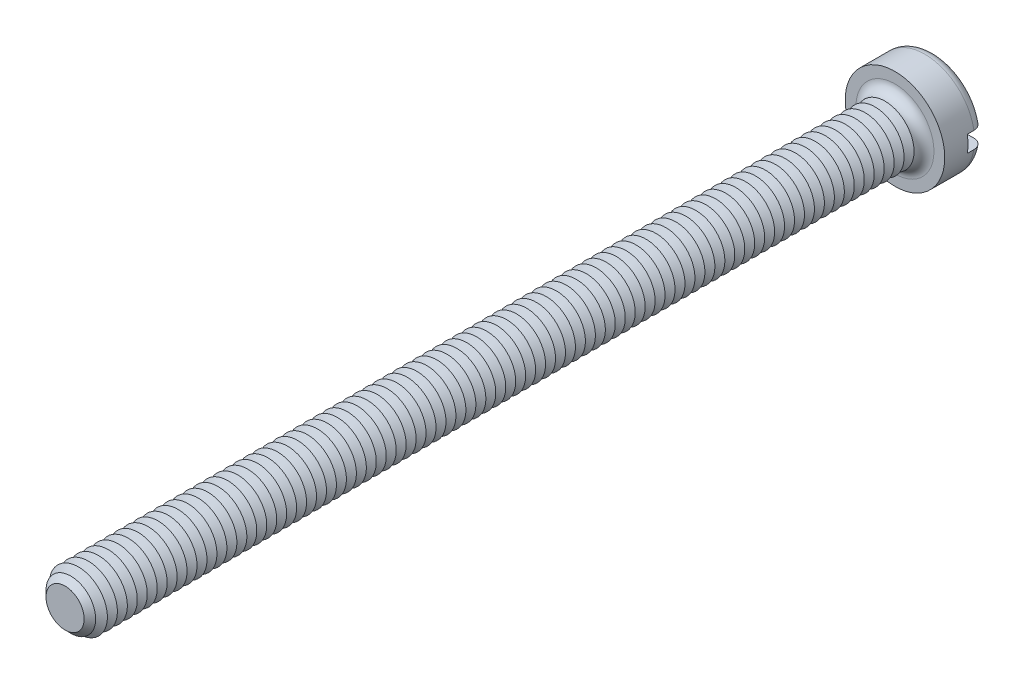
ISO-10303-21;
HEADER;
FILE_DESCRIPTION(('STEP AP214'),'2;1');
FILE_NAME('part.step','',(''),(''),'','','');
FILE_SCHEMA(('AUTOMOTIVE_DESIGN { 1 0 10303 214 1 1 1 1 }'));
ENDSEC;
DATA;
#1=APPLICATION_CONTEXT('core data for automotive mechanical design processes');
#2=APPLICATION_PROTOCOL_DEFINITION('international standard','automotive_design',2000,#1);
#3=PRODUCT_CONTEXT('',#1,'mechanical');
#4=PRODUCT('Part','Part','',(#3));
#5=PRODUCT_RELATED_PRODUCT_CATEGORY('part','',(#4));
#6=PRODUCT_DEFINITION_FORMATION('','',#4);
#7=PRODUCT_DEFINITION_CONTEXT('part definition',#1,'design');
#8=PRODUCT_DEFINITION('design','',#6,#7);
#9=PRODUCT_DEFINITION_SHAPE('','',#8);
#10=(LENGTH_UNIT() NAMED_UNIT(*) SI_UNIT(.MILLI.,.METRE.));
#11=(NAMED_UNIT(*) PLANE_ANGLE_UNIT() SI_UNIT($,.RADIAN.));
#12=(NAMED_UNIT(*) SI_UNIT($,.STERADIAN.) SOLID_ANGLE_UNIT());
#13=UNCERTAINTY_MEASURE_WITH_UNIT(LENGTH_MEASURE(1.E-05),#10,'distance_accuracy_value','');
#14=(GEOMETRIC_REPRESENTATION_CONTEXT(3) GLOBAL_UNCERTAINTY_ASSIGNED_CONTEXT((#13)) GLOBAL_UNIT_ASSIGNED_CONTEXT((#10,
#11,#12)) REPRESENTATION_CONTEXT('',''));
#15=CARTESIAN_POINT('',(0.,0.,0.));
#16=DIRECTION('',(0.,0.,1.));
#17=DIRECTION('',(1.,0.,0.));
#18=AXIS2_PLACEMENT_3D('',#15,#16,#17);
#19=CARTESIAN_POINT('',(0.,0.,-2.4));
#20=DIRECTION('',(0.,0.,1.));
#21=DIRECTION('',(1.,0.,0.));
#22=AXIS2_PLACEMENT_3D('',#19,#20,#21);
#23=PLANE('',#22);
#24=CARTESIAN_POINT('',(0.,0.,-2.4));
#25=DIRECTION('',(0.,0.,1.));
#26=DIRECTION('',(1.,0.,0.));
#27=AXIS2_PLACEMENT_3D('',#24,#25,#26);
#28=CIRCLE('',#27,2.4);
#29=CARTESIAN_POINT('',(-2.3473389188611,0.5,-2.4));
#30=VERTEX_POINT('',#29);
#31=CARTESIAN_POINT('',(2.3473389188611,0.5,-2.4));
#32=VERTEX_POINT('',#31);
#33=EDGE_CURVE('E116',#30,#32,#28,.F.);
#34=ORIENTED_EDGE('',*,*,#33,.T.);
#35=DIRECTION('',(1.,0.,0.));
#36=VECTOR('',#35,1.);
#37=CARTESIAN_POINT('',(-3.,0.5,-2.4));
#38=LINE('',#37,#36);
#39=EDGE_CURVE('E111',#30,#32,#38,.T.);
#40=ORIENTED_EDGE('',*,*,#39,.F.);
#41=EDGE_LOOP('',(#34,#40));
#42=FACE_BOUND('',#41,.T.);
#43=ADVANCED_FACE('F39',(#42),#23,.F.);
#44=CARTESIAN_POINT('',(0.,0.,-1.8));
#45=DIRECTION('',(0.,0.,1.));
#46=DIRECTION('',(1.,0.,0.));
#47=AXIS2_PLACEMENT_3D('',#44,#45,#46);
#48=TOROIDAL_SURFACE('',#47,2.4,0.6);
#49=CARTESIAN_POINT('',(-2.85761641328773,0.5,-2.13010535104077));
#50=CARTESIAN_POINT('',(-2.83871556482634,0.5,-2.1583605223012));
#51=CARTESIAN_POINT('',(-2.81738546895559,0.5,-2.18502342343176));
#52=CARTESIAN_POINT('',(-2.7705148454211,0.5,-2.23439244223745));
#53=CARTESIAN_POINT('',(-2.74496859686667,0.5,-2.25709309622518));
#54=CARTESIAN_POINT('',(-2.6904684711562,0.5,-2.29787524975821));
#55=CARTESIAN_POINT('',(-2.66151863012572,0.5,-2.3159621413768));
#56=CARTESIAN_POINT('',(-2.60103287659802,0.5,-2.34708203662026));
#57=CARTESIAN_POINT('',(-2.56949759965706,0.5,-2.36011627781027));
#58=CARTESIAN_POINT('',(-2.50430694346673,0.5,-2.38095952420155));
#59=CARTESIAN_POINT('',(-2.47062984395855,0.5,-2.38870056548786));
#60=CARTESIAN_POINT('',(-2.40245905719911,0.5,-2.39852415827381));
#61=CARTESIAN_POINT('',(-2.36796525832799,0.5,-2.40060593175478));
#62=CARTESIAN_POINT('',(-2.29850850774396,0.5,-2.39907718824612));
#63=CARTESIAN_POINT('',(-2.2635477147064,0.5,-2.3953679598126));
#64=CARTESIAN_POINT('',(-2.19472542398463,0.5,-2.38219781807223));
#65=CARTESIAN_POINT('',(-2.16086402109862,0.5,-2.37273641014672));
#66=CARTESIAN_POINT('',(-2.09483473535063,0.5,-2.3481926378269));
#67=CARTESIAN_POINT('',(-2.06268841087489,0.5,-2.3330521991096));
#68=CARTESIAN_POINT('',(-2.00140871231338,0.5,-2.29756210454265));
#69=CARTESIAN_POINT('',(-1.97227539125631,0.5,-2.27721235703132));
#70=CARTESIAN_POINT('',(-1.91805676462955,0.5,-2.23196210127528));
#71=CARTESIAN_POINT('',(-1.89294995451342,0.5,-2.20708739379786));
#72=CARTESIAN_POINT('',(-1.84740424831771,0.5,-2.1533758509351));
#73=CARTESIAN_POINT('',(-1.82696468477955,0.5,-2.12453958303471));
#74=CARTESIAN_POINT('',(-1.7919439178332,0.5,-2.06452274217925));
#75=CARTESIAN_POINT('',(-1.7772221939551,0.5,-2.03342424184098));
#76=CARTESIAN_POINT('',(-1.75343025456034,0.5,-1.96913621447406));
#77=CARTESIAN_POINT('',(-1.74435859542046,0.5,-1.93594722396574));
#78=CARTESIAN_POINT('',(-1.73243855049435,0.5,-1.86969199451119));
#79=CARTESIAN_POINT('',(-1.72938008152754,0.5,-1.83666346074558));
#80=CARTESIAN_POINT('',(-1.72896592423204,0.5,-1.77057287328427));
#81=CARTESIAN_POINT('',(-1.73160950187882,0.5,-1.73751082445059));
#82=CARTESIAN_POINT('',(-1.7423966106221,0.5,-1.67291835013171));
#83=CARTESIAN_POINT('',(-1.75043952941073,0.5,-1.64137102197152));
#84=CARTESIAN_POINT('',(-1.77163396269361,0.5,-1.58004446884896));
#85=CARTESIAN_POINT('',(-1.78478577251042,0.5,-1.55026534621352));
#86=CARTESIAN_POINT('',(-1.81598186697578,0.5,-1.49283859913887));
#87=CARTESIAN_POINT('',(-1.83409369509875,0.5,-1.46522772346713));
#88=CARTESIAN_POINT('',(-1.87455179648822,0.5,-1.41330756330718));
#89=CARTESIAN_POINT('',(-1.89689874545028,0.5,-1.38899880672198));
#90=CARTESIAN_POINT('',(-1.94600584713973,0.5,-1.34349499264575));
#91=CARTESIAN_POINT('',(-1.97289034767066,0.5,-1.32243411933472));
#92=CARTESIAN_POINT('',(-2.02972905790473,0.5,-1.28496935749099));
#93=CARTESIAN_POINT('',(-2.05968375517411,0.5,-1.26856621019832));
#94=CARTESIAN_POINT('',(-2.12276894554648,0.5,-1.24040709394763));
#95=CARTESIAN_POINT('',(-2.15596700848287,0.5,-1.22880230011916));
#96=CARTESIAN_POINT('',(-2.22383000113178,0.5,-1.21126311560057));
#97=CARTESIAN_POINT('',(-2.25849504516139,0.5,-1.20532916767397));
#98=CARTESIAN_POINT('',(-2.32870403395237,0.5,-1.1992792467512));
#99=CARTESIAN_POINT('',(-2.36425340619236,0.5,-1.19922586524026));
#100=CARTESIAN_POINT('',(-2.4348506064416,0.5,-1.2051326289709));
#101=CARTESIAN_POINT('',(-2.4698984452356,0.5,-1.21109264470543));
#102=CARTESIAN_POINT('',(-2.53821803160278,0.5,-1.22883658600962));
#103=CARTESIAN_POINT('',(-2.57150081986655,0.5,-1.24057794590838));
#104=CARTESIAN_POINT('',(-2.63557260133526,0.5,-1.2695744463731));
#105=CARTESIAN_POINT('',(-2.66636179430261,0.5,-1.28682914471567));
#106=CARTESIAN_POINT('',(-2.72402406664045,0.5,-1.32606063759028));
#107=CARTESIAN_POINT('',(-2.75095352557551,0.5,-1.34795455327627));
#108=CARTESIAN_POINT('',(-2.80067182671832,0.5,-1.39602603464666));
#109=CARTESIAN_POINT('',(-2.82346106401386,0.5,-1.42220319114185));
#110=CARTESIAN_POINT('',(-2.86383281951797,0.5,-1.47760238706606));
#111=CARTESIAN_POINT('',(-2.88149947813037,0.5,-1.50676312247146));
#112=CARTESIAN_POINT('',(-2.91160874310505,0.5,-1.56766595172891));
#113=CARTESIAN_POINT('',(-2.92405198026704,0.5,-1.59940773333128));
#114=CARTESIAN_POINT('',(-2.94319943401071,0.5,-1.66411282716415));
#115=CARTESIAN_POINT('',(-2.94997843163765,0.5,-1.69705402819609));
#116=CARTESIAN_POINT('',(-2.95787009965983,0.5,-1.7636173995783));
#117=CARTESIAN_POINT('',(-2.95898157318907,0.5,-1.79723971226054));
#118=CARTESIAN_POINT('',(-2.95551354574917,0.5,-1.86397776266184));
#119=CARTESIAN_POINT('',(-2.95096897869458,0.5,-1.89709534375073));
#120=CARTESIAN_POINT('',(-2.93638731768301,0.5,-1.96206785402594));
#121=CARTESIAN_POINT('',(-2.92635713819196,0.5,-1.99392431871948));
#122=CARTESIAN_POINT('',(-2.90618743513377,0.5,-2.04315073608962));
#123=CARTESIAN_POINT('',(-2.89769874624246,0.5,-2.06121519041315));
#124=CARTESIAN_POINT('',(-2.87895753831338,0.5,-2.096404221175));
#125=CARTESIAN_POINT('',(-2.86870503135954,0.5,-2.11352880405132));
#126=CARTESIAN_POINT('',(-2.85761641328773,0.5,-2.13010535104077));
#127=B_SPLINE_CURVE_WITH_KNOTS('',3,(#49,#50,#51,#52,#53,#54,#55,#56,#57,#58,#59,#60,#61,#62,
#63,#64,#65,#66,#67,#68,#69,#70,#71,#72,#73,#74,#75,#76,#77,#78,#79,#80,#81,#82,#83,#84,#85,#86,
#87,#88,#89,#90,#91,#92,#93,#94,#95,#96,#97,#98,#99,#100,#101,#102,#103,#104,#105,#106,#107,
#108,#109,#110,#111,#112,#113,#114,#115,#116,#117,#118,#119,#120,#121,#122,#123,#124,#125,#126),
.UNSPECIFIED.,.T.,.F.,(4,2,2,2,2,2,2,2,2,2,2,2,2,2,2,2,2,2,2,2,2,2,2,2,2,2,2,2,2,2,2,2,2,2,2,2,
2,2,4),(0.,0.101907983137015,0.203955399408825,0.305883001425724,0.407785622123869,
0.510973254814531,0.614175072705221,0.719155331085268,0.824144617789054,0.930238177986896,
1.03633360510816,1.14184204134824,1.24733537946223,1.35004136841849,1.45272110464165,
1.5517448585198,1.65075586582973,1.74797128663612,1.84519232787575,1.9438094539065,
2.0424423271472,2.14443321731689,2.24644032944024,2.35145317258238,2.45647421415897,
2.56261297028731,2.66874944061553,2.77411589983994,2.87947390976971,2.98308820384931,
3.08669260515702,3.18848388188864,3.29026286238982,3.39067588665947,3.49111011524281,
3.59092708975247,3.69061853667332,3.75040561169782,3.81019227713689),.UNSPECIFIED.);
#128=CARTESIAN_POINT('',(-2.95803989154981,0.5,-1.8));
#129=VERTEX_POINT('',#128);
#130=EDGE_CURVE('E841',#129,#30,#127,.T.);
#131=ORIENTED_EDGE('',*,*,#130,.F.);
#132=CARTESIAN_POINT('',(0.,0.,-1.8));
#133=DIRECTION('',(0.,0.,1.));
#134=DIRECTION('',(1.,0.,0.));
#135=AXIS2_PLACEMENT_3D('',#132,#133,#134);
#136=CIRCLE('',#135,3.);
#137=CARTESIAN_POINT('',(2.95803989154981,0.5,-1.8));
#138=VERTEX_POINT('',#137);
#139=EDGE_CURVE('E125',#138,#129,#136,.T.);
#140=ORIENTED_EDGE('',*,*,#139,.F.);
#141=CARTESIAN_POINT('',(1.78664846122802,0.5,-2.05158390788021));
#142=CARTESIAN_POINT('',(1.80142751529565,0.5,-2.08239430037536));
#143=CARTESIAN_POINT('',(1.81889355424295,0.5,-2.111949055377));
#144=CARTESIAN_POINT('',(1.8585933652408,0.5,-2.16770384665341));
#145=CARTESIAN_POINT('',(1.88083491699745,0.5,-2.19389829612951));
#146=CARTESIAN_POINT('',(1.92931942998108,0.5,-2.24217519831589));
#147=CARTESIAN_POINT('',(1.95555471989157,0.5,-2.26426535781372));
#148=CARTESIAN_POINT('',(2.01127789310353,0.5,-2.30384045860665));
#149=CARTESIAN_POINT('',(2.04076488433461,0.5,-2.32132665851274));
#150=CARTESIAN_POINT('',(2.10290022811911,0.5,-2.3516259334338));
#151=CARTESIAN_POINT('',(2.13560600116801,0.5,-2.3643213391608));
#152=CARTESIAN_POINT('',(2.20267136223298,0.5,-2.38412242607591));
#153=CARTESIAN_POINT('',(2.23703118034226,0.5,-2.3912273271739));
#154=CARTESIAN_POINT('',(2.30690186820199,0.5,-2.39969404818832));
#155=CARTESIAN_POINT('',(2.34242185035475,0.5,-2.40098100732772));
#156=CARTESIAN_POINT('',(2.41317063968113,0.5,-2.39753827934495));
#157=CARTESIAN_POINT('',(2.44839945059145,0.5,-2.39280866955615));
#158=CARTESIAN_POINT('',(2.51734146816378,0.5,-2.37746773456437));
#159=CARTESIAN_POINT('',(2.55106223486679,0.5,-2.3668904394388));
#160=CARTESIAN_POINT('',(2.61620389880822,0.5,-2.34013333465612));
#161=CARTESIAN_POINT('',(2.64762498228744,0.5,-2.32395397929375));
#162=CARTESIAN_POINT('',(2.70673284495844,0.5,-2.28672393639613));
#163=CARTESIAN_POINT('',(2.73447138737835,0.5,-2.26575544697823));
#164=CARTESIAN_POINT('',(2.78595339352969,0.5,-2.21938197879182));
#165=CARTESIAN_POINT('',(2.80969724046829,0.5,-2.19397742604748));
#166=CARTESIAN_POINT('',(2.85207235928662,0.5,-2.13993965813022));
#167=CARTESIAN_POINT('',(2.87078674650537,0.5,-2.11137160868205));
#168=CARTESIAN_POINT('',(2.90307455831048,0.5,-2.05146448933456));
#169=CARTESIAN_POINT('',(2.91664841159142,0.5,-2.02012565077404));
#170=CARTESIAN_POINT('',(2.93808283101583,0.5,-1.95603682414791));
#171=CARTESIAN_POINT('',(2.94602016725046,0.5,-1.92331249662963));
#172=CARTESIAN_POINT('',(2.95624273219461,0.5,-1.85699296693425));
#173=CARTESIAN_POINT('',(2.95852824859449,0.5,-1.82339780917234));
#174=CARTESIAN_POINT('',(2.95738171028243,0.5,-1.75655451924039));
#175=CARTESIAN_POINT('',(2.95399174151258,0.5,-1.72330565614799));
#176=CARTESIAN_POINT('',(2.94167749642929,0.5,-1.65784996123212));
#177=CARTESIAN_POINT('',(2.93275329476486,0.5,-1.62564311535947));
#178=CARTESIAN_POINT('',(2.90963870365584,0.5,-1.56317641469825));
#179=CARTESIAN_POINT('',(2.89544787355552,0.5,-1.53291672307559));
#180=CARTESIAN_POINT('',(2.86222325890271,0.5,-1.47518589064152));
#181=CARTESIAN_POINT('',(2.84318935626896,0.5,-1.44771481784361));
#182=CARTESIAN_POINT('',(2.80067851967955,0.5,-1.39611362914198));
#183=CARTESIAN_POINT('',(2.77716960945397,0.5,-1.37200986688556));
#184=CARTESIAN_POINT('',(2.72648704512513,0.5,-1.3280274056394));
#185=CARTESIAN_POINT('',(2.69931317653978,0.5,-1.3081489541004));
#186=CARTESIAN_POINT('',(2.64167967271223,0.5,-1.27288334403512));
#187=CARTESIAN_POINT('',(2.61118015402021,0.5,-1.25756138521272));
#188=CARTESIAN_POINT('',(2.54807315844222,0.5,-1.2321564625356));
#189=CARTESIAN_POINT('',(2.51546550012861,0.5,-1.22207395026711));
#190=CARTESIAN_POINT('',(2.44846246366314,0.5,-1.20724783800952));
#191=CARTESIAN_POINT('',(2.41404584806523,0.5,-1.2026002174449));
#192=CARTESIAN_POINT('',(2.34491756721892,0.5,-1.19904907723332));
#193=CARTESIAN_POINT('',(2.3102058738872,0.5,-1.20014611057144));
#194=CARTESIAN_POINT('',(2.24087507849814,0.5,-1.20808958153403));
#195=CARTESIAN_POINT('',(2.20626660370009,0.5,-1.21502895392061));
#196=CARTESIAN_POINT('',(2.13868705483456,0.5,-1.23457616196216));
#197=CARTESIAN_POINT('',(2.10571611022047,0.5,-1.24718444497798));
#198=CARTESIAN_POINT('',(2.04212010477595,0.5,-1.2778419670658));
#199=CARTESIAN_POINT('',(2.0115131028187,0.5,-1.29592871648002));
#200=CARTESIAN_POINT('',(1.95381117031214,0.5,-1.33703838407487));
#201=CARTESIAN_POINT('',(1.92671618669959,0.5,-1.36006122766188));
#202=CARTESIAN_POINT('',(1.8771749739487,0.5,-1.41014760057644));
#203=CARTESIAN_POINT('',(1.85467966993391,0.5,-1.43716252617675));
#204=CARTESIAN_POINT('',(1.8147167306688,0.5,-1.49468601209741));
#205=CARTESIAN_POINT('',(1.79724791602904,0.5,-1.52519375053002));
#206=CARTESIAN_POINT('',(1.76843420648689,0.5,-1.58782676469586));
#207=CARTESIAN_POINT('',(1.75691546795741,0.5,-1.61987202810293));
#208=CARTESIAN_POINT('',(1.73963101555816,0.5,-1.68548715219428));
#209=CARTESIAN_POINT('',(1.73386545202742,0.5,-1.71905705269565));
#210=CARTESIAN_POINT('',(1.72840927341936,0.5,-1.78556262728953));
#211=CARTESIAN_POINT('',(1.72852416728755,0.5,-1.8184825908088));
#212=CARTESIAN_POINT('',(1.73434422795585,0.5,-1.88379362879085));
#213=CARTESIAN_POINT('',(1.74004181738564,0.5,-1.91618535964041));
#214=CARTESIAN_POINT('',(1.75312909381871,0.5,-1.96568884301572));
#215=CARTESIAN_POINT('',(1.75869685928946,0.5,-1.98330302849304));
#216=CARTESIAN_POINT('',(1.77146455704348,0.5,-2.01792824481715));
#217=CARTESIAN_POINT('',(1.7786644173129,0.5,-2.03493930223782));
#218=CARTESIAN_POINT('',(1.78664846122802,0.5,-2.05158390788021));
#219=B_SPLINE_CURVE_WITH_KNOTS('',3,(#141,#142,#143,#144,#145,#146,#147,#148,#149,#150,#151,
#152,#153,#154,#155,#156,#157,#158,#159,#160,#161,#162,#163,#164,#165,#166,#167,#168,#169,#170,
#171,#172,#173,#174,#175,#176,#177,#178,#179,#180,#181,#182,#183,#184,#185,#186,#187,#188,#189,
#190,#191,#192,#193,#194,#195,#196,#197,#198,#199,#200,#201,#202,#203,#204,#205,#206,#207,#208,
#209,#210,#211,#212,#213,#214,#215,#216,#217,#218),.UNSPECIFIED.,.T.,.F.,(4,2,2,2,2,2,2,2,2,2,2,
2,2,2,2,2,2,2,2,2,2,2,2,2,2,2,2,2,2,2,2,2,2,2,2,2,2,2,4),(0.,0.10244464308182,0.205057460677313,
0.307475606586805,0.409865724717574,0.514628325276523,0.619405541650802,0.72552718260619,
0.831647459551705,0.937156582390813,1.04265715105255,1.1464674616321,1.25026780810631,
1.3522293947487,1.45418247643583,1.55471883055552,1.6552500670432,1.75503912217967,
1.8548268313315,1.95462289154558,2.05442138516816,2.15496174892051,2.25550799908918,
2.35743049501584,2.45936177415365,2.56306719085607,2.66678259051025,2.77217967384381,
2.87758507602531,2.98372914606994,3.08987161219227,3.19481457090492,3.29973288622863,
3.40138228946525,3.50303434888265,3.60132659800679,3.69948562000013,3.75483142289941,
3.8101747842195),.UNSPECIFIED.);
#220=EDGE_CURVE('E843',#32,#138,#219,.T.);
#221=ORIENTED_EDGE('',*,*,#220,.F.);
#222=ORIENTED_EDGE('',*,*,#33,.F.);
#223=EDGE_LOOP('',(#131,#140,#221,#222));
#224=FACE_BOUND('',#223,.T.);
#225=ADVANCED_FACE('F825',(#224),#48,.T.);
#226=CARTESIAN_POINT('',(0.,0.,-2.4));
#227=DIRECTION('',(0.,0.,1.));
#228=DIRECTION('',(1.,0.,0.));
#229=AXIS2_PLACEMENT_3D('',#226,#227,#228);
#230=CYLINDRICAL_SURFACE('',#229,3.);
#231=DIRECTION('',(0.,0.,1.));
#232=VECTOR('',#231,1.);
#233=CARTESIAN_POINT('',(2.95803989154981,0.5,-2.4));
#234=LINE('',#233,#232);
#235=CARTESIAN_POINT('',(2.95803989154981,0.5,-1.4));
#236=VERTEX_POINT('',#235);
#237=EDGE_CURVE('E859',#138,#236,#234,.T.);
#238=ORIENTED_EDGE('',*,*,#237,.F.);
#239=ORIENTED_EDGE('',*,*,#139,.T.);
#240=DIRECTION('',(0.,0.,1.));
#241=VECTOR('',#240,1.);
#242=CARTESIAN_POINT('',(-2.95803989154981,0.5,-2.4));
#243=LINE('',#242,#241);
#244=CARTESIAN_POINT('',(-2.95803989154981,0.5,-1.4));
#245=VERTEX_POINT('',#244);
#246=EDGE_CURVE('E63',#245,#129,#243,.F.);
#247=ORIENTED_EDGE('',*,*,#246,.F.);
#248=CARTESIAN_POINT('',(0.,0.,-1.4));
#249=DIRECTION('',(0.,0.,-1.));
#250=DIRECTION('',(-1.,0.,0.));
#251=AXIS2_PLACEMENT_3D('',#248,#249,#250);
#252=CIRCLE('',#251,3.);
#253=CARTESIAN_POINT('',(-2.95803989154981,-0.5,-1.4));
#254=VERTEX_POINT('',#253);
#255=EDGE_CURVE('E43',#245,#254,#252,.F.);
#256=ORIENTED_EDGE('',*,*,#255,.T.);
#257=DIRECTION('',(0.,0.,1.));
#258=VECTOR('',#257,1.);
#259=CARTESIAN_POINT('',(-2.95803989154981,-0.5,-2.4));
#260=LINE('',#259,#258);
#261=CARTESIAN_POINT('',(-2.9580398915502,-0.5,-1.79999999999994));
#262=VERTEX_POINT('',#261);
#263=EDGE_CURVE('E856',#262,#254,#260,.T.);
#264=ORIENTED_EDGE('',*,*,#263,.F.);
#265=CARTESIAN_POINT('',(2.95803989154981,-0.5,-1.8));
#266=VERTEX_POINT('',#265);
#267=EDGE_CURVE('E127',#262,#266,#136,.T.);
#268=ORIENTED_EDGE('',*,*,#267,.T.);
#269=DIRECTION('',(0.,0.,1.));
#270=VECTOR('',#269,1.);
#271=CARTESIAN_POINT('',(2.95803989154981,-0.5,-2.4));
#272=LINE('',#271,#270);
#273=CARTESIAN_POINT('',(2.95803989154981,-0.5,-1.4));
#274=VERTEX_POINT('',#273);
#275=EDGE_CURVE('E55',#274,#266,#272,.F.);
#276=ORIENTED_EDGE('',*,*,#275,.F.);
#277=EDGE_CURVE('E11',#274,#236,#252,.F.);
#278=ORIENTED_EDGE('',*,*,#277,.T.);
#279=EDGE_LOOP('',(#238,#239,#247,#256,#264,#268,#276,#278));
#280=FACE_BOUND('',#279,.T.);
#281=CARTESIAN_POINT('',(0.,0.,0.));
#282=DIRECTION('',(0.,0.,1.));
#283=DIRECTION('',(1.,0.,0.));
#284=AXIS2_PLACEMENT_3D('',#281,#282,#283);
#285=CIRCLE('',#284,3.);
#286=CARTESIAN_POINT('',(3.,0.,0.));
#287=VERTEX_POINT('',#286);
#288=EDGE_CURVE('E862',#287,#287,#285,.T.);
#289=ORIENTED_EDGE('',*,*,#288,.F.);
#290=EDGE_LOOP('',(#289));
#291=FACE_BOUND('',#290,.T.);
#292=ADVANCED_FACE('F821',(#280,#291),#230,.T.);
#293=CARTESIAN_POINT('',(2.3473389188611,-0.5,-2.4));
#294=VERTEX_POINT('',#293);
#295=CARTESIAN_POINT('',(-2.3473389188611,-0.5,-2.4));
#296=VERTEX_POINT('',#295);
#297=EDGE_CURVE('E109',#294,#296,#28,.F.);
#298=ORIENTED_EDGE('',*,*,#297,.T.);
#299=DIRECTION('',(-1.,0.,0.));
#300=VECTOR('',#299,1.);
#301=CARTESIAN_POINT('',(-3.,-0.5,-2.4));
#302=LINE('',#301,#300);
#303=EDGE_CURVE('E96',#294,#296,#302,.T.);
#304=ORIENTED_EDGE('',*,*,#303,.F.);
#305=EDGE_LOOP('',(#298,#304));
#306=FACE_BOUND('',#305,.T.);
#307=ADVANCED_FACE('F108',(#306),#23,.F.);
#308=CARTESIAN_POINT('',(0.,0.,0.));
#309=DIRECTION('',(0.,0.,1.));
#310=DIRECTION('',(1.,0.,0.));
#311=AXIS2_PLACEMENT_3D('',#308,#309,#310);
#312=PLANE('',#311);
#313=CARTESIAN_POINT('',(0.,0.,0.));
#314=DIRECTION('',(0.,0.,1.));
#315=DIRECTION('',(1.,0.,0.));
#316=AXIS2_PLACEMENT_3D('',#313,#314,#315);
#317=CIRCLE('',#316,2.35);
#318=CARTESIAN_POINT('',(2.35,0.,0.));
#319=VERTEX_POINT('',#318);
#320=EDGE_CURVE('E115',#319,#319,#317,.F.);
#321=ORIENTED_EDGE('',*,*,#320,.T.);
#322=EDGE_LOOP('',(#321));
#323=FACE_BOUND('',#322,.T.);
#324=ORIENTED_EDGE('',*,*,#288,.T.);
#325=EDGE_LOOP('',(#324));
#326=FACE_BOUND('',#325,.T.);
#327=ADVANCED_FACE('F820',(#323,#326),#312,.T.);
#328=CARTESIAN_POINT('',(-2.85761641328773,-0.5,-2.13010535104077));
#329=CARTESIAN_POINT('',(-2.87617085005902,-0.5,-2.10236255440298));
#330=CARTESIAN_POINT('',(-2.89241094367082,-0.5,-2.07304478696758));
#331=CARTESIAN_POINT('',(-2.91975805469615,-0.5,-2.01207835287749));
#332=CARTESIAN_POINT('',(-2.93085958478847,-0.5,-1.98042723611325));
#333=CARTESIAN_POINT('',(-2.94757590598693,-0.5,-1.91570997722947));
#334=CARTESIAN_POINT('',(-2.95319165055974,-0.5,-1.88264408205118));
#335=CARTESIAN_POINT('',(-2.95876526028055,-0.5,-1.81604673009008));
#336=CARTESIAN_POINT('',(-2.95872441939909,-0.5,-1.78251538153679));
#337=CARTESIAN_POINT('',(-2.95300126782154,-0.5,-1.71606888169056));
#338=CARTESIAN_POINT('',(-2.94734076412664,-0.5,-1.68315184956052));
#339=CARTESIAN_POINT('',(-2.93058183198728,-0.5,-1.61873244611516));
#340=CARTESIAN_POINT('',(-2.91948325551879,-0.5,-1.58723011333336));
#341=CARTESIAN_POINT('',(-2.89215903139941,-0.5,-1.52647404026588));
#342=CARTESIAN_POINT('',(-2.87592518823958,-0.5,-1.49722398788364));
#343=CARTESIAN_POINT('',(-2.83881787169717,-0.5,-1.44183365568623));
#344=CARTESIAN_POINT('',(-2.81794425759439,-0.5,-1.41569347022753));
#345=CARTESIAN_POINT('',(-2.77196258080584,-0.5,-1.36700890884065));
#346=CARTESIAN_POINT('',(-2.74681874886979,-0.5,-1.34449832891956));
#347=CARTESIAN_POINT('',(-2.69315595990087,-0.5,-1.30394571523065));
#348=CARTESIAN_POINT('',(-2.66463678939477,-0.5,-1.28590396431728));
#349=CARTESIAN_POINT('',(-2.6045885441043,-0.5,-1.25451133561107));
#350=CARTESIAN_POINT('',(-2.573021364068,-0.5,-1.24123336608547));
#351=CARTESIAN_POINT('',(-2.50813094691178,-0.5,-1.22006271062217));
#352=CARTESIAN_POINT('',(-2.47480755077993,-0.5,-1.21217051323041));
#353=CARTESIAN_POINT('',(-2.40672281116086,-0.5,-1.20185046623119));
#354=CARTESIAN_POINT('',(-2.37194646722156,-0.5,-1.19952155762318));
#355=CARTESIAN_POINT('',(-2.30248663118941,-0.5,-1.20064178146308));
#356=CARTESIAN_POINT('',(-2.26780314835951,-0.5,-1.20409147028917));
#357=CARTESIAN_POINT('',(-2.19896003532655,-0.5,-1.21674803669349));
#358=CARTESIAN_POINT('',(-2.16481620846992,-0.5,-1.22604100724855));
#359=CARTESIAN_POINT('',(-2.09855902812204,-0.5,-1.25020237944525));
#360=CARTESIAN_POINT('',(-2.0664458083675,-0.5,-1.2650711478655));
#361=CARTESIAN_POINT('',(-2.00504979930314,-0.5,-1.3000633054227));
#362=CARTESIAN_POINT('',(-1.97577870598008,-0.5,-1.32020724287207));
#363=CARTESIAN_POINT('',(-1.92109882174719,-0.5,-1.36519538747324));
#364=CARTESIAN_POINT('',(-1.89568984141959,-0.5,-1.39003936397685));
#365=CARTESIAN_POINT('',(-1.84992350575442,-0.5,-1.44333696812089));
#366=CARTESIAN_POINT('',(-1.82949305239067,-0.5,-1.47172774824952));
#367=CARTESIAN_POINT('',(-1.79388305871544,-0.5,-1.53163225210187));
#368=CARTESIAN_POINT('',(-1.77870235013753,-0.5,-1.56314527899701));
#369=CARTESIAN_POINT('',(-1.7545759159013,-0.5,-1.62726698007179));
#370=CARTESIAN_POINT('',(-1.74543784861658,-0.5,-1.65980327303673));
#371=CARTESIAN_POINT('',(-1.73294830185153,-0.5,-1.72596654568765));
#372=CARTESIAN_POINT('',(-1.72959555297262,-0.5,-1.7595932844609));
#373=CARTESIAN_POINT('',(-1.72881879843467,-0.5,-1.82588200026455));
#374=CARTESIAN_POINT('',(-1.73121660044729,-0.5,-1.85854202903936));
#375=CARTESIAN_POINT('',(-1.74148022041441,-0.5,-1.9229888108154));
#376=CARTESIAN_POINT('',(-1.74934586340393,-0.5,-1.95477559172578));
#377=CARTESIAN_POINT('',(-1.77023164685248,-0.5,-2.01650910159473));
#378=CARTESIAN_POINT('',(-1.78323812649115,-0.5,-2.04646046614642));
#379=CARTESIAN_POINT('',(-1.81396733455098,-0.5,-2.10383471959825));
#380=CARTESIAN_POINT('',(-1.83169061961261,-0.5,-2.13125730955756));
#381=CARTESIAN_POINT('',(-1.87183626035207,-0.5,-2.18359240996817));
#382=CARTESIAN_POINT('',(-1.89437158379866,-0.5,-2.20841820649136));
#383=CARTESIAN_POINT('',(-1.9431646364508,-0.5,-2.25409214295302));
#384=CARTESIAN_POINT('',(-1.96942301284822,-0.5,-2.27493958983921));
#385=CARTESIAN_POINT('',(-2.025898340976,-0.5,-2.31281042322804));
#386=CARTESIAN_POINT('',(-2.05622082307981,-0.5,-2.32967654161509));
#387=CARTESIAN_POINT('',(-2.11922391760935,-0.5,-2.35820255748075));
#388=CARTESIAN_POINT('',(-2.15190483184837,-0.5,-2.3698617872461));
#389=CARTESIAN_POINT('',(-2.21944675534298,-0.5,-2.38785911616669));
#390=CARTESIAN_POINT('',(-2.25433929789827,-0.5,-2.39407914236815));
#391=CARTESIAN_POINT('',(-2.32467357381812,-0.5,-2.40058243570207));
#392=CARTESIAN_POINT('',(-2.36011530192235,-0.5,-2.40086575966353));
#393=CARTESIAN_POINT('',(-2.43058129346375,-0.5,-2.39545061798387));
#394=CARTESIAN_POINT('',(-2.46560504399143,-0.5,-2.38974544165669));
#395=CARTESIAN_POINT('',(-2.53418188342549,-0.5,-2.37245602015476));
#396=CARTESIAN_POINT('',(-2.56773468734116,-0.5,-2.36087064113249));
#397=CARTESIAN_POINT('',(-2.63195003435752,-0.5,-2.33229154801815));
#398=CARTESIAN_POINT('',(-2.66264330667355,-0.5,-2.31536681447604));
#399=CARTESIAN_POINT('',(-2.72065333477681,-0.5,-2.2765252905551));
#400=CARTESIAN_POINT('',(-2.7479744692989,-0.5,-2.25461508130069));
#401=CARTESIAN_POINT('',(-2.78903570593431,-0.5,-2.21539504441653));
#402=CARTESIAN_POINT('',(-2.80405150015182,-0.5,-2.19939833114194));
#403=CARTESIAN_POINT('',(-2.83224965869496,-0.5,-2.16586257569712));
#404=CARTESIAN_POINT('',(-2.84543204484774,-0.5,-2.14832355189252));
#405=CARTESIAN_POINT('',(-2.85761641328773,-0.5,-2.13010535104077));
#406=B_SPLINE_CURVE_WITH_KNOTS('',3,(#328,#329,#330,#331,#332,#333,#334,#335,#336,#337,#338,
#339,#340,#341,#342,#343,#344,#345,#346,#347,#348,#349,#350,#351,#352,#353,#354,#355,#356,#357,
#358,#359,#360,#361,#362,#363,#364,#365,#366,#367,#368,#369,#370,#371,#372,#373,#374,#375,#376,
#377,#378,#379,#380,#381,#382,#383,#384,#385,#386,#387,#388,#389,#390,#391,#392,#393,#394,#395,
#396,#397,#398,#399,#400,#401,#402,#403,#404,#405),.UNSPECIFIED.,.T.,.F.,(4,2,2,2,2,2,2,2,2,2,2,
2,2,2,2,2,2,2,2,2,2,2,2,2,2,2,2,2,2,2,2,2,2,2,2,2,2,2,4),(0.,0.100047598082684,
0.200201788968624,0.300338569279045,0.400452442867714,0.500179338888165,0.599908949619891,
0.699798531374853,0.799691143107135,0.900465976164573,1.00124718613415,1.10351091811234,
1.20578392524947,1.30986270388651,1.41395150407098,1.51961105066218,1.62527754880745,
1.73136193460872,1.83744111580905,1.94185359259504,2.04624281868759,2.1471248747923,
2.24798479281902,2.34575994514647,2.44353196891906,2.541045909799,2.63857136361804,
2.73870431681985,2.83885469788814,2.94247024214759,3.0460990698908,3.15192527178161,
3.25775046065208,3.36369436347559,3.46965870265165,3.57430655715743,3.67881706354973,
3.74451732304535,3.81021680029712),.UNSPECIFIED.);
#407=EDGE_CURVE('E103',#296,#262,#406,.T.);
#408=ORIENTED_EDGE('',*,*,#407,.F.);
#409=ORIENTED_EDGE('',*,*,#297,.F.);
#410=CARTESIAN_POINT('',(1.78664846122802,-0.5,-2.05158390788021));
#411=CARTESIAN_POINT('',(1.77253256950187,-0.5,-2.02214917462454));
#412=CARTESIAN_POINT('',(1.76084795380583,-0.5,-1.99152692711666));
#413=CARTESIAN_POINT('',(1.74276267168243,-0.5,-1.92873811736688));
#414=CARTESIAN_POINT('',(1.73636622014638,-0.5,-1.89657034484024));
#415=CARTESIAN_POINT('',(1.72910271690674,-0.5,-1.83160458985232));
#416=CARTESIAN_POINT('',(1.72823699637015,-0.5,-1.79880645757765));
#417=CARTESIAN_POINT('',(1.73207277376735,-0.5,-1.73354460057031));
#418=CARTESIAN_POINT('',(1.7367732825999,-0.5,-1.70108081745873));
#419=CARTESIAN_POINT('',(1.75151033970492,-0.5,-1.63763571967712));
#420=CARTESIAN_POINT('',(1.76150868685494,-0.5,-1.60664550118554));
#421=CARTESIAN_POINT('',(1.78646773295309,-0.5,-1.54673433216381));
#422=CARTESIAN_POINT('',(1.80142897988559,-0.5,-1.51781361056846));
#423=CARTESIAN_POINT('',(1.8361687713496,-0.5,-1.46223275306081));
#424=CARTESIAN_POINT('',(1.85603637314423,-0.5,-1.43562834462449));
#425=CARTESIAN_POINT('',(1.89981598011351,-0.5,-1.38598822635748));
#426=CARTESIAN_POINT('',(1.92372865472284,-0.5,-1.3629531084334));
#427=CARTESIAN_POINT('',(1.97581791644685,-0.5,-1.32025912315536));
#428=CARTESIAN_POINT('',(2.00411431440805,-0.5,-1.30074638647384));
#429=CARTESIAN_POINT('',(2.06351340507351,-0.5,-1.26660223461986));
#430=CARTESIAN_POINT('',(2.09461651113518,-0.5,-1.2519715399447));
#431=CARTESIAN_POINT('',(2.15964055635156,-0.5,-1.22763649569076));
#432=CARTESIAN_POINT('',(2.19361437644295,-0.5,-1.21807321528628));
#433=CARTESIAN_POINT('',(2.26268197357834,-0.5,-1.20474094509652));
#434=CARTESIAN_POINT('',(2.29777581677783,-0.5,-1.20097229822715));
#435=CARTESIAN_POINT('',(2.36834397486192,-0.5,-1.19935270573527));
#436=CARTESIAN_POINT('',(2.40381924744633,-0.5,-1.20154258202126));
#437=CARTESIAN_POINT('',(2.47388621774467,-0.5,-1.211906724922));
#438=CARTESIAN_POINT('',(2.50847794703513,-0.5,-1.22008077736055));
#439=CARTESIAN_POINT('',(2.57542869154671,-0.5,-1.24211740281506));
#440=CARTESIAN_POINT('',(2.60780612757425,-0.5,-1.25592395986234));
#441=CARTESIAN_POINT('',(2.66972487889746,-0.5,-1.28886991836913));
#442=CARTESIAN_POINT('',(2.69926644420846,-0.5,-1.3080088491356));
#443=CARTESIAN_POINT('',(2.75412764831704,-0.5,-1.35072337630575));
#444=CARTESIAN_POINT('',(2.77951140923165,-0.5,-1.37421661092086));
#445=CARTESIAN_POINT('',(2.82588981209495,-0.5,-1.42519687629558));
#446=CARTESIAN_POINT('',(2.84688487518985,-0.5,-1.4526835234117));
#447=CARTESIAN_POINT('',(2.88351678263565,-0.5,-1.51036368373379));
#448=CARTESIAN_POINT('',(2.89923879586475,-0.5,-1.54050312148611));
#449=CARTESIAN_POINT('',(2.92532780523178,-0.5,-1.60301687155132));
#450=CARTESIAN_POINT('',(2.93569520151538,-0.5,-1.63539101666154));
#451=CARTESIAN_POINT('',(2.95066155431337,-0.5,-1.70102985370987));
#452=CARTESIAN_POINT('',(2.95532930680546,-0.5,-1.73427887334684));
#453=CARTESIAN_POINT('',(2.9589838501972,-0.5,-1.80108716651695));
#454=CARTESIAN_POINT('',(2.95797087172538,-0.5,-1.83464642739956));
#455=CARTESIAN_POINT('',(2.9503157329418,-0.5,-1.90093629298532));
#456=CARTESIAN_POINT('',(2.9437032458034,-0.5,-1.93367033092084));
#457=CARTESIAN_POINT('',(2.92508830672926,-0.5,-1.99756717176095));
#458=CARTESIAN_POINT('',(2.91308586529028,-0.5,-2.02872997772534));
#459=CARTESIAN_POINT('',(2.88401713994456,-0.5,-2.08868263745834));
#460=CARTESIAN_POINT('',(2.86693946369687,-0.5,-2.11746696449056));
#461=CARTESIAN_POINT('',(2.82823635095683,-0.5,-2.17179415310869));
#462=CARTESIAN_POINT('',(2.80661076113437,-0.5,-2.19733690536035));
#463=CARTESIAN_POINT('',(2.75921750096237,-0.5,-2.24472182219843));
#464=CARTESIAN_POINT('',(2.73341278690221,-0.5,-2.26652692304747));
#465=CARTESIAN_POINT('',(2.67855512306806,-0.5,-2.30557116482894));
#466=CARTESIAN_POINT('',(2.64950194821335,-0.5,-2.32280998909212));
#467=CARTESIAN_POINT('',(2.58850670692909,-0.5,-2.35251615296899));
#468=CARTESIAN_POINT('',(2.55652763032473,-0.5,-2.36490748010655));
#469=CARTESIAN_POINT('',(2.4909651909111,-0.5,-2.38424946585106));
#470=CARTESIAN_POINT('',(2.45738167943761,-0.5,-2.39119961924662));
#471=CARTESIAN_POINT('',(2.38892891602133,-0.5,-2.39958830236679));
#472=CARTESIAN_POINT('',(2.35404742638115,-0.5,-2.40092701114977));
#473=CARTESIAN_POINT('',(2.28454389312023,-0.5,-2.39781917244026));
#474=CARTESIAN_POINT('',(2.24992186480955,-0.5,-2.39337228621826));
#475=CARTESIAN_POINT('',(2.18139250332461,-0.5,-2.37872879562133));
#476=CARTESIAN_POINT('',(2.14750264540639,-0.5,-2.36845030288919));
#477=CARTESIAN_POINT('',(2.08190943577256,-0.5,-2.34236291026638));
#478=CARTESIAN_POINT('',(2.05020675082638,-0.5,-2.32655233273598));
#479=CARTESIAN_POINT('',(1.98982495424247,-0.5,-2.28976285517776));
#480=CARTESIAN_POINT('',(1.96115527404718,-0.5,-2.26876847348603));
#481=CARTESIAN_POINT('',(1.90785147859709,-0.5,-2.22220002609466));
#482=CARTESIAN_POINT('',(1.88321231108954,-0.5,-2.19663177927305));
#483=CARTESIAN_POINT('',(1.84638483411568,-0.5,-2.15106161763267));
#484=CARTESIAN_POINT('',(1.8328227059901,-0.5,-2.13215328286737));
#485=CARTESIAN_POINT('',(1.80797918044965,-0.5,-2.09289185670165));
#486=CARTESIAN_POINT('',(1.79669771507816,-0.5,-2.07253880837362));
#487=CARTESIAN_POINT('',(1.78664846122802,-0.5,-2.05158390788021));
#488=B_SPLINE_CURVE_WITH_KNOTS('',3,(#410,#411,#412,#413,#414,#415,#416,#417,#418,#419,#420,
#421,#422,#423,#424,#425,#426,#427,#428,#429,#430,#431,#432,#433,#434,#435,#436,#437,#438,#439,
#440,#441,#442,#443,#444,#445,#446,#447,#448,#449,#450,#451,#452,#453,#454,#455,#456,#457,#458,
#459,#460,#461,#462,#463,#464,#465,#466,#467,#468,#469,#470,#471,#472,#473,#474,#475,#476,#477,
#478,#479,#480,#481,#482,#483,#484,#485,#486,#487),.UNSPECIFIED.,.T.,.F.,(4,2,2,2,2,2,2,2,2,2,2,
2,2,2,2,2,2,2,2,2,2,2,2,2,2,2,2,2,2,2,2,2,2,2,2,2,2,2,4),(0.,0.0978512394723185,0.19578039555,
0.293733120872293,0.391668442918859,0.488907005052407,0.58615630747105,0.685320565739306,
0.784501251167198,0.887148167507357,0.989810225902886,1.09519726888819,1.20059054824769,
1.30670769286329,1.41282103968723,1.51790384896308,1.62297738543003,1.72623563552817,
1.82948397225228,1.93097382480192,2.03245609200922,2.13270093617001,2.23294171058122,
2.33265458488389,2.43236726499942,2.53230548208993,2.63224706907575,2.73312861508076,
2.83401715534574,2.93642973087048,3.03885181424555,3.14308833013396,3.24733094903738,
3.35307493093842,3.45885100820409,3.56494689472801,3.67090875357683,3.74057217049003,
3.81023351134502),.UNSPECIFIED.);
#489=EDGE_CURVE('E92',#266,#294,#488,.T.);
#490=ORIENTED_EDGE('',*,*,#489,.F.);
#491=ORIENTED_EDGE('',*,*,#267,.F.);
#492=EDGE_LOOP('',(#408,#409,#490,#491));
#493=FACE_BOUND('',#492,.T.);
#494=ADVANCED_FACE('F113',(#493),#48,.T.);
#495=CARTESIAN_POINT('',(0.,0.,0.600000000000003));
#496=DIRECTION('',(0.,0.,1.));
#497=DIRECTION('',(1.,0.,0.));
#498=AXIS2_PLACEMENT_3D('',#495,#496,#497);
#499=TOROIDAL_SURFACE('',#498,2.35,0.6);
#500=ORIENTED_EDGE('',*,*,#320,.F.);
#501=EDGE_LOOP('',(#500));
#502=FACE_BOUND('',#501,.T.);
#503=CARTESIAN_POINT('',(0.,0.,0.600000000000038));
#504=DIRECTION('',(0.,0.,-1.));
#505=DIRECTION('',(-1.,0.,0.));
#506=AXIS2_PLACEMENT_3D('',#503,#504,#505);
#507=CIRCLE('',#506,1.75);
#508=CARTESIAN_POINT('',(-1.75,0.,0.600000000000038));
#509=VERTEX_POINT('',#508);
#510=EDGE_CURVE('E866',#509,#509,#507,.T.);
#511=ORIENTED_EDGE('',*,*,#510,.T.);
#512=EDGE_LOOP('',(#511));
#513=FACE_BOUND('',#512,.T.);
#514=ADVANCED_FACE('F813',(#502,#513),#499,.F.);
#515=CARTESIAN_POINT('',(0.,0.,0.900000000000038));
#516=DIRECTION('',(0.,0.,-1.));
#517=DIRECTION('',(-1.,0.,0.));
#518=AXIS2_PLACEMENT_3D('',#515,#516,#517);
#519=CONICAL_SURFACE('',#518,1.23038475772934,1.0471975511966);
#520=ORIENTED_EDGE('',*,*,#510,.F.);
#521=EDGE_LOOP('',(#520));
#522=FACE_BOUND('',#521,.T.);
#523=CARTESIAN_POINT('',(0.,0.,0.900000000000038));
#524=DIRECTION('',(0.,0.,-1.));
#525=DIRECTION('',(-1.,0.,0.));
#526=AXIS2_PLACEMENT_3D('',#523,#524,#525);
#527=CIRCLE('',#526,1.23038475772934);
#528=CARTESIAN_POINT('',(-1.23038475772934,0.,0.900000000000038));
#529=VERTEX_POINT('',#528);
#530=EDGE_CURVE('E871',#529,#529,#527,.T.);
#531=ORIENTED_EDGE('',*,*,#530,.T.);
#532=EDGE_LOOP('',(#531));
#533=FACE_BOUND('',#532,.T.);
#534=ADVANCED_FACE('F809',(#522,#533),#519,.T.);
#535=CARTESIAN_POINT('',(0.,0.,1.20000000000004));
#536=DIRECTION('',(0.,0.,1.));
#537=DIRECTION('',(1.,0.,0.));
#538=AXIS2_PLACEMENT_3D('',#535,#536,#537);
#539=CONICAL_SURFACE('',#538,1.75,1.0471975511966);
#540=ORIENTED_EDGE('',*,*,#530,.F.);
#541=EDGE_LOOP('',(#540));
#542=FACE_BOUND('',#541,.T.);
#543=CARTESIAN_POINT('',(0.,0.,1.20000000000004));
#544=DIRECTION('',(0.,0.,-1.));
#545=DIRECTION('',(-1.,0.,0.));
#546=AXIS2_PLACEMENT_3D('',#543,#544,#545);
#547=CIRCLE('',#546,1.75);
#548=CARTESIAN_POINT('',(-1.75,0.,1.20000000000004));
#549=VERTEX_POINT('',#548);
#550=EDGE_CURVE('E877',#549,#549,#547,.T.);
#551=ORIENTED_EDGE('',*,*,#550,.T.);
#552=EDGE_LOOP('',(#551));
#553=FACE_BOUND('',#552,.T.);
#554=ADVANCED_FACE('F805',(#542,#553),#539,.T.);
#555=CARTESIAN_POINT('',(0.,0.,1.50000000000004));
#556=DIRECTION('',(0.,0.,-1.));
#557=DIRECTION('',(-1.,0.,0.));
#558=AXIS2_PLACEMENT_3D('',#555,#556,#557);
#559=CONICAL_SURFACE('',#558,1.23038475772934,1.0471975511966);
#560=ORIENTED_EDGE('',*,*,#550,.F.);
#561=EDGE_LOOP('',(#560));
#562=FACE_BOUND('',#561,.T.);
#563=CARTESIAN_POINT('',(0.,0.,1.50000000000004));
#564=DIRECTION('',(0.,0.,-1.));
#565=DIRECTION('',(-1.,0.,0.));
#566=AXIS2_PLACEMENT_3D('',#563,#564,#565);
#567=CIRCLE('',#566,1.23038475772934);
#568=CARTESIAN_POINT('',(-1.23038475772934,0.,1.50000000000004));
#569=VERTEX_POINT('',#568);
#570=EDGE_CURVE('E881',#569,#569,#567,.T.);
#571=ORIENTED_EDGE('',*,*,#570,.T.);
#572=EDGE_LOOP('',(#571));
#573=FACE_BOUND('',#572,.T.);
#574=ADVANCED_FACE('F801',(#562,#573),#559,.T.);
#575=CARTESIAN_POINT('',(0.,0.,1.80000000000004));
#576=DIRECTION('',(0.,0.,1.));
#577=DIRECTION('',(1.,0.,0.));
#578=AXIS2_PLACEMENT_3D('',#575,#576,#577);
#579=CONICAL_SURFACE('',#578,1.75,1.0471975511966);
#580=ORIENTED_EDGE('',*,*,#570,.F.);
#581=EDGE_LOOP('',(#580));
#582=FACE_BOUND('',#581,.T.);
#583=CARTESIAN_POINT('',(0.,0.,1.80000000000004));
#584=DIRECTION('',(0.,0.,-1.));
#585=DIRECTION('',(-1.,0.,0.));
#586=AXIS2_PLACEMENT_3D('',#583,#584,#585);
#587=CIRCLE('',#586,1.75);
#588=CARTESIAN_POINT('',(-1.75,0.,1.80000000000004));
#589=VERTEX_POINT('',#588);
#590=EDGE_CURVE('E885',#589,#589,#587,.T.);
#591=ORIENTED_EDGE('',*,*,#590,.T.);
#592=EDGE_LOOP('',(#591));
#593=FACE_BOUND('',#592,.T.);
#594=ADVANCED_FACE('F797',(#582,#593),#579,.T.);
#595=CARTESIAN_POINT('',(0.,0.,2.10000000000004));
#596=DIRECTION('',(0.,0.,-1.));
#597=DIRECTION('',(-1.,0.,0.));
#598=AXIS2_PLACEMENT_3D('',#595,#596,#597);
#599=CONICAL_SURFACE('',#598,1.23038475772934,1.0471975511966);
#600=ORIENTED_EDGE('',*,*,#590,.F.);
#601=EDGE_LOOP('',(#600));
#602=FACE_BOUND('',#601,.T.);
#603=CARTESIAN_POINT('',(0.,0.,2.10000000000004));
#604=DIRECTION('',(0.,0.,-1.));
#605=DIRECTION('',(-1.,0.,0.));
#606=AXIS2_PLACEMENT_3D('',#603,#604,#605);
#607=CIRCLE('',#606,1.23038475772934);
#608=CARTESIAN_POINT('',(-1.23038475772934,0.,2.10000000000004));
#609=VERTEX_POINT('',#608);
#610=EDGE_CURVE('E889',#609,#609,#607,.T.);
#611=ORIENTED_EDGE('',*,*,#610,.T.);
#612=EDGE_LOOP('',(#611));
#613=FACE_BOUND('',#612,.T.);
#614=ADVANCED_FACE('F793',(#602,#613),#599,.T.);
#615=CARTESIAN_POINT('',(0.,0.,2.40000000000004));
#616=DIRECTION('',(0.,0.,1.));
#617=DIRECTION('',(1.,0.,0.));
#618=AXIS2_PLACEMENT_3D('',#615,#616,#617);
#619=CONICAL_SURFACE('',#618,1.75,1.0471975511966);
#620=ORIENTED_EDGE('',*,*,#610,.F.);
#621=EDGE_LOOP('',(#620));
#622=FACE_BOUND('',#621,.T.);
#623=CARTESIAN_POINT('',(0.,0.,2.40000000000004));
#624=DIRECTION('',(0.,0.,-1.));
#625=DIRECTION('',(-1.,0.,0.));
#626=AXIS2_PLACEMENT_3D('',#623,#624,#625);
#627=CIRCLE('',#626,1.75);
#628=CARTESIAN_POINT('',(-1.75,0.,2.40000000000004));
#629=VERTEX_POINT('',#628);
#630=EDGE_CURVE('E893',#629,#629,#627,.T.);
#631=ORIENTED_EDGE('',*,*,#630,.T.);
#632=EDGE_LOOP('',(#631));
#633=FACE_BOUND('',#632,.T.);
#634=ADVANCED_FACE('F789',(#622,#633),#619,.T.);
#635=CARTESIAN_POINT('',(0.,0.,2.70000000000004));
#636=DIRECTION('',(0.,0.,-1.));
#637=DIRECTION('',(-1.,0.,0.));
#638=AXIS2_PLACEMENT_3D('',#635,#636,#637);
#639=CONICAL_SURFACE('',#638,1.23038475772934,1.0471975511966);
#640=ORIENTED_EDGE('',*,*,#630,.F.);
#641=EDGE_LOOP('',(#640));
#642=FACE_BOUND('',#641,.T.);
#643=CARTESIAN_POINT('',(0.,0.,2.70000000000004));
#644=DIRECTION('',(0.,0.,-1.));
#645=DIRECTION('',(-1.,0.,0.));
#646=AXIS2_PLACEMENT_3D('',#643,#644,#645);
#647=CIRCLE('',#646,1.23038475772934);
#648=CARTESIAN_POINT('',(-1.23038475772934,0.,2.70000000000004));
#649=VERTEX_POINT('',#648);
#650=EDGE_CURVE('E896',#649,#649,#647,.T.);
#651=ORIENTED_EDGE('',*,*,#650,.T.);
#652=EDGE_LOOP('',(#651));
#653=FACE_BOUND('',#652,.T.);
#654=ADVANCED_FACE('F785',(#642,#653),#639,.T.);
#655=CARTESIAN_POINT('',(0.,0.,3.00000000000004));
#656=DIRECTION('',(0.,0.,1.));
#657=DIRECTION('',(1.,0.,0.));
#658=AXIS2_PLACEMENT_3D('',#655,#656,#657);
#659=CONICAL_SURFACE('',#658,1.75,1.0471975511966);
#660=ORIENTED_EDGE('',*,*,#650,.F.);
#661=EDGE_LOOP('',(#660));
#662=FACE_BOUND('',#661,.T.);
#663=CARTESIAN_POINT('',(0.,0.,3.00000000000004));
#664=DIRECTION('',(0.,0.,-1.));
#665=DIRECTION('',(-1.,0.,0.));
#666=AXIS2_PLACEMENT_3D('',#663,#664,#665);
#667=CIRCLE('',#666,1.75);
#668=CARTESIAN_POINT('',(-1.75,0.,3.00000000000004));
#669=VERTEX_POINT('',#668);
#670=EDGE_CURVE('E900',#669,#669,#667,.T.);
#671=ORIENTED_EDGE('',*,*,#670,.T.);
#672=EDGE_LOOP('',(#671));
#673=FACE_BOUND('',#672,.T.);
#674=ADVANCED_FACE('F781',(#662,#673),#659,.T.);
#675=CARTESIAN_POINT('',(0.,0.,3.30000000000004));
#676=DIRECTION('',(0.,0.,-1.));
#677=DIRECTION('',(-1.,0.,0.));
#678=AXIS2_PLACEMENT_3D('',#675,#676,#677);
#679=CONICAL_SURFACE('',#678,1.23038475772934,1.0471975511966);
#680=ORIENTED_EDGE('',*,*,#670,.F.);
#681=EDGE_LOOP('',(#680));
#682=FACE_BOUND('',#681,.T.);
#683=CARTESIAN_POINT('',(0.,0.,3.30000000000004));
#684=DIRECTION('',(0.,0.,-1.));
#685=DIRECTION('',(-1.,0.,0.));
#686=AXIS2_PLACEMENT_3D('',#683,#684,#685);
#687=CIRCLE('',#686,1.23038475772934);
#688=CARTESIAN_POINT('',(-1.23038475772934,0.,3.30000000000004));
#689=VERTEX_POINT('',#688);
#690=EDGE_CURVE('E904',#689,#689,#687,.T.);
#691=ORIENTED_EDGE('',*,*,#690,.T.);
#692=EDGE_LOOP('',(#691));
#693=FACE_BOUND('',#692,.T.);
#694=ADVANCED_FACE('F777',(#682,#693),#679,.T.);
#695=CARTESIAN_POINT('',(0.,0.,3.60000000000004));
#696=DIRECTION('',(0.,0.,1.));
#697=DIRECTION('',(1.,0.,0.));
#698=AXIS2_PLACEMENT_3D('',#695,#696,#697);
#699=CONICAL_SURFACE('',#698,1.75,1.0471975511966);
#700=ORIENTED_EDGE('',*,*,#690,.F.);
#701=EDGE_LOOP('',(#700));
#702=FACE_BOUND('',#701,.T.);
#703=CARTESIAN_POINT('',(0.,0.,3.60000000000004));
#704=DIRECTION('',(0.,0.,-1.));
#705=DIRECTION('',(-1.,0.,0.));
#706=AXIS2_PLACEMENT_3D('',#703,#704,#705);
#707=CIRCLE('',#706,1.75);
#708=CARTESIAN_POINT('',(-1.75,0.,3.60000000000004));
#709=VERTEX_POINT('',#708);
#710=EDGE_CURVE('E908',#709,#709,#707,.T.);
#711=ORIENTED_EDGE('',*,*,#710,.T.);
#712=EDGE_LOOP('',(#711));
#713=FACE_BOUND('',#712,.T.);
#714=ADVANCED_FACE('F773',(#702,#713),#699,.T.);
#715=CARTESIAN_POINT('',(0.,0.,3.90000000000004));
#716=DIRECTION('',(0.,0.,-1.));
#717=DIRECTION('',(-1.,0.,0.));
#718=AXIS2_PLACEMENT_3D('',#715,#716,#717);
#719=CONICAL_SURFACE('',#718,1.23038475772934,1.0471975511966);
#720=ORIENTED_EDGE('',*,*,#710,.F.);
#721=EDGE_LOOP('',(#720));
#722=FACE_BOUND('',#721,.T.);
#723=CARTESIAN_POINT('',(0.,0.,3.90000000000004));
#724=DIRECTION('',(0.,0.,-1.));
#725=DIRECTION('',(-1.,0.,0.));
#726=AXIS2_PLACEMENT_3D('',#723,#724,#725);
#727=CIRCLE('',#726,1.23038475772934);
#728=CARTESIAN_POINT('',(-1.23038475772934,0.,3.90000000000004));
#729=VERTEX_POINT('',#728);
#730=EDGE_CURVE('E912',#729,#729,#727,.T.);
#731=ORIENTED_EDGE('',*,*,#730,.T.);
#732=EDGE_LOOP('',(#731));
#733=FACE_BOUND('',#732,.T.);
#734=ADVANCED_FACE('F769',(#722,#733),#719,.T.);
#735=CARTESIAN_POINT('',(0.,0.,4.20000000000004));
#736=DIRECTION('',(0.,0.,1.));
#737=DIRECTION('',(1.,0.,0.));
#738=AXIS2_PLACEMENT_3D('',#735,#736,#737);
#739=CONICAL_SURFACE('',#738,1.75,1.0471975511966);
#740=ORIENTED_EDGE('',*,*,#730,.F.);
#741=EDGE_LOOP('',(#740));
#742=FACE_BOUND('',#741,.T.);
#743=CARTESIAN_POINT('',(0.,0.,4.20000000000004));
#744=DIRECTION('',(0.,0.,-1.));
#745=DIRECTION('',(-1.,0.,0.));
#746=AXIS2_PLACEMENT_3D('',#743,#744,#745);
#747=CIRCLE('',#746,1.75);
#748=CARTESIAN_POINT('',(-1.75,0.,4.20000000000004));
#749=VERTEX_POINT('',#748);
#750=EDGE_CURVE('E916',#749,#749,#747,.T.);
#751=ORIENTED_EDGE('',*,*,#750,.T.);
#752=EDGE_LOOP('',(#751));
#753=FACE_BOUND('',#752,.T.);
#754=ADVANCED_FACE('F765',(#742,#753),#739,.T.);
#755=CARTESIAN_POINT('',(0.,0.,4.50000000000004));
#756=DIRECTION('',(0.,0.,-1.));
#757=DIRECTION('',(-1.,0.,0.));
#758=AXIS2_PLACEMENT_3D('',#755,#756,#757);
#759=CONICAL_SURFACE('',#758,1.23038475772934,1.0471975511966);
#760=ORIENTED_EDGE('',*,*,#750,.F.);
#761=EDGE_LOOP('',(#760));
#762=FACE_BOUND('',#761,.T.);
#763=CARTESIAN_POINT('',(0.,0.,4.50000000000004));
#764=DIRECTION('',(0.,0.,-1.));
#765=DIRECTION('',(-1.,0.,0.));
#766=AXIS2_PLACEMENT_3D('',#763,#764,#765);
#767=CIRCLE('',#766,1.23038475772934);
#768=CARTESIAN_POINT('',(-1.23038475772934,0.,4.50000000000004));
#769=VERTEX_POINT('',#768);
#770=EDGE_CURVE('E920',#769,#769,#767,.T.);
#771=ORIENTED_EDGE('',*,*,#770,.T.);
#772=EDGE_LOOP('',(#771));
#773=FACE_BOUND('',#772,.T.);
#774=ADVANCED_FACE('F761',(#762,#773),#759,.T.);
#775=CARTESIAN_POINT('',(0.,0.,4.80000000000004));
#776=DIRECTION('',(0.,0.,1.));
#777=DIRECTION('',(1.,0.,0.));
#778=AXIS2_PLACEMENT_3D('',#775,#776,#777);
#779=CONICAL_SURFACE('',#778,1.75,1.0471975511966);
#780=ORIENTED_EDGE('',*,*,#770,.F.);
#781=EDGE_LOOP('',(#780));
#782=FACE_BOUND('',#781,.T.);
#783=CARTESIAN_POINT('',(0.,0.,4.80000000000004));
#784=DIRECTION('',(0.,0.,-1.));
#785=DIRECTION('',(-1.,0.,0.));
#786=AXIS2_PLACEMENT_3D('',#783,#784,#785);
#787=CIRCLE('',#786,1.75);
#788=CARTESIAN_POINT('',(-1.75,0.,4.80000000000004));
#789=VERTEX_POINT('',#788);
#790=EDGE_CURVE('E924',#789,#789,#787,.T.);
#791=ORIENTED_EDGE('',*,*,#790,.T.);
#792=EDGE_LOOP('',(#791));
#793=FACE_BOUND('',#792,.T.);
#794=ADVANCED_FACE('F757',(#782,#793),#779,.T.);
#795=CARTESIAN_POINT('',(0.,0.,5.10000000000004));
#796=DIRECTION('',(0.,0.,-1.));
#797=DIRECTION('',(-1.,0.,0.));
#798=AXIS2_PLACEMENT_3D('',#795,#796,#797);
#799=CONICAL_SURFACE('',#798,1.23038475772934,1.0471975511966);
#800=ORIENTED_EDGE('',*,*,#790,.F.);
#801=EDGE_LOOP('',(#800));
#802=FACE_BOUND('',#801,.T.);
#803=CARTESIAN_POINT('',(0.,0.,5.10000000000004));
#804=DIRECTION('',(0.,0.,-1.));
#805=DIRECTION('',(-1.,0.,0.));
#806=AXIS2_PLACEMENT_3D('',#803,#804,#805);
#807=CIRCLE('',#806,1.23038475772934);
#808=CARTESIAN_POINT('',(-1.23038475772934,0.,5.10000000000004));
#809=VERTEX_POINT('',#808);
#810=EDGE_CURVE('E928',#809,#809,#807,.T.);
#811=ORIENTED_EDGE('',*,*,#810,.T.);
#812=EDGE_LOOP('',(#811));
#813=FACE_BOUND('',#812,.T.);
#814=ADVANCED_FACE('F753',(#802,#813),#799,.T.);
#815=CARTESIAN_POINT('',(0.,0.,5.40000000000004));
#816=DIRECTION('',(0.,0.,1.));
#817=DIRECTION('',(1.,0.,0.));
#818=AXIS2_PLACEMENT_3D('',#815,#816,#817);
#819=CONICAL_SURFACE('',#818,1.75,1.0471975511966);
#820=ORIENTED_EDGE('',*,*,#810,.F.);
#821=EDGE_LOOP('',(#820));
#822=FACE_BOUND('',#821,.T.);
#823=CARTESIAN_POINT('',(0.,0.,5.40000000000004));
#824=DIRECTION('',(0.,0.,-1.));
#825=DIRECTION('',(-1.,0.,0.));
#826=AXIS2_PLACEMENT_3D('',#823,#824,#825);
#827=CIRCLE('',#826,1.75);
#828=CARTESIAN_POINT('',(-1.75,0.,5.40000000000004));
#829=VERTEX_POINT('',#828);
#830=EDGE_CURVE('E932',#829,#829,#827,.T.);
#831=ORIENTED_EDGE('',*,*,#830,.T.);
#832=EDGE_LOOP('',(#831));
#833=FACE_BOUND('',#832,.T.);
#834=ADVANCED_FACE('F749',(#822,#833),#819,.T.);
#835=CARTESIAN_POINT('',(0.,0.,5.70000000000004));
#836=DIRECTION('',(0.,0.,-1.));
#837=DIRECTION('',(-1.,0.,0.));
#838=AXIS2_PLACEMENT_3D('',#835,#836,#837);
#839=CONICAL_SURFACE('',#838,1.23038475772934,1.0471975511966);
#840=ORIENTED_EDGE('',*,*,#830,.F.);
#841=EDGE_LOOP('',(#840));
#842=FACE_BOUND('',#841,.T.);
#843=CARTESIAN_POINT('',(0.,0.,5.70000000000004));
#844=DIRECTION('',(0.,0.,-1.));
#845=DIRECTION('',(-1.,0.,0.));
#846=AXIS2_PLACEMENT_3D('',#843,#844,#845);
#847=CIRCLE('',#846,1.23038475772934);
#848=CARTESIAN_POINT('',(-1.23038475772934,0.,5.70000000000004));
#849=VERTEX_POINT('',#848);
#850=EDGE_CURVE('E936',#849,#849,#847,.T.);
#851=ORIENTED_EDGE('',*,*,#850,.T.);
#852=EDGE_LOOP('',(#851));
#853=FACE_BOUND('',#852,.T.);
#854=ADVANCED_FACE('F745',(#842,#853),#839,.T.);
#855=CARTESIAN_POINT('',(0.,0.,6.00000000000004));
#856=DIRECTION('',(0.,0.,1.));
#857=DIRECTION('',(1.,0.,0.));
#858=AXIS2_PLACEMENT_3D('',#855,#856,#857);
#859=CONICAL_SURFACE('',#858,1.75,1.0471975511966);
#860=ORIENTED_EDGE('',*,*,#850,.F.);
#861=EDGE_LOOP('',(#860));
#862=FACE_BOUND('',#861,.T.);
#863=CARTESIAN_POINT('',(0.,0.,6.00000000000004));
#864=DIRECTION('',(0.,0.,-1.));
#865=DIRECTION('',(-1.,0.,0.));
#866=AXIS2_PLACEMENT_3D('',#863,#864,#865);
#867=CIRCLE('',#866,1.75);
#868=CARTESIAN_POINT('',(-1.75,0.,6.00000000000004));
#869=VERTEX_POINT('',#868);
#870=EDGE_CURVE('E940',#869,#869,#867,.T.);
#871=ORIENTED_EDGE('',*,*,#870,.T.);
#872=EDGE_LOOP('',(#871));
#873=FACE_BOUND('',#872,.T.);
#874=ADVANCED_FACE('F741',(#862,#873),#859,.T.);
#875=CARTESIAN_POINT('',(0.,0.,6.30000000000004));
#876=DIRECTION('',(0.,0.,-1.));
#877=DIRECTION('',(-1.,0.,0.));
#878=AXIS2_PLACEMENT_3D('',#875,#876,#877);
#879=CONICAL_SURFACE('',#878,1.23038475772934,1.0471975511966);
#880=ORIENTED_EDGE('',*,*,#870,.F.);
#881=EDGE_LOOP('',(#880));
#882=FACE_BOUND('',#881,.T.);
#883=CARTESIAN_POINT('',(0.,0.,6.30000000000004));
#884=DIRECTION('',(0.,0.,-1.));
#885=DIRECTION('',(-1.,0.,0.));
#886=AXIS2_PLACEMENT_3D('',#883,#884,#885);
#887=CIRCLE('',#886,1.23038475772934);
#888=CARTESIAN_POINT('',(-1.23038475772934,0.,6.30000000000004));
#889=VERTEX_POINT('',#888);
#890=EDGE_CURVE('E944',#889,#889,#887,.T.);
#891=ORIENTED_EDGE('',*,*,#890,.T.);
#892=EDGE_LOOP('',(#891));
#893=FACE_BOUND('',#892,.T.);
#894=ADVANCED_FACE('F737',(#882,#893),#879,.T.);
#895=CARTESIAN_POINT('',(0.,0.,6.60000000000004));
#896=DIRECTION('',(0.,0.,1.));
#897=DIRECTION('',(1.,0.,0.));
#898=AXIS2_PLACEMENT_3D('',#895,#896,#897);
#899=CONICAL_SURFACE('',#898,1.75,1.0471975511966);
#900=ORIENTED_EDGE('',*,*,#890,.F.);
#901=EDGE_LOOP('',(#900));
#902=FACE_BOUND('',#901,.T.);
#903=CARTESIAN_POINT('',(0.,0.,6.60000000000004));
#904=DIRECTION('',(0.,0.,-1.));
#905=DIRECTION('',(-1.,0.,0.));
#906=AXIS2_PLACEMENT_3D('',#903,#904,#905);
#907=CIRCLE('',#906,1.75);
#908=CARTESIAN_POINT('',(-1.75,0.,6.60000000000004));
#909=VERTEX_POINT('',#908);
#910=EDGE_CURVE('E948',#909,#909,#907,.T.);
#911=ORIENTED_EDGE('',*,*,#910,.T.);
#912=EDGE_LOOP('',(#911));
#913=FACE_BOUND('',#912,.T.);
#914=ADVANCED_FACE('F733',(#902,#913),#899,.T.);
#915=CARTESIAN_POINT('',(0.,0.,6.90000000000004));
#916=DIRECTION('',(0.,0.,-1.));
#917=DIRECTION('',(-1.,0.,0.));
#918=AXIS2_PLACEMENT_3D('',#915,#916,#917);
#919=CONICAL_SURFACE('',#918,1.23038475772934,1.0471975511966);
#920=ORIENTED_EDGE('',*,*,#910,.F.);
#921=EDGE_LOOP('',(#920));
#922=FACE_BOUND('',#921,.T.);
#923=CARTESIAN_POINT('',(0.,0.,6.90000000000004));
#924=DIRECTION('',(0.,0.,-1.));
#925=DIRECTION('',(-1.,0.,0.));
#926=AXIS2_PLACEMENT_3D('',#923,#924,#925);
#927=CIRCLE('',#926,1.23038475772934);
#928=CARTESIAN_POINT('',(-1.23038475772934,0.,6.90000000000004));
#929=VERTEX_POINT('',#928);
#930=EDGE_CURVE('E952',#929,#929,#927,.T.);
#931=ORIENTED_EDGE('',*,*,#930,.T.);
#932=EDGE_LOOP('',(#931));
#933=FACE_BOUND('',#932,.T.);
#934=ADVANCED_FACE('F729',(#922,#933),#919,.T.);
#935=CARTESIAN_POINT('',(0.,0.,7.20000000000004));
#936=DIRECTION('',(0.,0.,1.));
#937=DIRECTION('',(1.,0.,0.));
#938=AXIS2_PLACEMENT_3D('',#935,#936,#937);
#939=CONICAL_SURFACE('',#938,1.75,1.0471975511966);
#940=ORIENTED_EDGE('',*,*,#930,.F.);
#941=EDGE_LOOP('',(#940));
#942=FACE_BOUND('',#941,.T.);
#943=CARTESIAN_POINT('',(0.,0.,7.20000000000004));
#944=DIRECTION('',(0.,0.,-1.));
#945=DIRECTION('',(-1.,0.,0.));
#946=AXIS2_PLACEMENT_3D('',#943,#944,#945);
#947=CIRCLE('',#946,1.75);
#948=CARTESIAN_POINT('',(-1.75,0.,7.20000000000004));
#949=VERTEX_POINT('',#948);
#950=EDGE_CURVE('E956',#949,#949,#947,.T.);
#951=ORIENTED_EDGE('',*,*,#950,.T.);
#952=EDGE_LOOP('',(#951));
#953=FACE_BOUND('',#952,.T.);
#954=ADVANCED_FACE('F725',(#942,#953),#939,.T.);
#955=CARTESIAN_POINT('',(0.,0.,7.50000000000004));
#956=DIRECTION('',(0.,0.,-1.));
#957=DIRECTION('',(-1.,0.,0.));
#958=AXIS2_PLACEMENT_3D('',#955,#956,#957);
#959=CONICAL_SURFACE('',#958,1.23038475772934,1.0471975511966);
#960=ORIENTED_EDGE('',*,*,#950,.F.);
#961=EDGE_LOOP('',(#960));
#962=FACE_BOUND('',#961,.T.);
#963=CARTESIAN_POINT('',(0.,0.,7.50000000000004));
#964=DIRECTION('',(0.,0.,-1.));
#965=DIRECTION('',(-1.,0.,0.));
#966=AXIS2_PLACEMENT_3D('',#963,#964,#965);
#967=CIRCLE('',#966,1.23038475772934);
#968=CARTESIAN_POINT('',(-1.23038475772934,0.,7.50000000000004));
#969=VERTEX_POINT('',#968);
#970=EDGE_CURVE('E959',#969,#969,#967,.T.);
#971=ORIENTED_EDGE('',*,*,#970,.T.);
#972=EDGE_LOOP('',(#971));
#973=FACE_BOUND('',#972,.T.);
#974=ADVANCED_FACE('F721',(#962,#973),#959,.T.);
#975=CARTESIAN_POINT('',(0.,0.,7.80000000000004));
#976=DIRECTION('',(0.,0.,1.));
#977=DIRECTION('',(1.,0.,0.));
#978=AXIS2_PLACEMENT_3D('',#975,#976,#977);
#979=CONICAL_SURFACE('',#978,1.75,1.0471975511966);
#980=ORIENTED_EDGE('',*,*,#970,.F.);
#981=EDGE_LOOP('',(#980));
#982=FACE_BOUND('',#981,.T.);
#983=CARTESIAN_POINT('',(0.,0.,7.80000000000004));
#984=DIRECTION('',(0.,0.,-1.));
#985=DIRECTION('',(-1.,0.,0.));
#986=AXIS2_PLACEMENT_3D('',#983,#984,#985);
#987=CIRCLE('',#986,1.75);
#988=CARTESIAN_POINT('',(-1.75,0.,7.80000000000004));
#989=VERTEX_POINT('',#988);
#990=EDGE_CURVE('E963',#989,#989,#987,.T.);
#991=ORIENTED_EDGE('',*,*,#990,.T.);
#992=EDGE_LOOP('',(#991));
#993=FACE_BOUND('',#992,.T.);
#994=ADVANCED_FACE('F717',(#982,#993),#979,.T.);
#995=CARTESIAN_POINT('',(0.,0.,8.10000000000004));
#996=DIRECTION('',(0.,0.,-1.));
#997=DIRECTION('',(-1.,0.,0.));
#998=AXIS2_PLACEMENT_3D('',#995,#996,#997);
#999=CONICAL_SURFACE('',#998,1.23038475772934,1.0471975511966);
#1000=ORIENTED_EDGE('',*,*,#990,.F.);
#1001=EDGE_LOOP('',(#1000));
#1002=FACE_BOUND('',#1001,.T.);
#1003=CARTESIAN_POINT('',(0.,0.,8.10000000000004));
#1004=DIRECTION('',(0.,0.,-1.));
#1005=DIRECTION('',(-1.,0.,0.));
#1006=AXIS2_PLACEMENT_3D('',#1003,#1004,#1005);
#1007=CIRCLE('',#1006,1.23038475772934);
#1008=CARTESIAN_POINT('',(-1.23038475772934,0.,8.10000000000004));
#1009=VERTEX_POINT('',#1008);
#1010=EDGE_CURVE('E967',#1009,#1009,#1007,.T.);
#1011=ORIENTED_EDGE('',*,*,#1010,.T.);
#1012=EDGE_LOOP('',(#1011));
#1013=FACE_BOUND('',#1012,.T.);
#1014=ADVANCED_FACE('F713',(#1002,#1013),#999,.T.);
#1015=CARTESIAN_POINT('',(0.,0.,8.40000000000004));
#1016=DIRECTION('',(0.,0.,1.));
#1017=DIRECTION('',(1.,0.,0.));
#1018=AXIS2_PLACEMENT_3D('',#1015,#1016,#1017);
#1019=CONICAL_SURFACE('',#1018,1.75,1.0471975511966);
#1020=ORIENTED_EDGE('',*,*,#1010,.F.);
#1021=EDGE_LOOP('',(#1020));
#1022=FACE_BOUND('',#1021,.T.);
#1023=CARTESIAN_POINT('',(0.,0.,8.40000000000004));
#1024=DIRECTION('',(0.,0.,-1.));
#1025=DIRECTION('',(-1.,0.,0.));
#1026=AXIS2_PLACEMENT_3D('',#1023,#1024,#1025);
#1027=CIRCLE('',#1026,1.75);
#1028=CARTESIAN_POINT('',(-1.75,0.,8.40000000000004));
#1029=VERTEX_POINT('',#1028);
#1030=EDGE_CURVE('E971',#1029,#1029,#1027,.T.);
#1031=ORIENTED_EDGE('',*,*,#1030,.T.);
#1032=EDGE_LOOP('',(#1031));
#1033=FACE_BOUND('',#1032,.T.);
#1034=ADVANCED_FACE('F709',(#1022,#1033),#1019,.T.);
#1035=CARTESIAN_POINT('',(0.,0.,8.70000000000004));
#1036=DIRECTION('',(0.,0.,-1.));
#1037=DIRECTION('',(-1.,0.,0.));
#1038=AXIS2_PLACEMENT_3D('',#1035,#1036,#1037);
#1039=CONICAL_SURFACE('',#1038,1.23038475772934,1.0471975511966);
#1040=ORIENTED_EDGE('',*,*,#1030,.F.);
#1041=EDGE_LOOP('',(#1040));
#1042=FACE_BOUND('',#1041,.T.);
#1043=CARTESIAN_POINT('',(0.,0.,8.70000000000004));
#1044=DIRECTION('',(0.,0.,-1.));
#1045=DIRECTION('',(-1.,0.,0.));
#1046=AXIS2_PLACEMENT_3D('',#1043,#1044,#1045);
#1047=CIRCLE('',#1046,1.23038475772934);
#1048=CARTESIAN_POINT('',(-1.23038475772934,0.,8.70000000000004));
#1049=VERTEX_POINT('',#1048);
#1050=EDGE_CURVE('E975',#1049,#1049,#1047,.T.);
#1051=ORIENTED_EDGE('',*,*,#1050,.T.);
#1052=EDGE_LOOP('',(#1051));
#1053=FACE_BOUND('',#1052,.T.);
#1054=ADVANCED_FACE('F705',(#1042,#1053),#1039,.T.);
#1055=CARTESIAN_POINT('',(0.,0.,9.00000000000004));
#1056=DIRECTION('',(0.,0.,1.));
#1057=DIRECTION('',(1.,0.,0.));
#1058=AXIS2_PLACEMENT_3D('',#1055,#1056,#1057);
#1059=CONICAL_SURFACE('',#1058,1.75,1.0471975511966);
#1060=ORIENTED_EDGE('',*,*,#1050,.F.);
#1061=EDGE_LOOP('',(#1060));
#1062=FACE_BOUND('',#1061,.T.);
#1063=CARTESIAN_POINT('',(0.,0.,9.00000000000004));
#1064=DIRECTION('',(0.,0.,-1.));
#1065=DIRECTION('',(-1.,0.,0.));
#1066=AXIS2_PLACEMENT_3D('',#1063,#1064,#1065);
#1067=CIRCLE('',#1066,1.75);
#1068=CARTESIAN_POINT('',(-1.75,0.,9.00000000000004));
#1069=VERTEX_POINT('',#1068);
#1070=EDGE_CURVE('E979',#1069,#1069,#1067,.T.);
#1071=ORIENTED_EDGE('',*,*,#1070,.T.);
#1072=EDGE_LOOP('',(#1071));
#1073=FACE_BOUND('',#1072,.T.);
#1074=ADVANCED_FACE('F701',(#1062,#1073),#1059,.T.);
#1075=CARTESIAN_POINT('',(0.,0.,9.30000000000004));
#1076=DIRECTION('',(0.,0.,-1.));
#1077=DIRECTION('',(-1.,0.,0.));
#1078=AXIS2_PLACEMENT_3D('',#1075,#1076,#1077);
#1079=CONICAL_SURFACE('',#1078,1.23038475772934,1.0471975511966);
#1080=ORIENTED_EDGE('',*,*,#1070,.F.);
#1081=EDGE_LOOP('',(#1080));
#1082=FACE_BOUND('',#1081,.T.);
#1083=CARTESIAN_POINT('',(0.,0.,9.30000000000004));
#1084=DIRECTION('',(0.,0.,-1.));
#1085=DIRECTION('',(-1.,0.,0.));
#1086=AXIS2_PLACEMENT_3D('',#1083,#1084,#1085);
#1087=CIRCLE('',#1086,1.23038475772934);
#1088=CARTESIAN_POINT('',(-1.23038475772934,0.,9.30000000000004));
#1089=VERTEX_POINT('',#1088);
#1090=EDGE_CURVE('E983',#1089,#1089,#1087,.T.);
#1091=ORIENTED_EDGE('',*,*,#1090,.T.);
#1092=EDGE_LOOP('',(#1091));
#1093=FACE_BOUND('',#1092,.T.);
#1094=ADVANCED_FACE('F697',(#1082,#1093),#1079,.T.);
#1095=CARTESIAN_POINT('',(0.,0.,9.60000000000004));
#1096=DIRECTION('',(0.,0.,1.));
#1097=DIRECTION('',(1.,0.,0.));
#1098=AXIS2_PLACEMENT_3D('',#1095,#1096,#1097);
#1099=CONICAL_SURFACE('',#1098,1.75,1.0471975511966);
#1100=ORIENTED_EDGE('',*,*,#1090,.F.);
#1101=EDGE_LOOP('',(#1100));
#1102=FACE_BOUND('',#1101,.T.);
#1103=CARTESIAN_POINT('',(0.,0.,9.60000000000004));
#1104=DIRECTION('',(0.,0.,-1.));
#1105=DIRECTION('',(-1.,0.,0.));
#1106=AXIS2_PLACEMENT_3D('',#1103,#1104,#1105);
#1107=CIRCLE('',#1106,1.75);
#1108=CARTESIAN_POINT('',(-1.75,0.,9.60000000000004));
#1109=VERTEX_POINT('',#1108);
#1110=EDGE_CURVE('E987',#1109,#1109,#1107,.T.);
#1111=ORIENTED_EDGE('',*,*,#1110,.T.);
#1112=EDGE_LOOP('',(#1111));
#1113=FACE_BOUND('',#1112,.T.);
#1114=ADVANCED_FACE('F693',(#1102,#1113),#1099,.T.);
#1115=CARTESIAN_POINT('',(0.,0.,9.90000000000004));
#1116=DIRECTION('',(0.,0.,-1.));
#1117=DIRECTION('',(-1.,0.,0.));
#1118=AXIS2_PLACEMENT_3D('',#1115,#1116,#1117);
#1119=CONICAL_SURFACE('',#1118,1.23038475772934,1.0471975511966);
#1120=ORIENTED_EDGE('',*,*,#1110,.F.);
#1121=EDGE_LOOP('',(#1120));
#1122=FACE_BOUND('',#1121,.T.);
#1123=CARTESIAN_POINT('',(0.,0.,9.90000000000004));
#1124=DIRECTION('',(0.,0.,-1.));
#1125=DIRECTION('',(-1.,0.,0.));
#1126=AXIS2_PLACEMENT_3D('',#1123,#1124,#1125);
#1127=CIRCLE('',#1126,1.23038475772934);
#1128=CARTESIAN_POINT('',(-1.23038475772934,0.,9.90000000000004));
#1129=VERTEX_POINT('',#1128);
#1130=EDGE_CURVE('E991',#1129,#1129,#1127,.T.);
#1131=ORIENTED_EDGE('',*,*,#1130,.T.);
#1132=EDGE_LOOP('',(#1131));
#1133=FACE_BOUND('',#1132,.T.);
#1134=ADVANCED_FACE('F689',(#1122,#1133),#1119,.T.);
#1135=CARTESIAN_POINT('',(0.,0.,10.2));
#1136=DIRECTION('',(0.,0.,1.));
#1137=DIRECTION('',(1.,0.,0.));
#1138=AXIS2_PLACEMENT_3D('',#1135,#1136,#1137);
#1139=CONICAL_SURFACE('',#1138,1.75,1.0471975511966);
#1140=ORIENTED_EDGE('',*,*,#1130,.F.);
#1141=EDGE_LOOP('',(#1140));
#1142=FACE_BOUND('',#1141,.T.);
#1143=CARTESIAN_POINT('',(0.,0.,10.2));
#1144=DIRECTION('',(0.,0.,-1.));
#1145=DIRECTION('',(-1.,0.,0.));
#1146=AXIS2_PLACEMENT_3D('',#1143,#1144,#1145);
#1147=CIRCLE('',#1146,1.75);
#1148=CARTESIAN_POINT('',(-1.75,0.,10.2));
#1149=VERTEX_POINT('',#1148);
#1150=EDGE_CURVE('E995',#1149,#1149,#1147,.T.);
#1151=ORIENTED_EDGE('',*,*,#1150,.T.);
#1152=EDGE_LOOP('',(#1151));
#1153=FACE_BOUND('',#1152,.T.);
#1154=ADVANCED_FACE('F685',(#1142,#1153),#1139,.T.);
#1155=CARTESIAN_POINT('',(0.,0.,10.5));
#1156=DIRECTION('',(0.,0.,-1.));
#1157=DIRECTION('',(-1.,0.,0.));
#1158=AXIS2_PLACEMENT_3D('',#1155,#1156,#1157);
#1159=CONICAL_SURFACE('',#1158,1.23038475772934,1.0471975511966);
#1160=ORIENTED_EDGE('',*,*,#1150,.F.);
#1161=EDGE_LOOP('',(#1160));
#1162=FACE_BOUND('',#1161,.T.);
#1163=CARTESIAN_POINT('',(0.,0.,10.5));
#1164=DIRECTION('',(0.,0.,-1.));
#1165=DIRECTION('',(-1.,0.,0.));
#1166=AXIS2_PLACEMENT_3D('',#1163,#1164,#1165);
#1167=CIRCLE('',#1166,1.23038475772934);
#1168=CARTESIAN_POINT('',(-1.23038475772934,0.,10.5));
#1169=VERTEX_POINT('',#1168);
#1170=EDGE_CURVE('E999',#1169,#1169,#1167,.T.);
#1171=ORIENTED_EDGE('',*,*,#1170,.T.);
#1172=EDGE_LOOP('',(#1171));
#1173=FACE_BOUND('',#1172,.T.);
#1174=ADVANCED_FACE('F681',(#1162,#1173),#1159,.T.);
#1175=CARTESIAN_POINT('',(0.,0.,10.8));
#1176=DIRECTION('',(0.,0.,1.));
#1177=DIRECTION('',(1.,0.,0.));
#1178=AXIS2_PLACEMENT_3D('',#1175,#1176,#1177);
#1179=CONICAL_SURFACE('',#1178,1.75,1.0471975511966);
#1180=ORIENTED_EDGE('',*,*,#1170,.F.);
#1181=EDGE_LOOP('',(#1180));
#1182=FACE_BOUND('',#1181,.T.);
#1183=CARTESIAN_POINT('',(0.,0.,10.8));
#1184=DIRECTION('',(0.,0.,-1.));
#1185=DIRECTION('',(-1.,0.,0.));
#1186=AXIS2_PLACEMENT_3D('',#1183,#1184,#1185);
#1187=CIRCLE('',#1186,1.75);
#1188=CARTESIAN_POINT('',(-1.75,0.,10.8));
#1189=VERTEX_POINT('',#1188);
#1190=EDGE_CURVE('E1003',#1189,#1189,#1187,.T.);
#1191=ORIENTED_EDGE('',*,*,#1190,.T.);
#1192=EDGE_LOOP('',(#1191));
#1193=FACE_BOUND('',#1192,.T.);
#1194=ADVANCED_FACE('F677',(#1182,#1193),#1179,.T.);
#1195=CARTESIAN_POINT('',(0.,0.,11.1));
#1196=DIRECTION('',(0.,0.,-1.));
#1197=DIRECTION('',(-1.,0.,0.));
#1198=AXIS2_PLACEMENT_3D('',#1195,#1196,#1197);
#1199=CONICAL_SURFACE('',#1198,1.23038475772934,1.0471975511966);
#1200=ORIENTED_EDGE('',*,*,#1190,.F.);
#1201=EDGE_LOOP('',(#1200));
#1202=FACE_BOUND('',#1201,.T.);
#1203=CARTESIAN_POINT('',(0.,0.,11.1));
#1204=DIRECTION('',(0.,0.,-1.));
#1205=DIRECTION('',(-1.,0.,0.));
#1206=AXIS2_PLACEMENT_3D('',#1203,#1204,#1205);
#1207=CIRCLE('',#1206,1.23038475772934);
#1208=CARTESIAN_POINT('',(-1.23038475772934,0.,11.1));
#1209=VERTEX_POINT('',#1208);
#1210=EDGE_CURVE('E1007',#1209,#1209,#1207,.T.);
#1211=ORIENTED_EDGE('',*,*,#1210,.T.);
#1212=EDGE_LOOP('',(#1211));
#1213=FACE_BOUND('',#1212,.T.);
#1214=ADVANCED_FACE('F673',(#1202,#1213),#1199,.T.);
#1215=CARTESIAN_POINT('',(0.,0.,11.4));
#1216=DIRECTION('',(0.,0.,1.));
#1217=DIRECTION('',(1.,0.,0.));
#1218=AXIS2_PLACEMENT_3D('',#1215,#1216,#1217);
#1219=CONICAL_SURFACE('',#1218,1.75,1.0471975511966);
#1220=ORIENTED_EDGE('',*,*,#1210,.F.);
#1221=EDGE_LOOP('',(#1220));
#1222=FACE_BOUND('',#1221,.T.);
#1223=CARTESIAN_POINT('',(0.,0.,11.4));
#1224=DIRECTION('',(0.,0.,-1.));
#1225=DIRECTION('',(-1.,0.,0.));
#1226=AXIS2_PLACEMENT_3D('',#1223,#1224,#1225);
#1227=CIRCLE('',#1226,1.75);
#1228=CARTESIAN_POINT('',(-1.75,0.,11.4));
#1229=VERTEX_POINT('',#1228);
#1230=EDGE_CURVE('E1011',#1229,#1229,#1227,.T.);
#1231=ORIENTED_EDGE('',*,*,#1230,.T.);
#1232=EDGE_LOOP('',(#1231));
#1233=FACE_BOUND('',#1232,.T.);
#1234=ADVANCED_FACE('F669',(#1222,#1233),#1219,.T.);
#1235=CARTESIAN_POINT('',(0.,0.,11.7));
#1236=DIRECTION('',(0.,0.,-1.));
#1237=DIRECTION('',(-1.,0.,0.));
#1238=AXIS2_PLACEMENT_3D('',#1235,#1236,#1237);
#1239=CONICAL_SURFACE('',#1238,1.23038475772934,1.0471975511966);
#1240=ORIENTED_EDGE('',*,*,#1230,.F.);
#1241=EDGE_LOOP('',(#1240));
#1242=FACE_BOUND('',#1241,.T.);
#1243=CARTESIAN_POINT('',(0.,0.,11.7));
#1244=DIRECTION('',(0.,0.,-1.));
#1245=DIRECTION('',(-1.,0.,0.));
#1246=AXIS2_PLACEMENT_3D('',#1243,#1244,#1245);
#1247=CIRCLE('',#1246,1.23038475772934);
#1248=CARTESIAN_POINT('',(-1.23038475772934,0.,11.7));
#1249=VERTEX_POINT('',#1248);
#1250=EDGE_CURVE('E1015',#1249,#1249,#1247,.T.);
#1251=ORIENTED_EDGE('',*,*,#1250,.T.);
#1252=EDGE_LOOP('',(#1251));
#1253=FACE_BOUND('',#1252,.T.);
#1254=ADVANCED_FACE('F665',(#1242,#1253),#1239,.T.);
#1255=CARTESIAN_POINT('',(0.,0.,12.));
#1256=DIRECTION('',(0.,0.,1.));
#1257=DIRECTION('',(1.,0.,0.));
#1258=AXIS2_PLACEMENT_3D('',#1255,#1256,#1257);
#1259=CONICAL_SURFACE('',#1258,1.75,1.0471975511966);
#1260=ORIENTED_EDGE('',*,*,#1250,.F.);
#1261=EDGE_LOOP('',(#1260));
#1262=FACE_BOUND('',#1261,.T.);
#1263=CARTESIAN_POINT('',(0.,0.,12.));
#1264=DIRECTION('',(0.,0.,-1.));
#1265=DIRECTION('',(-1.,0.,0.));
#1266=AXIS2_PLACEMENT_3D('',#1263,#1264,#1265);
#1267=CIRCLE('',#1266,1.75);
#1268=CARTESIAN_POINT('',(-1.75,0.,12.));
#1269=VERTEX_POINT('',#1268);
#1270=EDGE_CURVE('E1019',#1269,#1269,#1267,.T.);
#1271=ORIENTED_EDGE('',*,*,#1270,.T.);
#1272=EDGE_LOOP('',(#1271));
#1273=FACE_BOUND('',#1272,.T.);
#1274=ADVANCED_FACE('F661',(#1262,#1273),#1259,.T.);
#1275=CARTESIAN_POINT('',(0.,0.,12.3));
#1276=DIRECTION('',(0.,0.,-1.));
#1277=DIRECTION('',(-1.,0.,0.));
#1278=AXIS2_PLACEMENT_3D('',#1275,#1276,#1277);
#1279=CONICAL_SURFACE('',#1278,1.23038475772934,1.0471975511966);
#1280=ORIENTED_EDGE('',*,*,#1270,.F.);
#1281=EDGE_LOOP('',(#1280));
#1282=FACE_BOUND('',#1281,.T.);
#1283=CARTESIAN_POINT('',(0.,0.,12.3));
#1284=DIRECTION('',(0.,0.,-1.));
#1285=DIRECTION('',(-1.,0.,0.));
#1286=AXIS2_PLACEMENT_3D('',#1283,#1284,#1285);
#1287=CIRCLE('',#1286,1.23038475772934);
#1288=CARTESIAN_POINT('',(-1.23038475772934,0.,12.3));
#1289=VERTEX_POINT('',#1288);
#1290=EDGE_CURVE('E1023',#1289,#1289,#1287,.T.);
#1291=ORIENTED_EDGE('',*,*,#1290,.T.);
#1292=EDGE_LOOP('',(#1291));
#1293=FACE_BOUND('',#1292,.T.);
#1294=ADVANCED_FACE('F657',(#1282,#1293),#1279,.T.);
#1295=CARTESIAN_POINT('',(0.,0.,12.6));
#1296=DIRECTION('',(0.,0.,1.));
#1297=DIRECTION('',(1.,0.,0.));
#1298=AXIS2_PLACEMENT_3D('',#1295,#1296,#1297);
#1299=CONICAL_SURFACE('',#1298,1.75,1.0471975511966);
#1300=ORIENTED_EDGE('',*,*,#1290,.F.);
#1301=EDGE_LOOP('',(#1300));
#1302=FACE_BOUND('',#1301,.T.);
#1303=CARTESIAN_POINT('',(0.,0.,12.6));
#1304=DIRECTION('',(0.,0.,-1.));
#1305=DIRECTION('',(-1.,0.,0.));
#1306=AXIS2_PLACEMENT_3D('',#1303,#1304,#1305);
#1307=CIRCLE('',#1306,1.75);
#1308=CARTESIAN_POINT('',(-1.75,0.,12.6));
#1309=VERTEX_POINT('',#1308);
#1310=EDGE_CURVE('E1027',#1309,#1309,#1307,.T.);
#1311=ORIENTED_EDGE('',*,*,#1310,.T.);
#1312=EDGE_LOOP('',(#1311));
#1313=FACE_BOUND('',#1312,.T.);
#1314=ADVANCED_FACE('F653',(#1302,#1313),#1299,.T.);
#1315=CARTESIAN_POINT('',(0.,0.,12.9));
#1316=DIRECTION('',(0.,0.,-1.));
#1317=DIRECTION('',(-1.,0.,0.));
#1318=AXIS2_PLACEMENT_3D('',#1315,#1316,#1317);
#1319=CONICAL_SURFACE('',#1318,1.23038475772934,1.0471975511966);
#1320=ORIENTED_EDGE('',*,*,#1310,.F.);
#1321=EDGE_LOOP('',(#1320));
#1322=FACE_BOUND('',#1321,.T.);
#1323=CARTESIAN_POINT('',(0.,0.,12.9));
#1324=DIRECTION('',(0.,0.,-1.));
#1325=DIRECTION('',(-1.,0.,0.));
#1326=AXIS2_PLACEMENT_3D('',#1323,#1324,#1325);
#1327=CIRCLE('',#1326,1.23038475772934);
#1328=CARTESIAN_POINT('',(-1.23038475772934,0.,12.9));
#1329=VERTEX_POINT('',#1328);
#1330=EDGE_CURVE('E1031',#1329,#1329,#1327,.T.);
#1331=ORIENTED_EDGE('',*,*,#1330,.T.);
#1332=EDGE_LOOP('',(#1331));
#1333=FACE_BOUND('',#1332,.T.);
#1334=ADVANCED_FACE('F649',(#1322,#1333),#1319,.T.);
#1335=CARTESIAN_POINT('',(0.,0.,13.2));
#1336=DIRECTION('',(0.,0.,1.));
#1337=DIRECTION('',(1.,0.,0.));
#1338=AXIS2_PLACEMENT_3D('',#1335,#1336,#1337);
#1339=CONICAL_SURFACE('',#1338,1.75,1.0471975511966);
#1340=ORIENTED_EDGE('',*,*,#1330,.F.);
#1341=EDGE_LOOP('',(#1340));
#1342=FACE_BOUND('',#1341,.T.);
#1343=CARTESIAN_POINT('',(0.,0.,13.2));
#1344=DIRECTION('',(0.,0.,-1.));
#1345=DIRECTION('',(-1.,0.,0.));
#1346=AXIS2_PLACEMENT_3D('',#1343,#1344,#1345);
#1347=CIRCLE('',#1346,1.75);
#1348=CARTESIAN_POINT('',(-1.75,0.,13.2));
#1349=VERTEX_POINT('',#1348);
#1350=EDGE_CURVE('E1035',#1349,#1349,#1347,.T.);
#1351=ORIENTED_EDGE('',*,*,#1350,.T.);
#1352=EDGE_LOOP('',(#1351));
#1353=FACE_BOUND('',#1352,.T.);
#1354=ADVANCED_FACE('F645',(#1342,#1353),#1339,.T.);
#1355=CARTESIAN_POINT('',(0.,0.,13.5));
#1356=DIRECTION('',(0.,0.,-1.));
#1357=DIRECTION('',(-1.,0.,0.));
#1358=AXIS2_PLACEMENT_3D('',#1355,#1356,#1357);
#1359=CONICAL_SURFACE('',#1358,1.23038475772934,1.0471975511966);
#1360=ORIENTED_EDGE('',*,*,#1350,.F.);
#1361=EDGE_LOOP('',(#1360));
#1362=FACE_BOUND('',#1361,.T.);
#1363=CARTESIAN_POINT('',(0.,0.,13.5));
#1364=DIRECTION('',(0.,0.,-1.));
#1365=DIRECTION('',(-1.,0.,0.));
#1366=AXIS2_PLACEMENT_3D('',#1363,#1364,#1365);
#1367=CIRCLE('',#1366,1.23038475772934);
#1368=CARTESIAN_POINT('',(-1.23038475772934,0.,13.5));
#1369=VERTEX_POINT('',#1368);
#1370=EDGE_CURVE('E1039',#1369,#1369,#1367,.T.);
#1371=ORIENTED_EDGE('',*,*,#1370,.T.);
#1372=EDGE_LOOP('',(#1371));
#1373=FACE_BOUND('',#1372,.T.);
#1374=ADVANCED_FACE('F641',(#1362,#1373),#1359,.T.);
#1375=CARTESIAN_POINT('',(0.,0.,13.8));
#1376=DIRECTION('',(0.,0.,1.));
#1377=DIRECTION('',(1.,0.,0.));
#1378=AXIS2_PLACEMENT_3D('',#1375,#1376,#1377);
#1379=CONICAL_SURFACE('',#1378,1.75,1.0471975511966);
#1380=ORIENTED_EDGE('',*,*,#1370,.F.);
#1381=EDGE_LOOP('',(#1380));
#1382=FACE_BOUND('',#1381,.T.);
#1383=CARTESIAN_POINT('',(0.,0.,13.8));
#1384=DIRECTION('',(0.,0.,-1.));
#1385=DIRECTION('',(-1.,0.,0.));
#1386=AXIS2_PLACEMENT_3D('',#1383,#1384,#1385);
#1387=CIRCLE('',#1386,1.75);
#1388=CARTESIAN_POINT('',(-1.75,0.,13.8));
#1389=VERTEX_POINT('',#1388);
#1390=EDGE_CURVE('E1043',#1389,#1389,#1387,.T.);
#1391=ORIENTED_EDGE('',*,*,#1390,.T.);
#1392=EDGE_LOOP('',(#1391));
#1393=FACE_BOUND('',#1392,.T.);
#1394=ADVANCED_FACE('F637',(#1382,#1393),#1379,.T.);
#1395=CARTESIAN_POINT('',(0.,0.,14.1));
#1396=DIRECTION('',(0.,0.,-1.));
#1397=DIRECTION('',(-1.,0.,0.));
#1398=AXIS2_PLACEMENT_3D('',#1395,#1396,#1397);
#1399=CONICAL_SURFACE('',#1398,1.23038475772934,1.0471975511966);
#1400=ORIENTED_EDGE('',*,*,#1390,.F.);
#1401=EDGE_LOOP('',(#1400));
#1402=FACE_BOUND('',#1401,.T.);
#1403=CARTESIAN_POINT('',(0.,0.,14.1));
#1404=DIRECTION('',(0.,0.,-1.));
#1405=DIRECTION('',(-1.,0.,0.));
#1406=AXIS2_PLACEMENT_3D('',#1403,#1404,#1405);
#1407=CIRCLE('',#1406,1.23038475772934);
#1408=CARTESIAN_POINT('',(-1.23038475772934,0.,14.1));
#1409=VERTEX_POINT('',#1408);
#1410=EDGE_CURVE('E1047',#1409,#1409,#1407,.T.);
#1411=ORIENTED_EDGE('',*,*,#1410,.T.);
#1412=EDGE_LOOP('',(#1411));
#1413=FACE_BOUND('',#1412,.T.);
#1414=ADVANCED_FACE('F633',(#1402,#1413),#1399,.T.);
#1415=CARTESIAN_POINT('',(0.,0.,14.4));
#1416=DIRECTION('',(0.,0.,1.));
#1417=DIRECTION('',(1.,0.,0.));
#1418=AXIS2_PLACEMENT_3D('',#1415,#1416,#1417);
#1419=CONICAL_SURFACE('',#1418,1.75,1.0471975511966);
#1420=ORIENTED_EDGE('',*,*,#1410,.F.);
#1421=EDGE_LOOP('',(#1420));
#1422=FACE_BOUND('',#1421,.T.);
#1423=CARTESIAN_POINT('',(0.,0.,14.4));
#1424=DIRECTION('',(0.,0.,-1.));
#1425=DIRECTION('',(-1.,0.,0.));
#1426=AXIS2_PLACEMENT_3D('',#1423,#1424,#1425);
#1427=CIRCLE('',#1426,1.75);
#1428=CARTESIAN_POINT('',(-1.75,0.,14.4));
#1429=VERTEX_POINT('',#1428);
#1430=EDGE_CURVE('E1051',#1429,#1429,#1427,.T.);
#1431=ORIENTED_EDGE('',*,*,#1430,.T.);
#1432=EDGE_LOOP('',(#1431));
#1433=FACE_BOUND('',#1432,.T.);
#1434=ADVANCED_FACE('F629',(#1422,#1433),#1419,.T.);
#1435=CARTESIAN_POINT('',(0.,0.,14.7));
#1436=DIRECTION('',(0.,0.,-1.));
#1437=DIRECTION('',(-1.,0.,0.));
#1438=AXIS2_PLACEMENT_3D('',#1435,#1436,#1437);
#1439=CONICAL_SURFACE('',#1438,1.23038475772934,1.0471975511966);
#1440=ORIENTED_EDGE('',*,*,#1430,.F.);
#1441=EDGE_LOOP('',(#1440));
#1442=FACE_BOUND('',#1441,.T.);
#1443=CARTESIAN_POINT('',(0.,0.,14.7));
#1444=DIRECTION('',(0.,0.,-1.));
#1445=DIRECTION('',(-1.,0.,0.));
#1446=AXIS2_PLACEMENT_3D('',#1443,#1444,#1445);
#1447=CIRCLE('',#1446,1.23038475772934);
#1448=CARTESIAN_POINT('',(-1.23038475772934,0.,14.7));
#1449=VERTEX_POINT('',#1448);
#1450=EDGE_CURVE('E1055',#1449,#1449,#1447,.T.);
#1451=ORIENTED_EDGE('',*,*,#1450,.T.);
#1452=EDGE_LOOP('',(#1451));
#1453=FACE_BOUND('',#1452,.T.);
#1454=ADVANCED_FACE('F625',(#1442,#1453),#1439,.T.);
#1455=CARTESIAN_POINT('',(0.,0.,15.));
#1456=DIRECTION('',(0.,0.,1.));
#1457=DIRECTION('',(1.,0.,0.));
#1458=AXIS2_PLACEMENT_3D('',#1455,#1456,#1457);
#1459=CONICAL_SURFACE('',#1458,1.75,1.0471975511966);
#1460=ORIENTED_EDGE('',*,*,#1450,.F.);
#1461=EDGE_LOOP('',(#1460));
#1462=FACE_BOUND('',#1461,.T.);
#1463=CARTESIAN_POINT('',(0.,0.,15.));
#1464=DIRECTION('',(0.,0.,-1.));
#1465=DIRECTION('',(-1.,0.,0.));
#1466=AXIS2_PLACEMENT_3D('',#1463,#1464,#1465);
#1467=CIRCLE('',#1466,1.75);
#1468=CARTESIAN_POINT('',(-1.75,0.,15.));
#1469=VERTEX_POINT('',#1468);
#1470=EDGE_CURVE('E1059',#1469,#1469,#1467,.T.);
#1471=ORIENTED_EDGE('',*,*,#1470,.T.);
#1472=EDGE_LOOP('',(#1471));
#1473=FACE_BOUND('',#1472,.T.);
#1474=ADVANCED_FACE('F621',(#1462,#1473),#1459,.T.);
#1475=CARTESIAN_POINT('',(0.,0.,15.3));
#1476=DIRECTION('',(0.,0.,-1.));
#1477=DIRECTION('',(-1.,0.,0.));
#1478=AXIS2_PLACEMENT_3D('',#1475,#1476,#1477);
#1479=CONICAL_SURFACE('',#1478,1.23038475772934,1.0471975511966);
#1480=ORIENTED_EDGE('',*,*,#1470,.F.);
#1481=EDGE_LOOP('',(#1480));
#1482=FACE_BOUND('',#1481,.T.);
#1483=CARTESIAN_POINT('',(0.,0.,15.3));
#1484=DIRECTION('',(0.,0.,-1.));
#1485=DIRECTION('',(-1.,0.,0.));
#1486=AXIS2_PLACEMENT_3D('',#1483,#1484,#1485);
#1487=CIRCLE('',#1486,1.23038475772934);
#1488=CARTESIAN_POINT('',(-1.23038475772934,0.,15.3));
#1489=VERTEX_POINT('',#1488);
#1490=EDGE_CURVE('E1063',#1489,#1489,#1487,.T.);
#1491=ORIENTED_EDGE('',*,*,#1490,.T.);
#1492=EDGE_LOOP('',(#1491));
#1493=FACE_BOUND('',#1492,.T.);
#1494=ADVANCED_FACE('F617',(#1482,#1493),#1479,.T.);
#1495=CARTESIAN_POINT('',(0.,0.,15.6));
#1496=DIRECTION('',(0.,0.,1.));
#1497=DIRECTION('',(1.,0.,0.));
#1498=AXIS2_PLACEMENT_3D('',#1495,#1496,#1497);
#1499=CONICAL_SURFACE('',#1498,1.75,1.0471975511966);
#1500=ORIENTED_EDGE('',*,*,#1490,.F.);
#1501=EDGE_LOOP('',(#1500));
#1502=FACE_BOUND('',#1501,.T.);
#1503=CARTESIAN_POINT('',(0.,0.,15.6));
#1504=DIRECTION('',(0.,0.,-1.));
#1505=DIRECTION('',(-1.,0.,0.));
#1506=AXIS2_PLACEMENT_3D('',#1503,#1504,#1505);
#1507=CIRCLE('',#1506,1.75);
#1508=CARTESIAN_POINT('',(-1.75,0.,15.6));
#1509=VERTEX_POINT('',#1508);
#1510=EDGE_CURVE('E1067',#1509,#1509,#1507,.T.);
#1511=ORIENTED_EDGE('',*,*,#1510,.T.);
#1512=EDGE_LOOP('',(#1511));
#1513=FACE_BOUND('',#1512,.T.);
#1514=ADVANCED_FACE('F613',(#1502,#1513),#1499,.T.);
#1515=CARTESIAN_POINT('',(0.,0.,15.9));
#1516=DIRECTION('',(0.,0.,-1.));
#1517=DIRECTION('',(-1.,0.,0.));
#1518=AXIS2_PLACEMENT_3D('',#1515,#1516,#1517);
#1519=CONICAL_SURFACE('',#1518,1.23038475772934,1.0471975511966);
#1520=ORIENTED_EDGE('',*,*,#1510,.F.);
#1521=EDGE_LOOP('',(#1520));
#1522=FACE_BOUND('',#1521,.T.);
#1523=CARTESIAN_POINT('',(0.,0.,15.9));
#1524=DIRECTION('',(0.,0.,-1.));
#1525=DIRECTION('',(-1.,0.,0.));
#1526=AXIS2_PLACEMENT_3D('',#1523,#1524,#1525);
#1527=CIRCLE('',#1526,1.23038475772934);
#1528=CARTESIAN_POINT('',(-1.23038475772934,0.,15.9));
#1529=VERTEX_POINT('',#1528);
#1530=EDGE_CURVE('E1071',#1529,#1529,#1527,.T.);
#1531=ORIENTED_EDGE('',*,*,#1530,.T.);
#1532=EDGE_LOOP('',(#1531));
#1533=FACE_BOUND('',#1532,.T.);
#1534=ADVANCED_FACE('F609',(#1522,#1533),#1519,.T.);
#1535=CARTESIAN_POINT('',(0.,0.,16.2));
#1536=DIRECTION('',(0.,0.,1.));
#1537=DIRECTION('',(1.,0.,0.));
#1538=AXIS2_PLACEMENT_3D('',#1535,#1536,#1537);
#1539=CONICAL_SURFACE('',#1538,1.75,1.0471975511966);
#1540=ORIENTED_EDGE('',*,*,#1530,.F.);
#1541=EDGE_LOOP('',(#1540));
#1542=FACE_BOUND('',#1541,.T.);
#1543=CARTESIAN_POINT('',(0.,0.,16.2));
#1544=DIRECTION('',(0.,0.,-1.));
#1545=DIRECTION('',(-1.,0.,0.));
#1546=AXIS2_PLACEMENT_3D('',#1543,#1544,#1545);
#1547=CIRCLE('',#1546,1.75);
#1548=CARTESIAN_POINT('',(-1.75,0.,16.2));
#1549=VERTEX_POINT('',#1548);
#1550=EDGE_CURVE('E1075',#1549,#1549,#1547,.T.);
#1551=ORIENTED_EDGE('',*,*,#1550,.T.);
#1552=EDGE_LOOP('',(#1551));
#1553=FACE_BOUND('',#1552,.T.);
#1554=ADVANCED_FACE('F605',(#1542,#1553),#1539,.T.);
#1555=CARTESIAN_POINT('',(0.,0.,16.5));
#1556=DIRECTION('',(0.,0.,-1.));
#1557=DIRECTION('',(-1.,0.,0.));
#1558=AXIS2_PLACEMENT_3D('',#1555,#1556,#1557);
#1559=CONICAL_SURFACE('',#1558,1.23038475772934,1.0471975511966);
#1560=ORIENTED_EDGE('',*,*,#1550,.F.);
#1561=EDGE_LOOP('',(#1560));
#1562=FACE_BOUND('',#1561,.T.);
#1563=CARTESIAN_POINT('',(0.,0.,16.5));
#1564=DIRECTION('',(0.,0.,-1.));
#1565=DIRECTION('',(-1.,0.,0.));
#1566=AXIS2_PLACEMENT_3D('',#1563,#1564,#1565);
#1567=CIRCLE('',#1566,1.23038475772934);
#1568=CARTESIAN_POINT('',(-1.23038475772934,0.,16.5));
#1569=VERTEX_POINT('',#1568);
#1570=EDGE_CURVE('E1079',#1569,#1569,#1567,.T.);
#1571=ORIENTED_EDGE('',*,*,#1570,.T.);
#1572=EDGE_LOOP('',(#1571));
#1573=FACE_BOUND('',#1572,.T.);
#1574=ADVANCED_FACE('F601',(#1562,#1573),#1559,.T.);
#1575=CARTESIAN_POINT('',(0.,0.,16.8));
#1576=DIRECTION('',(0.,0.,1.));
#1577=DIRECTION('',(1.,0.,0.));
#1578=AXIS2_PLACEMENT_3D('',#1575,#1576,#1577);
#1579=CONICAL_SURFACE('',#1578,1.75,1.0471975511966);
#1580=ORIENTED_EDGE('',*,*,#1570,.F.);
#1581=EDGE_LOOP('',(#1580));
#1582=FACE_BOUND('',#1581,.T.);
#1583=CARTESIAN_POINT('',(0.,0.,16.8));
#1584=DIRECTION('',(0.,0.,-1.));
#1585=DIRECTION('',(-1.,0.,0.));
#1586=AXIS2_PLACEMENT_3D('',#1583,#1584,#1585);
#1587=CIRCLE('',#1586,1.75);
#1588=CARTESIAN_POINT('',(-1.75,0.,16.8));
#1589=VERTEX_POINT('',#1588);
#1590=EDGE_CURVE('E1083',#1589,#1589,#1587,.T.);
#1591=ORIENTED_EDGE('',*,*,#1590,.T.);
#1592=EDGE_LOOP('',(#1591));
#1593=FACE_BOUND('',#1592,.T.);
#1594=ADVANCED_FACE('F597',(#1582,#1593),#1579,.T.);
#1595=CARTESIAN_POINT('',(0.,0.,17.1));
#1596=DIRECTION('',(0.,0.,-1.));
#1597=DIRECTION('',(-1.,0.,0.));
#1598=AXIS2_PLACEMENT_3D('',#1595,#1596,#1597);
#1599=CONICAL_SURFACE('',#1598,1.23038475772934,1.0471975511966);
#1600=ORIENTED_EDGE('',*,*,#1590,.F.);
#1601=EDGE_LOOP('',(#1600));
#1602=FACE_BOUND('',#1601,.T.);
#1603=CARTESIAN_POINT('',(0.,0.,17.1));
#1604=DIRECTION('',(0.,0.,-1.));
#1605=DIRECTION('',(-1.,0.,0.));
#1606=AXIS2_PLACEMENT_3D('',#1603,#1604,#1605);
#1607=CIRCLE('',#1606,1.23038475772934);
#1608=CARTESIAN_POINT('',(-1.23038475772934,0.,17.1));
#1609=VERTEX_POINT('',#1608);
#1610=EDGE_CURVE('E1087',#1609,#1609,#1607,.T.);
#1611=ORIENTED_EDGE('',*,*,#1610,.T.);
#1612=EDGE_LOOP('',(#1611));
#1613=FACE_BOUND('',#1612,.T.);
#1614=ADVANCED_FACE('F593',(#1602,#1613),#1599,.T.);
#1615=CARTESIAN_POINT('',(0.,0.,17.4));
#1616=DIRECTION('',(0.,0.,1.));
#1617=DIRECTION('',(1.,0.,0.));
#1618=AXIS2_PLACEMENT_3D('',#1615,#1616,#1617);
#1619=CONICAL_SURFACE('',#1618,1.75,1.0471975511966);
#1620=ORIENTED_EDGE('',*,*,#1610,.F.);
#1621=EDGE_LOOP('',(#1620));
#1622=FACE_BOUND('',#1621,.T.);
#1623=CARTESIAN_POINT('',(0.,0.,17.4));
#1624=DIRECTION('',(0.,0.,-1.));
#1625=DIRECTION('',(-1.,0.,0.));
#1626=AXIS2_PLACEMENT_3D('',#1623,#1624,#1625);
#1627=CIRCLE('',#1626,1.75);
#1628=CARTESIAN_POINT('',(-1.75,0.,17.4));
#1629=VERTEX_POINT('',#1628);
#1630=EDGE_CURVE('E1091',#1629,#1629,#1627,.T.);
#1631=ORIENTED_EDGE('',*,*,#1630,.T.);
#1632=EDGE_LOOP('',(#1631));
#1633=FACE_BOUND('',#1632,.T.);
#1634=ADVANCED_FACE('F589',(#1622,#1633),#1619,.T.);
#1635=CARTESIAN_POINT('',(0.,0.,17.7));
#1636=DIRECTION('',(0.,0.,-1.));
#1637=DIRECTION('',(-1.,0.,0.));
#1638=AXIS2_PLACEMENT_3D('',#1635,#1636,#1637);
#1639=CONICAL_SURFACE('',#1638,1.23038475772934,1.0471975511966);
#1640=ORIENTED_EDGE('',*,*,#1630,.F.);
#1641=EDGE_LOOP('',(#1640));
#1642=FACE_BOUND('',#1641,.T.);
#1643=CARTESIAN_POINT('',(0.,0.,17.7));
#1644=DIRECTION('',(0.,0.,-1.));
#1645=DIRECTION('',(-1.,0.,0.));
#1646=AXIS2_PLACEMENT_3D('',#1643,#1644,#1645);
#1647=CIRCLE('',#1646,1.23038475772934);
#1648=CARTESIAN_POINT('',(-1.23038475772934,0.,17.7));
#1649=VERTEX_POINT('',#1648);
#1650=EDGE_CURVE('E1095',#1649,#1649,#1647,.T.);
#1651=ORIENTED_EDGE('',*,*,#1650,.T.);
#1652=EDGE_LOOP('',(#1651));
#1653=FACE_BOUND('',#1652,.T.);
#1654=ADVANCED_FACE('F585',(#1642,#1653),#1639,.T.);
#1655=CARTESIAN_POINT('',(0.,0.,18.));
#1656=DIRECTION('',(0.,0.,1.));
#1657=DIRECTION('',(1.,0.,0.));
#1658=AXIS2_PLACEMENT_3D('',#1655,#1656,#1657);
#1659=CONICAL_SURFACE('',#1658,1.75,1.0471975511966);
#1660=ORIENTED_EDGE('',*,*,#1650,.F.);
#1661=EDGE_LOOP('',(#1660));
#1662=FACE_BOUND('',#1661,.T.);
#1663=CARTESIAN_POINT('',(0.,0.,18.));
#1664=DIRECTION('',(0.,0.,-1.));
#1665=DIRECTION('',(-1.,0.,0.));
#1666=AXIS2_PLACEMENT_3D('',#1663,#1664,#1665);
#1667=CIRCLE('',#1666,1.75);
#1668=CARTESIAN_POINT('',(-1.75,0.,18.));
#1669=VERTEX_POINT('',#1668);
#1670=EDGE_CURVE('E1099',#1669,#1669,#1667,.T.);
#1671=ORIENTED_EDGE('',*,*,#1670,.T.);
#1672=EDGE_LOOP('',(#1671));
#1673=FACE_BOUND('',#1672,.T.);
#1674=ADVANCED_FACE('F581',(#1662,#1673),#1659,.T.);
#1675=CARTESIAN_POINT('',(0.,0.,18.3));
#1676=DIRECTION('',(0.,0.,-1.));
#1677=DIRECTION('',(-1.,0.,0.));
#1678=AXIS2_PLACEMENT_3D('',#1675,#1676,#1677);
#1679=CONICAL_SURFACE('',#1678,1.23038475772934,1.0471975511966);
#1680=ORIENTED_EDGE('',*,*,#1670,.F.);
#1681=EDGE_LOOP('',(#1680));
#1682=FACE_BOUND('',#1681,.T.);
#1683=CARTESIAN_POINT('',(0.,0.,18.3));
#1684=DIRECTION('',(0.,0.,-1.));
#1685=DIRECTION('',(-1.,0.,0.));
#1686=AXIS2_PLACEMENT_3D('',#1683,#1684,#1685);
#1687=CIRCLE('',#1686,1.23038475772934);
#1688=CARTESIAN_POINT('',(-1.23038475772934,0.,18.3));
#1689=VERTEX_POINT('',#1688);
#1690=EDGE_CURVE('E1103',#1689,#1689,#1687,.T.);
#1691=ORIENTED_EDGE('',*,*,#1690,.T.);
#1692=EDGE_LOOP('',(#1691));
#1693=FACE_BOUND('',#1692,.T.);
#1694=ADVANCED_FACE('F577',(#1682,#1693),#1679,.T.);
#1695=CARTESIAN_POINT('',(0.,0.,18.6));
#1696=DIRECTION('',(0.,0.,1.));
#1697=DIRECTION('',(1.,0.,0.));
#1698=AXIS2_PLACEMENT_3D('',#1695,#1696,#1697);
#1699=CONICAL_SURFACE('',#1698,1.75,1.0471975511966);
#1700=ORIENTED_EDGE('',*,*,#1690,.F.);
#1701=EDGE_LOOP('',(#1700));
#1702=FACE_BOUND('',#1701,.T.);
#1703=CARTESIAN_POINT('',(0.,0.,18.6));
#1704=DIRECTION('',(0.,0.,-1.));
#1705=DIRECTION('',(-1.,0.,0.));
#1706=AXIS2_PLACEMENT_3D('',#1703,#1704,#1705);
#1707=CIRCLE('',#1706,1.75);
#1708=CARTESIAN_POINT('',(-1.75,0.,18.6));
#1709=VERTEX_POINT('',#1708);
#1710=EDGE_CURVE('E1107',#1709,#1709,#1707,.T.);
#1711=ORIENTED_EDGE('',*,*,#1710,.T.);
#1712=EDGE_LOOP('',(#1711));
#1713=FACE_BOUND('',#1712,.T.);
#1714=ADVANCED_FACE('F573',(#1702,#1713),#1699,.T.);
#1715=CARTESIAN_POINT('',(0.,0.,18.9));
#1716=DIRECTION('',(0.,0.,-1.));
#1717=DIRECTION('',(-1.,0.,0.));
#1718=AXIS2_PLACEMENT_3D('',#1715,#1716,#1717);
#1719=CONICAL_SURFACE('',#1718,1.23038475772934,1.0471975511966);
#1720=ORIENTED_EDGE('',*,*,#1710,.F.);
#1721=EDGE_LOOP('',(#1720));
#1722=FACE_BOUND('',#1721,.T.);
#1723=CARTESIAN_POINT('',(0.,0.,18.9));
#1724=DIRECTION('',(0.,0.,-1.));
#1725=DIRECTION('',(-1.,0.,0.));
#1726=AXIS2_PLACEMENT_3D('',#1723,#1724,#1725);
#1727=CIRCLE('',#1726,1.23038475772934);
#1728=CARTESIAN_POINT('',(-1.23038475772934,0.,18.9));
#1729=VERTEX_POINT('',#1728);
#1730=EDGE_CURVE('E1111',#1729,#1729,#1727,.T.);
#1731=ORIENTED_EDGE('',*,*,#1730,.T.);
#1732=EDGE_LOOP('',(#1731));
#1733=FACE_BOUND('',#1732,.T.);
#1734=ADVANCED_FACE('F569',(#1722,#1733),#1719,.T.);
#1735=CARTESIAN_POINT('',(0.,0.,19.2));
#1736=DIRECTION('',(0.,0.,1.));
#1737=DIRECTION('',(1.,0.,0.));
#1738=AXIS2_PLACEMENT_3D('',#1735,#1736,#1737);
#1739=CONICAL_SURFACE('',#1738,1.75,1.0471975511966);
#1740=ORIENTED_EDGE('',*,*,#1730,.F.);
#1741=EDGE_LOOP('',(#1740));
#1742=FACE_BOUND('',#1741,.T.);
#1743=CARTESIAN_POINT('',(0.,0.,19.2));
#1744=DIRECTION('',(0.,0.,-1.));
#1745=DIRECTION('',(-1.,0.,0.));
#1746=AXIS2_PLACEMENT_3D('',#1743,#1744,#1745);
#1747=CIRCLE('',#1746,1.75);
#1748=CARTESIAN_POINT('',(-1.75,0.,19.2));
#1749=VERTEX_POINT('',#1748);
#1750=EDGE_CURVE('E1115',#1749,#1749,#1747,.T.);
#1751=ORIENTED_EDGE('',*,*,#1750,.T.);
#1752=EDGE_LOOP('',(#1751));
#1753=FACE_BOUND('',#1752,.T.);
#1754=ADVANCED_FACE('F565',(#1742,#1753),#1739,.T.);
#1755=CARTESIAN_POINT('',(0.,0.,19.5));
#1756=DIRECTION('',(0.,0.,-1.));
#1757=DIRECTION('',(-1.,0.,0.));
#1758=AXIS2_PLACEMENT_3D('',#1755,#1756,#1757);
#1759=CONICAL_SURFACE('',#1758,1.23038475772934,1.0471975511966);
#1760=ORIENTED_EDGE('',*,*,#1750,.F.);
#1761=EDGE_LOOP('',(#1760));
#1762=FACE_BOUND('',#1761,.T.);
#1763=CARTESIAN_POINT('',(0.,0.,19.5));
#1764=DIRECTION('',(0.,0.,-1.));
#1765=DIRECTION('',(-1.,0.,0.));
#1766=AXIS2_PLACEMENT_3D('',#1763,#1764,#1765);
#1767=CIRCLE('',#1766,1.23038475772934);
#1768=CARTESIAN_POINT('',(-1.23038475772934,0.,19.5));
#1769=VERTEX_POINT('',#1768);
#1770=EDGE_CURVE('E1119',#1769,#1769,#1767,.T.);
#1771=ORIENTED_EDGE('',*,*,#1770,.T.);
#1772=EDGE_LOOP('',(#1771));
#1773=FACE_BOUND('',#1772,.T.);
#1774=ADVANCED_FACE('F561',(#1762,#1773),#1759,.T.);
#1775=CARTESIAN_POINT('',(0.,0.,19.8));
#1776=DIRECTION('',(0.,0.,1.));
#1777=DIRECTION('',(1.,0.,0.));
#1778=AXIS2_PLACEMENT_3D('',#1775,#1776,#1777);
#1779=CONICAL_SURFACE('',#1778,1.75,1.0471975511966);
#1780=ORIENTED_EDGE('',*,*,#1770,.F.);
#1781=EDGE_LOOP('',(#1780));
#1782=FACE_BOUND('',#1781,.T.);
#1783=CARTESIAN_POINT('',(0.,0.,19.8));
#1784=DIRECTION('',(0.,0.,-1.));
#1785=DIRECTION('',(-1.,0.,0.));
#1786=AXIS2_PLACEMENT_3D('',#1783,#1784,#1785);
#1787=CIRCLE('',#1786,1.75);
#1788=CARTESIAN_POINT('',(-1.75,0.,19.8));
#1789=VERTEX_POINT('',#1788);
#1790=EDGE_CURVE('E1123',#1789,#1789,#1787,.T.);
#1791=ORIENTED_EDGE('',*,*,#1790,.T.);
#1792=EDGE_LOOP('',(#1791));
#1793=FACE_BOUND('',#1792,.T.);
#1794=ADVANCED_FACE('F557',(#1782,#1793),#1779,.T.);
#1795=CARTESIAN_POINT('',(0.,0.,20.1));
#1796=DIRECTION('',(0.,0.,-1.));
#1797=DIRECTION('',(-1.,0.,0.));
#1798=AXIS2_PLACEMENT_3D('',#1795,#1796,#1797);
#1799=CONICAL_SURFACE('',#1798,1.23038475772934,1.0471975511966);
#1800=ORIENTED_EDGE('',*,*,#1790,.F.);
#1801=EDGE_LOOP('',(#1800));
#1802=FACE_BOUND('',#1801,.T.);
#1803=CARTESIAN_POINT('',(0.,0.,20.1));
#1804=DIRECTION('',(0.,0.,-1.));
#1805=DIRECTION('',(-1.,0.,0.));
#1806=AXIS2_PLACEMENT_3D('',#1803,#1804,#1805);
#1807=CIRCLE('',#1806,1.23038475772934);
#1808=CARTESIAN_POINT('',(-1.23038475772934,0.,20.1));
#1809=VERTEX_POINT('',#1808);
#1810=EDGE_CURVE('E1127',#1809,#1809,#1807,.T.);
#1811=ORIENTED_EDGE('',*,*,#1810,.T.);
#1812=EDGE_LOOP('',(#1811));
#1813=FACE_BOUND('',#1812,.T.);
#1814=ADVANCED_FACE('F553',(#1802,#1813),#1799,.T.);
#1815=CARTESIAN_POINT('',(0.,0.,20.4));
#1816=DIRECTION('',(0.,0.,1.));
#1817=DIRECTION('',(1.,0.,0.));
#1818=AXIS2_PLACEMENT_3D('',#1815,#1816,#1817);
#1819=CONICAL_SURFACE('',#1818,1.75,1.0471975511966);
#1820=ORIENTED_EDGE('',*,*,#1810,.F.);
#1821=EDGE_LOOP('',(#1820));
#1822=FACE_BOUND('',#1821,.T.);
#1823=CARTESIAN_POINT('',(0.,0.,20.4));
#1824=DIRECTION('',(0.,0.,-1.));
#1825=DIRECTION('',(-1.,0.,0.));
#1826=AXIS2_PLACEMENT_3D('',#1823,#1824,#1825);
#1827=CIRCLE('',#1826,1.75);
#1828=CARTESIAN_POINT('',(-1.75,0.,20.4));
#1829=VERTEX_POINT('',#1828);
#1830=EDGE_CURVE('E1131',#1829,#1829,#1827,.T.);
#1831=ORIENTED_EDGE('',*,*,#1830,.T.);
#1832=EDGE_LOOP('',(#1831));
#1833=FACE_BOUND('',#1832,.T.);
#1834=ADVANCED_FACE('F549',(#1822,#1833),#1819,.T.);
#1835=CARTESIAN_POINT('',(0.,0.,20.7));
#1836=DIRECTION('',(0.,0.,-1.));
#1837=DIRECTION('',(-1.,0.,0.));
#1838=AXIS2_PLACEMENT_3D('',#1835,#1836,#1837);
#1839=CONICAL_SURFACE('',#1838,1.23038475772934,1.0471975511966);
#1840=ORIENTED_EDGE('',*,*,#1830,.F.);
#1841=EDGE_LOOP('',(#1840));
#1842=FACE_BOUND('',#1841,.T.);
#1843=CARTESIAN_POINT('',(0.,0.,20.7));
#1844=DIRECTION('',(0.,0.,-1.));
#1845=DIRECTION('',(-1.,0.,0.));
#1846=AXIS2_PLACEMENT_3D('',#1843,#1844,#1845);
#1847=CIRCLE('',#1846,1.23038475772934);
#1848=CARTESIAN_POINT('',(-1.23038475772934,0.,20.7));
#1849=VERTEX_POINT('',#1848);
#1850=EDGE_CURVE('E1135',#1849,#1849,#1847,.T.);
#1851=ORIENTED_EDGE('',*,*,#1850,.T.);
#1852=EDGE_LOOP('',(#1851));
#1853=FACE_BOUND('',#1852,.T.);
#1854=ADVANCED_FACE('F545',(#1842,#1853),#1839,.T.);
#1855=CARTESIAN_POINT('',(0.,0.,21.));
#1856=DIRECTION('',(0.,0.,1.));
#1857=DIRECTION('',(1.,0.,0.));
#1858=AXIS2_PLACEMENT_3D('',#1855,#1856,#1857);
#1859=CONICAL_SURFACE('',#1858,1.75,1.0471975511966);
#1860=ORIENTED_EDGE('',*,*,#1850,.F.);
#1861=EDGE_LOOP('',(#1860));
#1862=FACE_BOUND('',#1861,.T.);
#1863=CARTESIAN_POINT('',(0.,0.,21.));
#1864=DIRECTION('',(0.,0.,-1.));
#1865=DIRECTION('',(-1.,0.,0.));
#1866=AXIS2_PLACEMENT_3D('',#1863,#1864,#1865);
#1867=CIRCLE('',#1866,1.75);
#1868=CARTESIAN_POINT('',(-1.75,0.,21.));
#1869=VERTEX_POINT('',#1868);
#1870=EDGE_CURVE('E1139',#1869,#1869,#1867,.T.);
#1871=ORIENTED_EDGE('',*,*,#1870,.T.);
#1872=EDGE_LOOP('',(#1871));
#1873=FACE_BOUND('',#1872,.T.);
#1874=ADVANCED_FACE('F541',(#1862,#1873),#1859,.T.);
#1875=CARTESIAN_POINT('',(0.,0.,21.3));
#1876=DIRECTION('',(0.,0.,-1.));
#1877=DIRECTION('',(-1.,0.,0.));
#1878=AXIS2_PLACEMENT_3D('',#1875,#1876,#1877);
#1879=CONICAL_SURFACE('',#1878,1.23038475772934,1.0471975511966);
#1880=ORIENTED_EDGE('',*,*,#1870,.F.);
#1881=EDGE_LOOP('',(#1880));
#1882=FACE_BOUND('',#1881,.T.);
#1883=CARTESIAN_POINT('',(0.,0.,21.3));
#1884=DIRECTION('',(0.,0.,-1.));
#1885=DIRECTION('',(-1.,0.,0.));
#1886=AXIS2_PLACEMENT_3D('',#1883,#1884,#1885);
#1887=CIRCLE('',#1886,1.23038475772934);
#1888=CARTESIAN_POINT('',(-1.23038475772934,0.,21.3));
#1889=VERTEX_POINT('',#1888);
#1890=EDGE_CURVE('E1143',#1889,#1889,#1887,.T.);
#1891=ORIENTED_EDGE('',*,*,#1890,.T.);
#1892=EDGE_LOOP('',(#1891));
#1893=FACE_BOUND('',#1892,.T.);
#1894=ADVANCED_FACE('F537',(#1882,#1893),#1879,.T.);
#1895=CARTESIAN_POINT('',(0.,0.,21.6));
#1896=DIRECTION('',(0.,0.,1.));
#1897=DIRECTION('',(1.,0.,0.));
#1898=AXIS2_PLACEMENT_3D('',#1895,#1896,#1897);
#1899=CONICAL_SURFACE('',#1898,1.75,1.0471975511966);
#1900=ORIENTED_EDGE('',*,*,#1890,.F.);
#1901=EDGE_LOOP('',(#1900));
#1902=FACE_BOUND('',#1901,.T.);
#1903=CARTESIAN_POINT('',(0.,0.,21.6));
#1904=DIRECTION('',(0.,0.,-1.));
#1905=DIRECTION('',(-1.,0.,0.));
#1906=AXIS2_PLACEMENT_3D('',#1903,#1904,#1905);
#1907=CIRCLE('',#1906,1.75);
#1908=CARTESIAN_POINT('',(-1.75,0.,21.6));
#1909=VERTEX_POINT('',#1908);
#1910=EDGE_CURVE('E1147',#1909,#1909,#1907,.T.);
#1911=ORIENTED_EDGE('',*,*,#1910,.T.);
#1912=EDGE_LOOP('',(#1911));
#1913=FACE_BOUND('',#1912,.T.);
#1914=ADVANCED_FACE('F533',(#1902,#1913),#1899,.T.);
#1915=CARTESIAN_POINT('',(0.,0.,21.9));
#1916=DIRECTION('',(0.,0.,-1.));
#1917=DIRECTION('',(-1.,0.,0.));
#1918=AXIS2_PLACEMENT_3D('',#1915,#1916,#1917);
#1919=CONICAL_SURFACE('',#1918,1.23038475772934,1.0471975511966);
#1920=ORIENTED_EDGE('',*,*,#1910,.F.);
#1921=EDGE_LOOP('',(#1920));
#1922=FACE_BOUND('',#1921,.T.);
#1923=CARTESIAN_POINT('',(0.,0.,21.9));
#1924=DIRECTION('',(0.,0.,-1.));
#1925=DIRECTION('',(-1.,0.,0.));
#1926=AXIS2_PLACEMENT_3D('',#1923,#1924,#1925);
#1927=CIRCLE('',#1926,1.23038475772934);
#1928=CARTESIAN_POINT('',(-1.23038475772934,0.,21.9));
#1929=VERTEX_POINT('',#1928);
#1930=EDGE_CURVE('E1151',#1929,#1929,#1927,.T.);
#1931=ORIENTED_EDGE('',*,*,#1930,.T.);
#1932=EDGE_LOOP('',(#1931));
#1933=FACE_BOUND('',#1932,.T.);
#1934=ADVANCED_FACE('F529',(#1922,#1933),#1919,.T.);
#1935=CARTESIAN_POINT('',(0.,0.,22.2));
#1936=DIRECTION('',(0.,0.,1.));
#1937=DIRECTION('',(1.,0.,0.));
#1938=AXIS2_PLACEMENT_3D('',#1935,#1936,#1937);
#1939=CONICAL_SURFACE('',#1938,1.75,1.0471975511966);
#1940=ORIENTED_EDGE('',*,*,#1930,.F.);
#1941=EDGE_LOOP('',(#1940));
#1942=FACE_BOUND('',#1941,.T.);
#1943=CARTESIAN_POINT('',(0.,0.,22.2));
#1944=DIRECTION('',(0.,0.,-1.));
#1945=DIRECTION('',(-1.,0.,0.));
#1946=AXIS2_PLACEMENT_3D('',#1943,#1944,#1945);
#1947=CIRCLE('',#1946,1.75);
#1948=CARTESIAN_POINT('',(-1.75,0.,22.2));
#1949=VERTEX_POINT('',#1948);
#1950=EDGE_CURVE('E1155',#1949,#1949,#1947,.T.);
#1951=ORIENTED_EDGE('',*,*,#1950,.T.);
#1952=EDGE_LOOP('',(#1951));
#1953=FACE_BOUND('',#1952,.T.);
#1954=ADVANCED_FACE('F525',(#1942,#1953),#1939,.T.);
#1955=CARTESIAN_POINT('',(0.,0.,22.5));
#1956=DIRECTION('',(0.,0.,-1.));
#1957=DIRECTION('',(-1.,0.,0.));
#1958=AXIS2_PLACEMENT_3D('',#1955,#1956,#1957);
#1959=CONICAL_SURFACE('',#1958,1.23038475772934,1.0471975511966);
#1960=ORIENTED_EDGE('',*,*,#1950,.F.);
#1961=EDGE_LOOP('',(#1960));
#1962=FACE_BOUND('',#1961,.T.);
#1963=CARTESIAN_POINT('',(0.,0.,22.5));
#1964=DIRECTION('',(0.,0.,-1.));
#1965=DIRECTION('',(-1.,0.,0.));
#1966=AXIS2_PLACEMENT_3D('',#1963,#1964,#1965);
#1967=CIRCLE('',#1966,1.23038475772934);
#1968=CARTESIAN_POINT('',(-1.23038475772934,0.,22.5));
#1969=VERTEX_POINT('',#1968);
#1970=EDGE_CURVE('E1159',#1969,#1969,#1967,.T.);
#1971=ORIENTED_EDGE('',*,*,#1970,.T.);
#1972=EDGE_LOOP('',(#1971));
#1973=FACE_BOUND('',#1972,.T.);
#1974=ADVANCED_FACE('F521',(#1962,#1973),#1959,.T.);
#1975=CARTESIAN_POINT('',(0.,0.,22.8));
#1976=DIRECTION('',(0.,0.,1.));
#1977=DIRECTION('',(1.,0.,0.));
#1978=AXIS2_PLACEMENT_3D('',#1975,#1976,#1977);
#1979=CONICAL_SURFACE('',#1978,1.75,1.0471975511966);
#1980=ORIENTED_EDGE('',*,*,#1970,.F.);
#1981=EDGE_LOOP('',(#1980));
#1982=FACE_BOUND('',#1981,.T.);
#1983=CARTESIAN_POINT('',(0.,0.,22.8));
#1984=DIRECTION('',(0.,0.,-1.));
#1985=DIRECTION('',(-1.,0.,0.));
#1986=AXIS2_PLACEMENT_3D('',#1983,#1984,#1985);
#1987=CIRCLE('',#1986,1.75);
#1988=CARTESIAN_POINT('',(-1.75,0.,22.8));
#1989=VERTEX_POINT('',#1988);
#1990=EDGE_CURVE('E1163',#1989,#1989,#1987,.T.);
#1991=ORIENTED_EDGE('',*,*,#1990,.T.);
#1992=EDGE_LOOP('',(#1991));
#1993=FACE_BOUND('',#1992,.T.);
#1994=ADVANCED_FACE('F517',(#1982,#1993),#1979,.T.);
#1995=CARTESIAN_POINT('',(0.,0.,23.1));
#1996=DIRECTION('',(0.,0.,-1.));
#1997=DIRECTION('',(-1.,0.,0.));
#1998=AXIS2_PLACEMENT_3D('',#1995,#1996,#1997);
#1999=CONICAL_SURFACE('',#1998,1.23038475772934,1.0471975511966);
#2000=ORIENTED_EDGE('',*,*,#1990,.F.);
#2001=EDGE_LOOP('',(#2000));
#2002=FACE_BOUND('',#2001,.T.);
#2003=CARTESIAN_POINT('',(0.,0.,23.1));
#2004=DIRECTION('',(0.,0.,-1.));
#2005=DIRECTION('',(-1.,0.,0.));
#2006=AXIS2_PLACEMENT_3D('',#2003,#2004,#2005);
#2007=CIRCLE('',#2006,1.23038475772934);
#2008=CARTESIAN_POINT('',(-1.23038475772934,0.,23.1));
#2009=VERTEX_POINT('',#2008);
#2010=EDGE_CURVE('E1167',#2009,#2009,#2007,.T.);
#2011=ORIENTED_EDGE('',*,*,#2010,.T.);
#2012=EDGE_LOOP('',(#2011));
#2013=FACE_BOUND('',#2012,.T.);
#2014=ADVANCED_FACE('F513',(#2002,#2013),#1999,.T.);
#2015=CARTESIAN_POINT('',(0.,0.,23.4));
#2016=DIRECTION('',(0.,0.,1.));
#2017=DIRECTION('',(1.,0.,0.));
#2018=AXIS2_PLACEMENT_3D('',#2015,#2016,#2017);
#2019=CONICAL_SURFACE('',#2018,1.75,1.0471975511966);
#2020=ORIENTED_EDGE('',*,*,#2010,.F.);
#2021=EDGE_LOOP('',(#2020));
#2022=FACE_BOUND('',#2021,.T.);
#2023=CARTESIAN_POINT('',(0.,0.,23.4));
#2024=DIRECTION('',(0.,0.,-1.));
#2025=DIRECTION('',(-1.,0.,0.));
#2026=AXIS2_PLACEMENT_3D('',#2023,#2024,#2025);
#2027=CIRCLE('',#2026,1.75);
#2028=CARTESIAN_POINT('',(-1.75,0.,23.4));
#2029=VERTEX_POINT('',#2028);
#2030=EDGE_CURVE('E1171',#2029,#2029,#2027,.T.);
#2031=ORIENTED_EDGE('',*,*,#2030,.T.);
#2032=EDGE_LOOP('',(#2031));
#2033=FACE_BOUND('',#2032,.T.);
#2034=ADVANCED_FACE('F509',(#2022,#2033),#2019,.T.);
#2035=CARTESIAN_POINT('',(0.,0.,23.7));
#2036=DIRECTION('',(0.,0.,-1.));
#2037=DIRECTION('',(-1.,0.,0.));
#2038=AXIS2_PLACEMENT_3D('',#2035,#2036,#2037);
#2039=CONICAL_SURFACE('',#2038,1.23038475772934,1.0471975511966);
#2040=ORIENTED_EDGE('',*,*,#2030,.F.);
#2041=EDGE_LOOP('',(#2040));
#2042=FACE_BOUND('',#2041,.T.);
#2043=CARTESIAN_POINT('',(0.,0.,23.7));
#2044=DIRECTION('',(0.,0.,-1.));
#2045=DIRECTION('',(-1.,0.,0.));
#2046=AXIS2_PLACEMENT_3D('',#2043,#2044,#2045);
#2047=CIRCLE('',#2046,1.23038475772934);
#2048=CARTESIAN_POINT('',(-1.23038475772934,0.,23.7));
#2049=VERTEX_POINT('',#2048);
#2050=EDGE_CURVE('E1175',#2049,#2049,#2047,.T.);
#2051=ORIENTED_EDGE('',*,*,#2050,.T.);
#2052=EDGE_LOOP('',(#2051));
#2053=FACE_BOUND('',#2052,.T.);
#2054=ADVANCED_FACE('F505',(#2042,#2053),#2039,.T.);
#2055=CARTESIAN_POINT('',(0.,0.,24.));
#2056=DIRECTION('',(0.,0.,1.));
#2057=DIRECTION('',(1.,0.,0.));
#2058=AXIS2_PLACEMENT_3D('',#2055,#2056,#2057);
#2059=CONICAL_SURFACE('',#2058,1.75,1.0471975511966);
#2060=ORIENTED_EDGE('',*,*,#2050,.F.);
#2061=EDGE_LOOP('',(#2060));
#2062=FACE_BOUND('',#2061,.T.);
#2063=CARTESIAN_POINT('',(0.,0.,24.));
#2064=DIRECTION('',(0.,0.,-1.));
#2065=DIRECTION('',(-1.,0.,0.));
#2066=AXIS2_PLACEMENT_3D('',#2063,#2064,#2065);
#2067=CIRCLE('',#2066,1.75);
#2068=CARTESIAN_POINT('',(-1.75,0.,24.));
#2069=VERTEX_POINT('',#2068);
#2070=EDGE_CURVE('E1179',#2069,#2069,#2067,.T.);
#2071=ORIENTED_EDGE('',*,*,#2070,.T.);
#2072=EDGE_LOOP('',(#2071));
#2073=FACE_BOUND('',#2072,.T.);
#2074=ADVANCED_FACE('F501',(#2062,#2073),#2059,.T.);
#2075=CARTESIAN_POINT('',(0.,0.,24.3));
#2076=DIRECTION('',(0.,0.,-1.));
#2077=DIRECTION('',(-1.,0.,0.));
#2078=AXIS2_PLACEMENT_3D('',#2075,#2076,#2077);
#2079=CONICAL_SURFACE('',#2078,1.23038475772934,1.0471975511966);
#2080=ORIENTED_EDGE('',*,*,#2070,.F.);
#2081=EDGE_LOOP('',(#2080));
#2082=FACE_BOUND('',#2081,.T.);
#2083=CARTESIAN_POINT('',(0.,0.,24.3));
#2084=DIRECTION('',(0.,0.,-1.));
#2085=DIRECTION('',(-1.,0.,0.));
#2086=AXIS2_PLACEMENT_3D('',#2083,#2084,#2085);
#2087=CIRCLE('',#2086,1.23038475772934);
#2088=CARTESIAN_POINT('',(-1.23038475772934,0.,24.3));
#2089=VERTEX_POINT('',#2088);
#2090=EDGE_CURVE('E1183',#2089,#2089,#2087,.T.);
#2091=ORIENTED_EDGE('',*,*,#2090,.T.);
#2092=EDGE_LOOP('',(#2091));
#2093=FACE_BOUND('',#2092,.T.);
#2094=ADVANCED_FACE('F497',(#2082,#2093),#2079,.T.);
#2095=CARTESIAN_POINT('',(0.,0.,24.6));
#2096=DIRECTION('',(0.,0.,1.));
#2097=DIRECTION('',(1.,0.,0.));
#2098=AXIS2_PLACEMENT_3D('',#2095,#2096,#2097);
#2099=CONICAL_SURFACE('',#2098,1.75,1.0471975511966);
#2100=ORIENTED_EDGE('',*,*,#2090,.F.);
#2101=EDGE_LOOP('',(#2100));
#2102=FACE_BOUND('',#2101,.T.);
#2103=CARTESIAN_POINT('',(0.,0.,24.6));
#2104=DIRECTION('',(0.,0.,-1.));
#2105=DIRECTION('',(-1.,0.,0.));
#2106=AXIS2_PLACEMENT_3D('',#2103,#2104,#2105);
#2107=CIRCLE('',#2106,1.75);
#2108=CARTESIAN_POINT('',(-1.75,0.,24.6));
#2109=VERTEX_POINT('',#2108);
#2110=EDGE_CURVE('E1187',#2109,#2109,#2107,.T.);
#2111=ORIENTED_EDGE('',*,*,#2110,.T.);
#2112=EDGE_LOOP('',(#2111));
#2113=FACE_BOUND('',#2112,.T.);
#2114=ADVANCED_FACE('F493',(#2102,#2113),#2099,.T.);
#2115=CARTESIAN_POINT('',(0.,0.,24.9));
#2116=DIRECTION('',(0.,0.,-1.));
#2117=DIRECTION('',(-1.,0.,0.));
#2118=AXIS2_PLACEMENT_3D('',#2115,#2116,#2117);
#2119=CONICAL_SURFACE('',#2118,1.23038475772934,1.0471975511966);
#2120=ORIENTED_EDGE('',*,*,#2110,.F.);
#2121=EDGE_LOOP('',(#2120));
#2122=FACE_BOUND('',#2121,.T.);
#2123=CARTESIAN_POINT('',(0.,0.,24.9));
#2124=DIRECTION('',(0.,0.,-1.));
#2125=DIRECTION('',(-1.,0.,0.));
#2126=AXIS2_PLACEMENT_3D('',#2123,#2124,#2125);
#2127=CIRCLE('',#2126,1.23038475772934);
#2128=CARTESIAN_POINT('',(-1.23038475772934,0.,24.9));
#2129=VERTEX_POINT('',#2128);
#2130=EDGE_CURVE('E1191',#2129,#2129,#2127,.T.);
#2131=ORIENTED_EDGE('',*,*,#2130,.T.);
#2132=EDGE_LOOP('',(#2131));
#2133=FACE_BOUND('',#2132,.T.);
#2134=ADVANCED_FACE('F489',(#2122,#2133),#2119,.T.);
#2135=CARTESIAN_POINT('',(0.,0.,25.2));
#2136=DIRECTION('',(0.,0.,1.));
#2137=DIRECTION('',(1.,0.,0.));
#2138=AXIS2_PLACEMENT_3D('',#2135,#2136,#2137);
#2139=CONICAL_SURFACE('',#2138,1.75,1.0471975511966);
#2140=ORIENTED_EDGE('',*,*,#2130,.F.);
#2141=EDGE_LOOP('',(#2140));
#2142=FACE_BOUND('',#2141,.T.);
#2143=CARTESIAN_POINT('',(0.,0.,25.2));
#2144=DIRECTION('',(0.,0.,-1.));
#2145=DIRECTION('',(-1.,0.,0.));
#2146=AXIS2_PLACEMENT_3D('',#2143,#2144,#2145);
#2147=CIRCLE('',#2146,1.75);
#2148=CARTESIAN_POINT('',(-1.75,0.,25.2));
#2149=VERTEX_POINT('',#2148);
#2150=EDGE_CURVE('E1195',#2149,#2149,#2147,.T.);
#2151=ORIENTED_EDGE('',*,*,#2150,.T.);
#2152=EDGE_LOOP('',(#2151));
#2153=FACE_BOUND('',#2152,.T.);
#2154=ADVANCED_FACE('F485',(#2142,#2153),#2139,.T.);
#2155=CARTESIAN_POINT('',(0.,0.,25.5));
#2156=DIRECTION('',(0.,0.,-1.));
#2157=DIRECTION('',(-1.,0.,0.));
#2158=AXIS2_PLACEMENT_3D('',#2155,#2156,#2157);
#2159=CONICAL_SURFACE('',#2158,1.23038475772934,1.0471975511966);
#2160=ORIENTED_EDGE('',*,*,#2150,.F.);
#2161=EDGE_LOOP('',(#2160));
#2162=FACE_BOUND('',#2161,.T.);
#2163=CARTESIAN_POINT('',(0.,0.,25.5));
#2164=DIRECTION('',(0.,0.,-1.));
#2165=DIRECTION('',(-1.,0.,0.));
#2166=AXIS2_PLACEMENT_3D('',#2163,#2164,#2165);
#2167=CIRCLE('',#2166,1.23038475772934);
#2168=CARTESIAN_POINT('',(-1.23038475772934,0.,25.5));
#2169=VERTEX_POINT('',#2168);
#2170=EDGE_CURVE('E1199',#2169,#2169,#2167,.T.);
#2171=ORIENTED_EDGE('',*,*,#2170,.T.);
#2172=EDGE_LOOP('',(#2171));
#2173=FACE_BOUND('',#2172,.T.);
#2174=ADVANCED_FACE('F481',(#2162,#2173),#2159,.T.);
#2175=CARTESIAN_POINT('',(0.,0.,25.8));
#2176=DIRECTION('',(0.,0.,1.));
#2177=DIRECTION('',(1.,0.,0.));
#2178=AXIS2_PLACEMENT_3D('',#2175,#2176,#2177);
#2179=CONICAL_SURFACE('',#2178,1.75,1.0471975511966);
#2180=ORIENTED_EDGE('',*,*,#2170,.F.);
#2181=EDGE_LOOP('',(#2180));
#2182=FACE_BOUND('',#2181,.T.);
#2183=CARTESIAN_POINT('',(0.,0.,25.8));
#2184=DIRECTION('',(0.,0.,-1.));
#2185=DIRECTION('',(-1.,0.,0.));
#2186=AXIS2_PLACEMENT_3D('',#2183,#2184,#2185);
#2187=CIRCLE('',#2186,1.75);
#2188=CARTESIAN_POINT('',(-1.75,0.,25.8));
#2189=VERTEX_POINT('',#2188);
#2190=EDGE_CURVE('E1203',#2189,#2189,#2187,.T.);
#2191=ORIENTED_EDGE('',*,*,#2190,.T.);
#2192=EDGE_LOOP('',(#2191));
#2193=FACE_BOUND('',#2192,.T.);
#2194=ADVANCED_FACE('F477',(#2182,#2193),#2179,.T.);
#2195=CARTESIAN_POINT('',(0.,0.,26.1));
#2196=DIRECTION('',(0.,0.,-1.));
#2197=DIRECTION('',(-1.,0.,0.));
#2198=AXIS2_PLACEMENT_3D('',#2195,#2196,#2197);
#2199=CONICAL_SURFACE('',#2198,1.23038475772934,1.0471975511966);
#2200=ORIENTED_EDGE('',*,*,#2190,.F.);
#2201=EDGE_LOOP('',(#2200));
#2202=FACE_BOUND('',#2201,.T.);
#2203=CARTESIAN_POINT('',(0.,0.,26.1));
#2204=DIRECTION('',(0.,0.,-1.));
#2205=DIRECTION('',(-1.,0.,0.));
#2206=AXIS2_PLACEMENT_3D('',#2203,#2204,#2205);
#2207=CIRCLE('',#2206,1.23038475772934);
#2208=CARTESIAN_POINT('',(-1.23038475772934,0.,26.1));
#2209=VERTEX_POINT('',#2208);
#2210=EDGE_CURVE('E1207',#2209,#2209,#2207,.T.);
#2211=ORIENTED_EDGE('',*,*,#2210,.T.);
#2212=EDGE_LOOP('',(#2211));
#2213=FACE_BOUND('',#2212,.T.);
#2214=ADVANCED_FACE('F473',(#2202,#2213),#2199,.T.);
#2215=CARTESIAN_POINT('',(0.,0.,26.4));
#2216=DIRECTION('',(0.,0.,1.));
#2217=DIRECTION('',(1.,0.,0.));
#2218=AXIS2_PLACEMENT_3D('',#2215,#2216,#2217);
#2219=CONICAL_SURFACE('',#2218,1.75,1.0471975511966);
#2220=ORIENTED_EDGE('',*,*,#2210,.F.);
#2221=EDGE_LOOP('',(#2220));
#2222=FACE_BOUND('',#2221,.T.);
#2223=CARTESIAN_POINT('',(0.,0.,26.4));
#2224=DIRECTION('',(0.,0.,-1.));
#2225=DIRECTION('',(-1.,0.,0.));
#2226=AXIS2_PLACEMENT_3D('',#2223,#2224,#2225);
#2227=CIRCLE('',#2226,1.75);
#2228=CARTESIAN_POINT('',(-1.75,0.,26.4));
#2229=VERTEX_POINT('',#2228);
#2230=EDGE_CURVE('E1211',#2229,#2229,#2227,.T.);
#2231=ORIENTED_EDGE('',*,*,#2230,.T.);
#2232=EDGE_LOOP('',(#2231));
#2233=FACE_BOUND('',#2232,.T.);
#2234=ADVANCED_FACE('F469',(#2222,#2233),#2219,.T.);
#2235=CARTESIAN_POINT('',(0.,0.,26.7));
#2236=DIRECTION('',(0.,0.,-1.));
#2237=DIRECTION('',(-1.,0.,0.));
#2238=AXIS2_PLACEMENT_3D('',#2235,#2236,#2237);
#2239=CONICAL_SURFACE('',#2238,1.23038475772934,1.0471975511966);
#2240=ORIENTED_EDGE('',*,*,#2230,.F.);
#2241=EDGE_LOOP('',(#2240));
#2242=FACE_BOUND('',#2241,.T.);
#2243=CARTESIAN_POINT('',(0.,0.,26.7));
#2244=DIRECTION('',(0.,0.,-1.));
#2245=DIRECTION('',(-1.,0.,0.));
#2246=AXIS2_PLACEMENT_3D('',#2243,#2244,#2245);
#2247=CIRCLE('',#2246,1.23038475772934);
#2248=CARTESIAN_POINT('',(-1.23038475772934,0.,26.7));
#2249=VERTEX_POINT('',#2248);
#2250=EDGE_CURVE('E1215',#2249,#2249,#2247,.T.);
#2251=ORIENTED_EDGE('',*,*,#2250,.T.);
#2252=EDGE_LOOP('',(#2251));
#2253=FACE_BOUND('',#2252,.T.);
#2254=ADVANCED_FACE('F465',(#2242,#2253),#2239,.T.);
#2255=CARTESIAN_POINT('',(0.,0.,27.));
#2256=DIRECTION('',(0.,0.,1.));
#2257=DIRECTION('',(1.,0.,0.));
#2258=AXIS2_PLACEMENT_3D('',#2255,#2256,#2257);
#2259=CONICAL_SURFACE('',#2258,1.75,1.0471975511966);
#2260=ORIENTED_EDGE('',*,*,#2250,.F.);
#2261=EDGE_LOOP('',(#2260));
#2262=FACE_BOUND('',#2261,.T.);
#2263=CARTESIAN_POINT('',(0.,0.,27.));
#2264=DIRECTION('',(0.,0.,-1.));
#2265=DIRECTION('',(-1.,0.,0.));
#2266=AXIS2_PLACEMENT_3D('',#2263,#2264,#2265);
#2267=CIRCLE('',#2266,1.75);
#2268=CARTESIAN_POINT('',(-1.75,0.,27.));
#2269=VERTEX_POINT('',#2268);
#2270=EDGE_CURVE('E1219',#2269,#2269,#2267,.T.);
#2271=ORIENTED_EDGE('',*,*,#2270,.T.);
#2272=EDGE_LOOP('',(#2271));
#2273=FACE_BOUND('',#2272,.T.);
#2274=ADVANCED_FACE('F461',(#2262,#2273),#2259,.T.);
#2275=CARTESIAN_POINT('',(0.,0.,27.3));
#2276=DIRECTION('',(0.,0.,-1.));
#2277=DIRECTION('',(-1.,0.,0.));
#2278=AXIS2_PLACEMENT_3D('',#2275,#2276,#2277);
#2279=CONICAL_SURFACE('',#2278,1.23038475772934,1.0471975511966);
#2280=ORIENTED_EDGE('',*,*,#2270,.F.);
#2281=EDGE_LOOP('',(#2280));
#2282=FACE_BOUND('',#2281,.T.);
#2283=CARTESIAN_POINT('',(0.,0.,27.3));
#2284=DIRECTION('',(0.,0.,-1.));
#2285=DIRECTION('',(-1.,0.,0.));
#2286=AXIS2_PLACEMENT_3D('',#2283,#2284,#2285);
#2287=CIRCLE('',#2286,1.23038475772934);
#2288=CARTESIAN_POINT('',(-1.23038475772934,0.,27.3));
#2289=VERTEX_POINT('',#2288);
#2290=EDGE_CURVE('E1223',#2289,#2289,#2287,.T.);
#2291=ORIENTED_EDGE('',*,*,#2290,.T.);
#2292=EDGE_LOOP('',(#2291));
#2293=FACE_BOUND('',#2292,.T.);
#2294=ADVANCED_FACE('F457',(#2282,#2293),#2279,.T.);
#2295=CARTESIAN_POINT('',(0.,0.,27.6));
#2296=DIRECTION('',(0.,0.,1.));
#2297=DIRECTION('',(1.,0.,0.));
#2298=AXIS2_PLACEMENT_3D('',#2295,#2296,#2297);
#2299=CONICAL_SURFACE('',#2298,1.75,1.0471975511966);
#2300=ORIENTED_EDGE('',*,*,#2290,.F.);
#2301=EDGE_LOOP('',(#2300));
#2302=FACE_BOUND('',#2301,.T.);
#2303=CARTESIAN_POINT('',(0.,0.,27.6));
#2304=DIRECTION('',(0.,0.,-1.));
#2305=DIRECTION('',(-1.,0.,0.));
#2306=AXIS2_PLACEMENT_3D('',#2303,#2304,#2305);
#2307=CIRCLE('',#2306,1.75);
#2308=CARTESIAN_POINT('',(-1.75,0.,27.6));
#2309=VERTEX_POINT('',#2308);
#2310=EDGE_CURVE('E1227',#2309,#2309,#2307,.T.);
#2311=ORIENTED_EDGE('',*,*,#2310,.T.);
#2312=EDGE_LOOP('',(#2311));
#2313=FACE_BOUND('',#2312,.T.);
#2314=ADVANCED_FACE('F453',(#2302,#2313),#2299,.T.);
#2315=CARTESIAN_POINT('',(0.,0.,27.9));
#2316=DIRECTION('',(0.,0.,-1.));
#2317=DIRECTION('',(-1.,0.,0.));
#2318=AXIS2_PLACEMENT_3D('',#2315,#2316,#2317);
#2319=CONICAL_SURFACE('',#2318,1.23038475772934,1.0471975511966);
#2320=ORIENTED_EDGE('',*,*,#2310,.F.);
#2321=EDGE_LOOP('',(#2320));
#2322=FACE_BOUND('',#2321,.T.);
#2323=CARTESIAN_POINT('',(0.,0.,27.9));
#2324=DIRECTION('',(0.,0.,-1.));
#2325=DIRECTION('',(-1.,0.,0.));
#2326=AXIS2_PLACEMENT_3D('',#2323,#2324,#2325);
#2327=CIRCLE('',#2326,1.23038475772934);
#2328=CARTESIAN_POINT('',(-1.23038475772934,0.,27.9));
#2329=VERTEX_POINT('',#2328);
#2330=EDGE_CURVE('E1231',#2329,#2329,#2327,.T.);
#2331=ORIENTED_EDGE('',*,*,#2330,.T.);
#2332=EDGE_LOOP('',(#2331));
#2333=FACE_BOUND('',#2332,.T.);
#2334=ADVANCED_FACE('F449',(#2322,#2333),#2319,.T.);
#2335=CARTESIAN_POINT('',(0.,0.,28.2));
#2336=DIRECTION('',(0.,0.,1.));
#2337=DIRECTION('',(1.,0.,0.));
#2338=AXIS2_PLACEMENT_3D('',#2335,#2336,#2337);
#2339=CONICAL_SURFACE('',#2338,1.75,1.0471975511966);
#2340=ORIENTED_EDGE('',*,*,#2330,.F.);
#2341=EDGE_LOOP('',(#2340));
#2342=FACE_BOUND('',#2341,.T.);
#2343=CARTESIAN_POINT('',(0.,0.,28.2));
#2344=DIRECTION('',(0.,0.,-1.));
#2345=DIRECTION('',(-1.,0.,0.));
#2346=AXIS2_PLACEMENT_3D('',#2343,#2344,#2345);
#2347=CIRCLE('',#2346,1.75);
#2348=CARTESIAN_POINT('',(-1.75,0.,28.2));
#2349=VERTEX_POINT('',#2348);
#2350=EDGE_CURVE('E1235',#2349,#2349,#2347,.T.);
#2351=ORIENTED_EDGE('',*,*,#2350,.T.);
#2352=EDGE_LOOP('',(#2351));
#2353=FACE_BOUND('',#2352,.T.);
#2354=ADVANCED_FACE('F445',(#2342,#2353),#2339,.T.);
#2355=CARTESIAN_POINT('',(0.,0.,28.5));
#2356=DIRECTION('',(0.,0.,-1.));
#2357=DIRECTION('',(-1.,0.,0.));
#2358=AXIS2_PLACEMENT_3D('',#2355,#2356,#2357);
#2359=CONICAL_SURFACE('',#2358,1.23038475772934,1.0471975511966);
#2360=ORIENTED_EDGE('',*,*,#2350,.F.);
#2361=EDGE_LOOP('',(#2360));
#2362=FACE_BOUND('',#2361,.T.);
#2363=CARTESIAN_POINT('',(0.,0.,28.5));
#2364=DIRECTION('',(0.,0.,-1.));
#2365=DIRECTION('',(-1.,0.,0.));
#2366=AXIS2_PLACEMENT_3D('',#2363,#2364,#2365);
#2367=CIRCLE('',#2366,1.23038475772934);
#2368=CARTESIAN_POINT('',(-1.23038475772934,0.,28.5));
#2369=VERTEX_POINT('',#2368);
#2370=EDGE_CURVE('E1239',#2369,#2369,#2367,.T.);
#2371=ORIENTED_EDGE('',*,*,#2370,.T.);
#2372=EDGE_LOOP('',(#2371));
#2373=FACE_BOUND('',#2372,.T.);
#2374=ADVANCED_FACE('F441',(#2362,#2373),#2359,.T.);
#2375=CARTESIAN_POINT('',(0.,0.,28.8));
#2376=DIRECTION('',(0.,0.,1.));
#2377=DIRECTION('',(1.,0.,0.));
#2378=AXIS2_PLACEMENT_3D('',#2375,#2376,#2377);
#2379=CONICAL_SURFACE('',#2378,1.75,1.0471975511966);
#2380=ORIENTED_EDGE('',*,*,#2370,.F.);
#2381=EDGE_LOOP('',(#2380));
#2382=FACE_BOUND('',#2381,.T.);
#2383=CARTESIAN_POINT('',(0.,0.,28.8));
#2384=DIRECTION('',(0.,0.,-1.));
#2385=DIRECTION('',(-1.,0.,0.));
#2386=AXIS2_PLACEMENT_3D('',#2383,#2384,#2385);
#2387=CIRCLE('',#2386,1.75);
#2388=CARTESIAN_POINT('',(-1.75,0.,28.8));
#2389=VERTEX_POINT('',#2388);
#2390=EDGE_CURVE('E1243',#2389,#2389,#2387,.T.);
#2391=ORIENTED_EDGE('',*,*,#2390,.T.);
#2392=EDGE_LOOP('',(#2391));
#2393=FACE_BOUND('',#2392,.T.);
#2394=ADVANCED_FACE('F437',(#2382,#2393),#2379,.T.);
#2395=CARTESIAN_POINT('',(0.,0.,29.1));
#2396=DIRECTION('',(0.,0.,-1.));
#2397=DIRECTION('',(-1.,0.,0.));
#2398=AXIS2_PLACEMENT_3D('',#2395,#2396,#2397);
#2399=CONICAL_SURFACE('',#2398,1.23038475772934,1.0471975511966);
#2400=ORIENTED_EDGE('',*,*,#2390,.F.);
#2401=EDGE_LOOP('',(#2400));
#2402=FACE_BOUND('',#2401,.T.);
#2403=CARTESIAN_POINT('',(0.,0.,29.1));
#2404=DIRECTION('',(0.,0.,-1.));
#2405=DIRECTION('',(-1.,0.,0.));
#2406=AXIS2_PLACEMENT_3D('',#2403,#2404,#2405);
#2407=CIRCLE('',#2406,1.23038475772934);
#2408=CARTESIAN_POINT('',(-1.23038475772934,0.,29.1));
#2409=VERTEX_POINT('',#2408);
#2410=EDGE_CURVE('E1247',#2409,#2409,#2407,.T.);
#2411=ORIENTED_EDGE('',*,*,#2410,.T.);
#2412=EDGE_LOOP('',(#2411));
#2413=FACE_BOUND('',#2412,.T.);
#2414=ADVANCED_FACE('F433',(#2402,#2413),#2399,.T.);
#2415=CARTESIAN_POINT('',(0.,0.,29.4));
#2416=DIRECTION('',(0.,0.,1.));
#2417=DIRECTION('',(1.,0.,0.));
#2418=AXIS2_PLACEMENT_3D('',#2415,#2416,#2417);
#2419=CONICAL_SURFACE('',#2418,1.75,1.0471975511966);
#2420=ORIENTED_EDGE('',*,*,#2410,.F.);
#2421=EDGE_LOOP('',(#2420));
#2422=FACE_BOUND('',#2421,.T.);
#2423=CARTESIAN_POINT('',(0.,0.,29.4));
#2424=DIRECTION('',(0.,0.,-1.));
#2425=DIRECTION('',(-1.,0.,0.));
#2426=AXIS2_PLACEMENT_3D('',#2423,#2424,#2425);
#2427=CIRCLE('',#2426,1.75);
#2428=CARTESIAN_POINT('',(-1.75,0.,29.4));
#2429=VERTEX_POINT('',#2428);
#2430=EDGE_CURVE('E1251',#2429,#2429,#2427,.T.);
#2431=ORIENTED_EDGE('',*,*,#2430,.T.);
#2432=EDGE_LOOP('',(#2431));
#2433=FACE_BOUND('',#2432,.T.);
#2434=ADVANCED_FACE('F429',(#2422,#2433),#2419,.T.);
#2435=CARTESIAN_POINT('',(0.,0.,29.7));
#2436=DIRECTION('',(0.,0.,-1.));
#2437=DIRECTION('',(-1.,0.,0.));
#2438=AXIS2_PLACEMENT_3D('',#2435,#2436,#2437);
#2439=CONICAL_SURFACE('',#2438,1.23038475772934,1.0471975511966);
#2440=ORIENTED_EDGE('',*,*,#2430,.F.);
#2441=EDGE_LOOP('',(#2440));
#2442=FACE_BOUND('',#2441,.T.);
#2443=CARTESIAN_POINT('',(0.,0.,29.7));
#2444=DIRECTION('',(0.,0.,-1.));
#2445=DIRECTION('',(-1.,0.,0.));
#2446=AXIS2_PLACEMENT_3D('',#2443,#2444,#2445);
#2447=CIRCLE('',#2446,1.23038475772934);
#2448=CARTESIAN_POINT('',(-1.23038475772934,0.,29.7));
#2449=VERTEX_POINT('',#2448);
#2450=EDGE_CURVE('E1255',#2449,#2449,#2447,.T.);
#2451=ORIENTED_EDGE('',*,*,#2450,.T.);
#2452=EDGE_LOOP('',(#2451));
#2453=FACE_BOUND('',#2452,.T.);
#2454=ADVANCED_FACE('F425',(#2442,#2453),#2439,.T.);
#2455=CARTESIAN_POINT('',(0.,0.,30.));
#2456=DIRECTION('',(0.,0.,1.));
#2457=DIRECTION('',(1.,0.,0.));
#2458=AXIS2_PLACEMENT_3D('',#2455,#2456,#2457);
#2459=CONICAL_SURFACE('',#2458,1.75,1.0471975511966);
#2460=ORIENTED_EDGE('',*,*,#2450,.F.);
#2461=EDGE_LOOP('',(#2460));
#2462=FACE_BOUND('',#2461,.T.);
#2463=CARTESIAN_POINT('',(0.,0.,30.));
#2464=DIRECTION('',(0.,0.,-1.));
#2465=DIRECTION('',(-1.,0.,0.));
#2466=AXIS2_PLACEMENT_3D('',#2463,#2464,#2465);
#2467=CIRCLE('',#2466,1.75);
#2468=CARTESIAN_POINT('',(-1.75,0.,30.));
#2469=VERTEX_POINT('',#2468);
#2470=EDGE_CURVE('E1259',#2469,#2469,#2467,.T.);
#2471=ORIENTED_EDGE('',*,*,#2470,.T.);
#2472=EDGE_LOOP('',(#2471));
#2473=FACE_BOUND('',#2472,.T.);
#2474=ADVANCED_FACE('F421',(#2462,#2473),#2459,.T.);
#2475=CARTESIAN_POINT('',(0.,0.,30.3));
#2476=DIRECTION('',(0.,0.,-1.));
#2477=DIRECTION('',(-1.,0.,0.));
#2478=AXIS2_PLACEMENT_3D('',#2475,#2476,#2477);
#2479=CONICAL_SURFACE('',#2478,1.23038475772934,1.0471975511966);
#2480=ORIENTED_EDGE('',*,*,#2470,.F.);
#2481=EDGE_LOOP('',(#2480));
#2482=FACE_BOUND('',#2481,.T.);
#2483=CARTESIAN_POINT('',(0.,0.,30.3));
#2484=DIRECTION('',(0.,0.,-1.));
#2485=DIRECTION('',(-1.,0.,0.));
#2486=AXIS2_PLACEMENT_3D('',#2483,#2484,#2485);
#2487=CIRCLE('',#2486,1.23038475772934);
#2488=CARTESIAN_POINT('',(-1.23038475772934,0.,30.3));
#2489=VERTEX_POINT('',#2488);
#2490=EDGE_CURVE('E1263',#2489,#2489,#2487,.T.);
#2491=ORIENTED_EDGE('',*,*,#2490,.T.);
#2492=EDGE_LOOP('',(#2491));
#2493=FACE_BOUND('',#2492,.T.);
#2494=ADVANCED_FACE('F417',(#2482,#2493),#2479,.T.);
#2495=CARTESIAN_POINT('',(0.,0.,30.6));
#2496=DIRECTION('',(0.,0.,1.));
#2497=DIRECTION('',(1.,0.,0.));
#2498=AXIS2_PLACEMENT_3D('',#2495,#2496,#2497);
#2499=CONICAL_SURFACE('',#2498,1.75,1.0471975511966);
#2500=ORIENTED_EDGE('',*,*,#2490,.F.);
#2501=EDGE_LOOP('',(#2500));
#2502=FACE_BOUND('',#2501,.T.);
#2503=CARTESIAN_POINT('',(0.,0.,30.6));
#2504=DIRECTION('',(0.,0.,-1.));
#2505=DIRECTION('',(-1.,0.,0.));
#2506=AXIS2_PLACEMENT_3D('',#2503,#2504,#2505);
#2507=CIRCLE('',#2506,1.75);
#2508=CARTESIAN_POINT('',(-1.75,0.,30.6));
#2509=VERTEX_POINT('',#2508);
#2510=EDGE_CURVE('E1267',#2509,#2509,#2507,.T.);
#2511=ORIENTED_EDGE('',*,*,#2510,.T.);
#2512=EDGE_LOOP('',(#2511));
#2513=FACE_BOUND('',#2512,.T.);
#2514=ADVANCED_FACE('F413',(#2502,#2513),#2499,.T.);
#2515=CARTESIAN_POINT('',(0.,0.,30.9));
#2516=DIRECTION('',(0.,0.,-1.));
#2517=DIRECTION('',(-1.,0.,0.));
#2518=AXIS2_PLACEMENT_3D('',#2515,#2516,#2517);
#2519=CONICAL_SURFACE('',#2518,1.23038475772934,1.0471975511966);
#2520=ORIENTED_EDGE('',*,*,#2510,.F.);
#2521=EDGE_LOOP('',(#2520));
#2522=FACE_BOUND('',#2521,.T.);
#2523=CARTESIAN_POINT('',(0.,0.,30.9));
#2524=DIRECTION('',(0.,0.,-1.));
#2525=DIRECTION('',(-1.,0.,0.));
#2526=AXIS2_PLACEMENT_3D('',#2523,#2524,#2525);
#2527=CIRCLE('',#2526,1.23038475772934);
#2528=CARTESIAN_POINT('',(-1.23038475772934,0.,30.9));
#2529=VERTEX_POINT('',#2528);
#2530=EDGE_CURVE('E1271',#2529,#2529,#2527,.T.);
#2531=ORIENTED_EDGE('',*,*,#2530,.T.);
#2532=EDGE_LOOP('',(#2531));
#2533=FACE_BOUND('',#2532,.T.);
#2534=ADVANCED_FACE('F409',(#2522,#2533),#2519,.T.);
#2535=CARTESIAN_POINT('',(0.,0.,31.2));
#2536=DIRECTION('',(0.,0.,1.));
#2537=DIRECTION('',(1.,0.,0.));
#2538=AXIS2_PLACEMENT_3D('',#2535,#2536,#2537);
#2539=CONICAL_SURFACE('',#2538,1.75,1.0471975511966);
#2540=ORIENTED_EDGE('',*,*,#2530,.F.);
#2541=EDGE_LOOP('',(#2540));
#2542=FACE_BOUND('',#2541,.T.);
#2543=CARTESIAN_POINT('',(0.,0.,31.2));
#2544=DIRECTION('',(0.,0.,-1.));
#2545=DIRECTION('',(-1.,0.,0.));
#2546=AXIS2_PLACEMENT_3D('',#2543,#2544,#2545);
#2547=CIRCLE('',#2546,1.75);
#2548=CARTESIAN_POINT('',(-1.75,0.,31.2));
#2549=VERTEX_POINT('',#2548);
#2550=EDGE_CURVE('E1275',#2549,#2549,#2547,.T.);
#2551=ORIENTED_EDGE('',*,*,#2550,.T.);
#2552=EDGE_LOOP('',(#2551));
#2553=FACE_BOUND('',#2552,.T.);
#2554=ADVANCED_FACE('F405',(#2542,#2553),#2539,.T.);
#2555=CARTESIAN_POINT('',(0.,0.,31.5));
#2556=DIRECTION('',(0.,0.,-1.));
#2557=DIRECTION('',(-1.,0.,0.));
#2558=AXIS2_PLACEMENT_3D('',#2555,#2556,#2557);
#2559=CONICAL_SURFACE('',#2558,1.23038475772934,1.0471975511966);
#2560=ORIENTED_EDGE('',*,*,#2550,.F.);
#2561=EDGE_LOOP('',(#2560));
#2562=FACE_BOUND('',#2561,.T.);
#2563=CARTESIAN_POINT('',(0.,0.,31.5));
#2564=DIRECTION('',(0.,0.,-1.));
#2565=DIRECTION('',(-1.,0.,0.));
#2566=AXIS2_PLACEMENT_3D('',#2563,#2564,#2565);
#2567=CIRCLE('',#2566,1.23038475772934);
#2568=CARTESIAN_POINT('',(-1.23038475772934,0.,31.5));
#2569=VERTEX_POINT('',#2568);
#2570=EDGE_CURVE('E1279',#2569,#2569,#2567,.T.);
#2571=ORIENTED_EDGE('',*,*,#2570,.T.);
#2572=EDGE_LOOP('',(#2571));
#2573=FACE_BOUND('',#2572,.T.);
#2574=ADVANCED_FACE('F401',(#2562,#2573),#2559,.T.);
#2575=CARTESIAN_POINT('',(0.,0.,31.8));
#2576=DIRECTION('',(0.,0.,1.));
#2577=DIRECTION('',(1.,0.,0.));
#2578=AXIS2_PLACEMENT_3D('',#2575,#2576,#2577);
#2579=CONICAL_SURFACE('',#2578,1.75,1.0471975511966);
#2580=ORIENTED_EDGE('',*,*,#2570,.F.);
#2581=EDGE_LOOP('',(#2580));
#2582=FACE_BOUND('',#2581,.T.);
#2583=CARTESIAN_POINT('',(0.,0.,31.8));
#2584=DIRECTION('',(0.,0.,-1.));
#2585=DIRECTION('',(-1.,0.,0.));
#2586=AXIS2_PLACEMENT_3D('',#2583,#2584,#2585);
#2587=CIRCLE('',#2586,1.75);
#2588=CARTESIAN_POINT('',(-1.75,0.,31.8));
#2589=VERTEX_POINT('',#2588);
#2590=EDGE_CURVE('E1283',#2589,#2589,#2587,.T.);
#2591=ORIENTED_EDGE('',*,*,#2590,.T.);
#2592=EDGE_LOOP('',(#2591));
#2593=FACE_BOUND('',#2592,.T.);
#2594=ADVANCED_FACE('F397',(#2582,#2593),#2579,.T.);
#2595=CARTESIAN_POINT('',(0.,0.,32.1));
#2596=DIRECTION('',(0.,0.,-1.));
#2597=DIRECTION('',(-1.,0.,0.));
#2598=AXIS2_PLACEMENT_3D('',#2595,#2596,#2597);
#2599=CONICAL_SURFACE('',#2598,1.23038475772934,1.0471975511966);
#2600=ORIENTED_EDGE('',*,*,#2590,.F.);
#2601=EDGE_LOOP('',(#2600));
#2602=FACE_BOUND('',#2601,.T.);
#2603=CARTESIAN_POINT('',(0.,0.,32.1));
#2604=DIRECTION('',(0.,0.,-1.));
#2605=DIRECTION('',(-1.,0.,0.));
#2606=AXIS2_PLACEMENT_3D('',#2603,#2604,#2605);
#2607=CIRCLE('',#2606,1.23038475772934);
#2608=CARTESIAN_POINT('',(-1.23038475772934,0.,32.1));
#2609=VERTEX_POINT('',#2608);
#2610=EDGE_CURVE('E1287',#2609,#2609,#2607,.T.);
#2611=ORIENTED_EDGE('',*,*,#2610,.T.);
#2612=EDGE_LOOP('',(#2611));
#2613=FACE_BOUND('',#2612,.T.);
#2614=ADVANCED_FACE('F393',(#2602,#2613),#2599,.T.);
#2615=CARTESIAN_POINT('',(0.,0.,32.4));
#2616=DIRECTION('',(0.,0.,1.));
#2617=DIRECTION('',(1.,0.,0.));
#2618=AXIS2_PLACEMENT_3D('',#2615,#2616,#2617);
#2619=CONICAL_SURFACE('',#2618,1.75,1.0471975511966);
#2620=ORIENTED_EDGE('',*,*,#2610,.F.);
#2621=EDGE_LOOP('',(#2620));
#2622=FACE_BOUND('',#2621,.T.);
#2623=CARTESIAN_POINT('',(0.,0.,32.4));
#2624=DIRECTION('',(0.,0.,-1.));
#2625=DIRECTION('',(-1.,0.,0.));
#2626=AXIS2_PLACEMENT_3D('',#2623,#2624,#2625);
#2627=CIRCLE('',#2626,1.75);
#2628=CARTESIAN_POINT('',(-1.75,0.,32.4));
#2629=VERTEX_POINT('',#2628);
#2630=EDGE_CURVE('E1291',#2629,#2629,#2627,.T.);
#2631=ORIENTED_EDGE('',*,*,#2630,.T.);
#2632=EDGE_LOOP('',(#2631));
#2633=FACE_BOUND('',#2632,.T.);
#2634=ADVANCED_FACE('F389',(#2622,#2633),#2619,.T.);
#2635=CARTESIAN_POINT('',(0.,0.,32.7));
#2636=DIRECTION('',(0.,0.,-1.));
#2637=DIRECTION('',(-1.,0.,0.));
#2638=AXIS2_PLACEMENT_3D('',#2635,#2636,#2637);
#2639=CONICAL_SURFACE('',#2638,1.23038475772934,1.0471975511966);
#2640=ORIENTED_EDGE('',*,*,#2630,.F.);
#2641=EDGE_LOOP('',(#2640));
#2642=FACE_BOUND('',#2641,.T.);
#2643=CARTESIAN_POINT('',(0.,0.,32.7));
#2644=DIRECTION('',(0.,0.,-1.));
#2645=DIRECTION('',(-1.,0.,0.));
#2646=AXIS2_PLACEMENT_3D('',#2643,#2644,#2645);
#2647=CIRCLE('',#2646,1.23038475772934);
#2648=CARTESIAN_POINT('',(-1.23038475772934,0.,32.7));
#2649=VERTEX_POINT('',#2648);
#2650=EDGE_CURVE('E1295',#2649,#2649,#2647,.T.);
#2651=ORIENTED_EDGE('',*,*,#2650,.T.);
#2652=EDGE_LOOP('',(#2651));
#2653=FACE_BOUND('',#2652,.T.);
#2654=ADVANCED_FACE('F385',(#2642,#2653),#2639,.T.);
#2655=CARTESIAN_POINT('',(0.,0.,33.));
#2656=DIRECTION('',(0.,0.,1.));
#2657=DIRECTION('',(1.,0.,0.));
#2658=AXIS2_PLACEMENT_3D('',#2655,#2656,#2657);
#2659=CONICAL_SURFACE('',#2658,1.75,1.0471975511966);
#2660=ORIENTED_EDGE('',*,*,#2650,.F.);
#2661=EDGE_LOOP('',(#2660));
#2662=FACE_BOUND('',#2661,.T.);
#2663=CARTESIAN_POINT('',(0.,0.,33.));
#2664=DIRECTION('',(0.,0.,-1.));
#2665=DIRECTION('',(-1.,0.,0.));
#2666=AXIS2_PLACEMENT_3D('',#2663,#2664,#2665);
#2667=CIRCLE('',#2666,1.75);
#2668=CARTESIAN_POINT('',(-1.75,0.,33.));
#2669=VERTEX_POINT('',#2668);
#2670=EDGE_CURVE('E1299',#2669,#2669,#2667,.T.);
#2671=ORIENTED_EDGE('',*,*,#2670,.T.);
#2672=EDGE_LOOP('',(#2671));
#2673=FACE_BOUND('',#2672,.T.);
#2674=ADVANCED_FACE('F381',(#2662,#2673),#2659,.T.);
#2675=CARTESIAN_POINT('',(0.,0.,33.3));
#2676=DIRECTION('',(0.,0.,-1.));
#2677=DIRECTION('',(-1.,0.,0.));
#2678=AXIS2_PLACEMENT_3D('',#2675,#2676,#2677);
#2679=CONICAL_SURFACE('',#2678,1.23038475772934,1.0471975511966);
#2680=ORIENTED_EDGE('',*,*,#2670,.F.);
#2681=EDGE_LOOP('',(#2680));
#2682=FACE_BOUND('',#2681,.T.);
#2683=CARTESIAN_POINT('',(0.,0.,33.3));
#2684=DIRECTION('',(0.,0.,-1.));
#2685=DIRECTION('',(-1.,0.,0.));
#2686=AXIS2_PLACEMENT_3D('',#2683,#2684,#2685);
#2687=CIRCLE('',#2686,1.23038475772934);
#2688=CARTESIAN_POINT('',(-1.23038475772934,0.,33.3));
#2689=VERTEX_POINT('',#2688);
#2690=EDGE_CURVE('E1303',#2689,#2689,#2687,.T.);
#2691=ORIENTED_EDGE('',*,*,#2690,.T.);
#2692=EDGE_LOOP('',(#2691));
#2693=FACE_BOUND('',#2692,.T.);
#2694=ADVANCED_FACE('F377',(#2682,#2693),#2679,.T.);
#2695=CARTESIAN_POINT('',(0.,0.,33.6));
#2696=DIRECTION('',(0.,0.,1.));
#2697=DIRECTION('',(1.,0.,0.));
#2698=AXIS2_PLACEMENT_3D('',#2695,#2696,#2697);
#2699=CONICAL_SURFACE('',#2698,1.75,1.0471975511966);
#2700=ORIENTED_EDGE('',*,*,#2690,.F.);
#2701=EDGE_LOOP('',(#2700));
#2702=FACE_BOUND('',#2701,.T.);
#2703=CARTESIAN_POINT('',(0.,0.,33.6));
#2704=DIRECTION('',(0.,0.,-1.));
#2705=DIRECTION('',(-1.,0.,0.));
#2706=AXIS2_PLACEMENT_3D('',#2703,#2704,#2705);
#2707=CIRCLE('',#2706,1.75);
#2708=CARTESIAN_POINT('',(-1.75,0.,33.6));
#2709=VERTEX_POINT('',#2708);
#2710=EDGE_CURVE('E1307',#2709,#2709,#2707,.T.);
#2711=ORIENTED_EDGE('',*,*,#2710,.T.);
#2712=EDGE_LOOP('',(#2711));
#2713=FACE_BOUND('',#2712,.T.);
#2714=ADVANCED_FACE('F373',(#2702,#2713),#2699,.T.);
#2715=CARTESIAN_POINT('',(0.,0.,33.9));
#2716=DIRECTION('',(0.,0.,-1.));
#2717=DIRECTION('',(-1.,0.,0.));
#2718=AXIS2_PLACEMENT_3D('',#2715,#2716,#2717);
#2719=CONICAL_SURFACE('',#2718,1.23038475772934,1.0471975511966);
#2720=ORIENTED_EDGE('',*,*,#2710,.F.);
#2721=EDGE_LOOP('',(#2720));
#2722=FACE_BOUND('',#2721,.T.);
#2723=CARTESIAN_POINT('',(0.,0.,33.9));
#2724=DIRECTION('',(0.,0.,-1.));
#2725=DIRECTION('',(-1.,0.,0.));
#2726=AXIS2_PLACEMENT_3D('',#2723,#2724,#2725);
#2727=CIRCLE('',#2726,1.23038475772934);
#2728=CARTESIAN_POINT('',(-1.23038475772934,0.,33.9));
#2729=VERTEX_POINT('',#2728);
#2730=EDGE_CURVE('E1311',#2729,#2729,#2727,.T.);
#2731=ORIENTED_EDGE('',*,*,#2730,.T.);
#2732=EDGE_LOOP('',(#2731));
#2733=FACE_BOUND('',#2732,.T.);
#2734=ADVANCED_FACE('F369',(#2722,#2733),#2719,.T.);
#2735=CARTESIAN_POINT('',(0.,0.,34.2));
#2736=DIRECTION('',(0.,0.,1.));
#2737=DIRECTION('',(1.,0.,0.));
#2738=AXIS2_PLACEMENT_3D('',#2735,#2736,#2737);
#2739=CONICAL_SURFACE('',#2738,1.75,1.0471975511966);
#2740=ORIENTED_EDGE('',*,*,#2730,.F.);
#2741=EDGE_LOOP('',(#2740));
#2742=FACE_BOUND('',#2741,.T.);
#2743=CARTESIAN_POINT('',(0.,0.,34.2));
#2744=DIRECTION('',(0.,0.,-1.));
#2745=DIRECTION('',(-1.,0.,0.));
#2746=AXIS2_PLACEMENT_3D('',#2743,#2744,#2745);
#2747=CIRCLE('',#2746,1.75);
#2748=CARTESIAN_POINT('',(-1.75,0.,34.2));
#2749=VERTEX_POINT('',#2748);
#2750=EDGE_CURVE('E1315',#2749,#2749,#2747,.T.);
#2751=ORIENTED_EDGE('',*,*,#2750,.T.);
#2752=EDGE_LOOP('',(#2751));
#2753=FACE_BOUND('',#2752,.T.);
#2754=ADVANCED_FACE('F365',(#2742,#2753),#2739,.T.);
#2755=CARTESIAN_POINT('',(0.,0.,34.5));
#2756=DIRECTION('',(0.,0.,-1.));
#2757=DIRECTION('',(-1.,0.,0.));
#2758=AXIS2_PLACEMENT_3D('',#2755,#2756,#2757);
#2759=CONICAL_SURFACE('',#2758,1.23038475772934,1.0471975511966);
#2760=ORIENTED_EDGE('',*,*,#2750,.F.);
#2761=EDGE_LOOP('',(#2760));
#2762=FACE_BOUND('',#2761,.T.);
#2763=CARTESIAN_POINT('',(0.,0.,34.5));
#2764=DIRECTION('',(0.,0.,-1.));
#2765=DIRECTION('',(-1.,0.,0.));
#2766=AXIS2_PLACEMENT_3D('',#2763,#2764,#2765);
#2767=CIRCLE('',#2766,1.23038475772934);
#2768=CARTESIAN_POINT('',(-1.23038475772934,0.,34.5));
#2769=VERTEX_POINT('',#2768);
#2770=EDGE_CURVE('E1319',#2769,#2769,#2767,.T.);
#2771=ORIENTED_EDGE('',*,*,#2770,.T.);
#2772=EDGE_LOOP('',(#2771));
#2773=FACE_BOUND('',#2772,.T.);
#2774=ADVANCED_FACE('F361',(#2762,#2773),#2759,.T.);
#2775=CARTESIAN_POINT('',(0.,0.,34.8));
#2776=DIRECTION('',(0.,0.,1.));
#2777=DIRECTION('',(1.,0.,0.));
#2778=AXIS2_PLACEMENT_3D('',#2775,#2776,#2777);
#2779=CONICAL_SURFACE('',#2778,1.75,1.0471975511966);
#2780=ORIENTED_EDGE('',*,*,#2770,.F.);
#2781=EDGE_LOOP('',(#2780));
#2782=FACE_BOUND('',#2781,.T.);
#2783=CARTESIAN_POINT('',(0.,0.,34.8));
#2784=DIRECTION('',(0.,0.,-1.));
#2785=DIRECTION('',(-1.,0.,0.));
#2786=AXIS2_PLACEMENT_3D('',#2783,#2784,#2785);
#2787=CIRCLE('',#2786,1.75);
#2788=CARTESIAN_POINT('',(-1.75,0.,34.8));
#2789=VERTEX_POINT('',#2788);
#2790=EDGE_CURVE('E1323',#2789,#2789,#2787,.T.);
#2791=ORIENTED_EDGE('',*,*,#2790,.T.);
#2792=EDGE_LOOP('',(#2791));
#2793=FACE_BOUND('',#2792,.T.);
#2794=ADVANCED_FACE('F357',(#2782,#2793),#2779,.T.);
#2795=CARTESIAN_POINT('',(0.,0.,35.1));
#2796=DIRECTION('',(0.,0.,-1.));
#2797=DIRECTION('',(-1.,0.,0.));
#2798=AXIS2_PLACEMENT_3D('',#2795,#2796,#2797);
#2799=CONICAL_SURFACE('',#2798,1.23038475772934,1.0471975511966);
#2800=ORIENTED_EDGE('',*,*,#2790,.F.);
#2801=EDGE_LOOP('',(#2800));
#2802=FACE_BOUND('',#2801,.T.);
#2803=CARTESIAN_POINT('',(0.,0.,35.1));
#2804=DIRECTION('',(0.,0.,-1.));
#2805=DIRECTION('',(-1.,0.,0.));
#2806=AXIS2_PLACEMENT_3D('',#2803,#2804,#2805);
#2807=CIRCLE('',#2806,1.23038475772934);
#2808=CARTESIAN_POINT('',(-1.23038475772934,0.,35.1));
#2809=VERTEX_POINT('',#2808);
#2810=EDGE_CURVE('E1326',#2809,#2809,#2807,.T.);
#2811=ORIENTED_EDGE('',*,*,#2810,.T.);
#2812=EDGE_LOOP('',(#2811));
#2813=FACE_BOUND('',#2812,.T.);
#2814=ADVANCED_FACE('F353',(#2802,#2813),#2799,.T.);
#2815=CARTESIAN_POINT('',(0.,0.,35.4));
#2816=DIRECTION('',(0.,0.,1.));
#2817=DIRECTION('',(1.,0.,0.));
#2818=AXIS2_PLACEMENT_3D('',#2815,#2816,#2817);
#2819=CONICAL_SURFACE('',#2818,1.75,1.0471975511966);
#2820=ORIENTED_EDGE('',*,*,#2810,.F.);
#2821=EDGE_LOOP('',(#2820));
#2822=FACE_BOUND('',#2821,.T.);
#2823=CARTESIAN_POINT('',(0.,0.,35.4));
#2824=DIRECTION('',(0.,0.,-1.));
#2825=DIRECTION('',(-1.,0.,0.));
#2826=AXIS2_PLACEMENT_3D('',#2823,#2824,#2825);
#2827=CIRCLE('',#2826,1.75);
#2828=CARTESIAN_POINT('',(-1.75,0.,35.4));
#2829=VERTEX_POINT('',#2828);
#2830=EDGE_CURVE('E1330',#2829,#2829,#2827,.T.);
#2831=ORIENTED_EDGE('',*,*,#2830,.T.);
#2832=EDGE_LOOP('',(#2831));
#2833=FACE_BOUND('',#2832,.T.);
#2834=ADVANCED_FACE('F349',(#2822,#2833),#2819,.T.);
#2835=CARTESIAN_POINT('',(0.,0.,35.7));
#2836=DIRECTION('',(0.,0.,-1.));
#2837=DIRECTION('',(-1.,0.,0.));
#2838=AXIS2_PLACEMENT_3D('',#2835,#2836,#2837);
#2839=CONICAL_SURFACE('',#2838,1.23038475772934,1.0471975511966);
#2840=ORIENTED_EDGE('',*,*,#2830,.F.);
#2841=EDGE_LOOP('',(#2840));
#2842=FACE_BOUND('',#2841,.T.);
#2843=CARTESIAN_POINT('',(0.,0.,35.7));
#2844=DIRECTION('',(0.,0.,-1.));
#2845=DIRECTION('',(-1.,0.,0.));
#2846=AXIS2_PLACEMENT_3D('',#2843,#2844,#2845);
#2847=CIRCLE('',#2846,1.23038475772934);
#2848=CARTESIAN_POINT('',(-1.23038475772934,0.,35.7));
#2849=VERTEX_POINT('',#2848);
#2850=EDGE_CURVE('E1334',#2849,#2849,#2847,.T.);
#2851=ORIENTED_EDGE('',*,*,#2850,.T.);
#2852=EDGE_LOOP('',(#2851));
#2853=FACE_BOUND('',#2852,.T.);
#2854=ADVANCED_FACE('F345',(#2842,#2853),#2839,.T.);
#2855=CARTESIAN_POINT('',(0.,0.,36.));
#2856=DIRECTION('',(0.,0.,1.));
#2857=DIRECTION('',(1.,0.,0.));
#2858=AXIS2_PLACEMENT_3D('',#2855,#2856,#2857);
#2859=CONICAL_SURFACE('',#2858,1.75,1.0471975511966);
#2860=ORIENTED_EDGE('',*,*,#2850,.F.);
#2861=EDGE_LOOP('',(#2860));
#2862=FACE_BOUND('',#2861,.T.);
#2863=CARTESIAN_POINT('',(0.,0.,36.));
#2864=DIRECTION('',(0.,0.,-1.));
#2865=DIRECTION('',(-1.,0.,0.));
#2866=AXIS2_PLACEMENT_3D('',#2863,#2864,#2865);
#2867=CIRCLE('',#2866,1.75);
#2868=CARTESIAN_POINT('',(-1.75,0.,36.));
#2869=VERTEX_POINT('',#2868);
#2870=EDGE_CURVE('E1338',#2869,#2869,#2867,.T.);
#2871=ORIENTED_EDGE('',*,*,#2870,.T.);
#2872=EDGE_LOOP('',(#2871));
#2873=FACE_BOUND('',#2872,.T.);
#2874=ADVANCED_FACE('F341',(#2862,#2873),#2859,.T.);
#2875=CARTESIAN_POINT('',(0.,0.,36.3));
#2876=DIRECTION('',(0.,0.,-1.));
#2877=DIRECTION('',(-1.,0.,0.));
#2878=AXIS2_PLACEMENT_3D('',#2875,#2876,#2877);
#2879=CONICAL_SURFACE('',#2878,1.23038475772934,1.0471975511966);
#2880=ORIENTED_EDGE('',*,*,#2870,.F.);
#2881=EDGE_LOOP('',(#2880));
#2882=FACE_BOUND('',#2881,.T.);
#2883=CARTESIAN_POINT('',(0.,0.,36.3));
#2884=DIRECTION('',(0.,0.,-1.));
#2885=DIRECTION('',(-1.,0.,0.));
#2886=AXIS2_PLACEMENT_3D('',#2883,#2884,#2885);
#2887=CIRCLE('',#2886,1.23038475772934);
#2888=CARTESIAN_POINT('',(-1.23038475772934,0.,36.3));
#2889=VERTEX_POINT('',#2888);
#2890=EDGE_CURVE('E1342',#2889,#2889,#2887,.T.);
#2891=ORIENTED_EDGE('',*,*,#2890,.T.);
#2892=EDGE_LOOP('',(#2891));
#2893=FACE_BOUND('',#2892,.T.);
#2894=ADVANCED_FACE('F337',(#2882,#2893),#2879,.T.);
#2895=CARTESIAN_POINT('',(0.,0.,36.6));
#2896=DIRECTION('',(0.,0.,1.));
#2897=DIRECTION('',(1.,0.,0.));
#2898=AXIS2_PLACEMENT_3D('',#2895,#2896,#2897);
#2899=CONICAL_SURFACE('',#2898,1.75,1.0471975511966);
#2900=ORIENTED_EDGE('',*,*,#2890,.F.);
#2901=EDGE_LOOP('',(#2900));
#2902=FACE_BOUND('',#2901,.T.);
#2903=CARTESIAN_POINT('',(0.,0.,36.6));
#2904=DIRECTION('',(0.,0.,-1.));
#2905=DIRECTION('',(-1.,0.,0.));
#2906=AXIS2_PLACEMENT_3D('',#2903,#2904,#2905);
#2907=CIRCLE('',#2906,1.75);
#2908=CARTESIAN_POINT('',(-1.75,0.,36.6));
#2909=VERTEX_POINT('',#2908);
#2910=EDGE_CURVE('E1346',#2909,#2909,#2907,.T.);
#2911=ORIENTED_EDGE('',*,*,#2910,.T.);
#2912=EDGE_LOOP('',(#2911));
#2913=FACE_BOUND('',#2912,.T.);
#2914=ADVANCED_FACE('F333',(#2902,#2913),#2899,.T.);
#2915=CARTESIAN_POINT('',(0.,0.,36.9));
#2916=DIRECTION('',(0.,0.,-1.));
#2917=DIRECTION('',(-1.,0.,0.));
#2918=AXIS2_PLACEMENT_3D('',#2915,#2916,#2917);
#2919=CONICAL_SURFACE('',#2918,1.23038475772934,1.0471975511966);
#2920=ORIENTED_EDGE('',*,*,#2910,.F.);
#2921=EDGE_LOOP('',(#2920));
#2922=FACE_BOUND('',#2921,.T.);
#2923=CARTESIAN_POINT('',(0.,0.,36.9));
#2924=DIRECTION('',(0.,0.,-1.));
#2925=DIRECTION('',(-1.,0.,0.));
#2926=AXIS2_PLACEMENT_3D('',#2923,#2924,#2925);
#2927=CIRCLE('',#2926,1.23038475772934);
#2928=CARTESIAN_POINT('',(-1.23038475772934,0.,36.9));
#2929=VERTEX_POINT('',#2928);
#2930=EDGE_CURVE('E1350',#2929,#2929,#2927,.T.);
#2931=ORIENTED_EDGE('',*,*,#2930,.T.);
#2932=EDGE_LOOP('',(#2931));
#2933=FACE_BOUND('',#2932,.T.);
#2934=ADVANCED_FACE('F329',(#2922,#2933),#2919,.T.);
#2935=CARTESIAN_POINT('',(0.,0.,37.2));
#2936=DIRECTION('',(0.,0.,1.));
#2937=DIRECTION('',(1.,0.,0.));
#2938=AXIS2_PLACEMENT_3D('',#2935,#2936,#2937);
#2939=CONICAL_SURFACE('',#2938,1.75,1.0471975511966);
#2940=ORIENTED_EDGE('',*,*,#2930,.F.);
#2941=EDGE_LOOP('',(#2940));
#2942=FACE_BOUND('',#2941,.T.);
#2943=CARTESIAN_POINT('',(0.,0.,37.2));
#2944=DIRECTION('',(0.,0.,-1.));
#2945=DIRECTION('',(-1.,0.,0.));
#2946=AXIS2_PLACEMENT_3D('',#2943,#2944,#2945);
#2947=CIRCLE('',#2946,1.75);
#2948=CARTESIAN_POINT('',(-1.75,0.,37.2));
#2949=VERTEX_POINT('',#2948);
#2950=EDGE_CURVE('E1354',#2949,#2949,#2947,.T.);
#2951=ORIENTED_EDGE('',*,*,#2950,.T.);
#2952=EDGE_LOOP('',(#2951));
#2953=FACE_BOUND('',#2952,.T.);
#2954=ADVANCED_FACE('F325',(#2942,#2953),#2939,.T.);
#2955=CARTESIAN_POINT('',(0.,0.,37.5));
#2956=DIRECTION('',(0.,0.,-1.));
#2957=DIRECTION('',(-1.,0.,0.));
#2958=AXIS2_PLACEMENT_3D('',#2955,#2956,#2957);
#2959=CONICAL_SURFACE('',#2958,1.23038475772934,1.0471975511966);
#2960=ORIENTED_EDGE('',*,*,#2950,.F.);
#2961=EDGE_LOOP('',(#2960));
#2962=FACE_BOUND('',#2961,.T.);
#2963=CARTESIAN_POINT('',(0.,0.,37.5));
#2964=DIRECTION('',(0.,0.,-1.));
#2965=DIRECTION('',(-1.,0.,0.));
#2966=AXIS2_PLACEMENT_3D('',#2963,#2964,#2965);
#2967=CIRCLE('',#2966,1.23038475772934);
#2968=CARTESIAN_POINT('',(-1.23038475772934,0.,37.5));
#2969=VERTEX_POINT('',#2968);
#2970=EDGE_CURVE('E1358',#2969,#2969,#2967,.T.);
#2971=ORIENTED_EDGE('',*,*,#2970,.T.);
#2972=EDGE_LOOP('',(#2971));
#2973=FACE_BOUND('',#2972,.T.);
#2974=ADVANCED_FACE('F321',(#2962,#2973),#2959,.T.);
#2975=CARTESIAN_POINT('',(0.,0.,37.8));
#2976=DIRECTION('',(0.,0.,1.));
#2977=DIRECTION('',(1.,0.,0.));
#2978=AXIS2_PLACEMENT_3D('',#2975,#2976,#2977);
#2979=CONICAL_SURFACE('',#2978,1.75,1.0471975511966);
#2980=ORIENTED_EDGE('',*,*,#2970,.F.);
#2981=EDGE_LOOP('',(#2980));
#2982=FACE_BOUND('',#2981,.T.);
#2983=CARTESIAN_POINT('',(0.,0.,37.8));
#2984=DIRECTION('',(0.,0.,-1.));
#2985=DIRECTION('',(-1.,0.,0.));
#2986=AXIS2_PLACEMENT_3D('',#2983,#2984,#2985);
#2987=CIRCLE('',#2986,1.75);
#2988=CARTESIAN_POINT('',(-1.75,0.,37.8));
#2989=VERTEX_POINT('',#2988);
#2990=EDGE_CURVE('E1362',#2989,#2989,#2987,.T.);
#2991=ORIENTED_EDGE('',*,*,#2990,.T.);
#2992=EDGE_LOOP('',(#2991));
#2993=FACE_BOUND('',#2992,.T.);
#2994=ADVANCED_FACE('F317',(#2982,#2993),#2979,.T.);
#2995=CARTESIAN_POINT('',(0.,0.,38.1));
#2996=DIRECTION('',(0.,0.,-1.));
#2997=DIRECTION('',(-1.,0.,0.));
#2998=AXIS2_PLACEMENT_3D('',#2995,#2996,#2997);
#2999=CONICAL_SURFACE('',#2998,1.23038475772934,1.0471975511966);
#3000=ORIENTED_EDGE('',*,*,#2990,.F.);
#3001=EDGE_LOOP('',(#3000));
#3002=FACE_BOUND('',#3001,.T.);
#3003=CARTESIAN_POINT('',(0.,0.,38.1));
#3004=DIRECTION('',(0.,0.,-1.));
#3005=DIRECTION('',(-1.,0.,0.));
#3006=AXIS2_PLACEMENT_3D('',#3003,#3004,#3005);
#3007=CIRCLE('',#3006,1.23038475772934);
#3008=CARTESIAN_POINT('',(-1.23038475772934,0.,38.1));
#3009=VERTEX_POINT('',#3008);
#3010=EDGE_CURVE('E1366',#3009,#3009,#3007,.T.);
#3011=ORIENTED_EDGE('',*,*,#3010,.T.);
#3012=EDGE_LOOP('',(#3011));
#3013=FACE_BOUND('',#3012,.T.);
#3014=ADVANCED_FACE('F313',(#3002,#3013),#2999,.T.);
#3015=CARTESIAN_POINT('',(0.,0.,38.4));
#3016=DIRECTION('',(0.,0.,1.));
#3017=DIRECTION('',(1.,0.,0.));
#3018=AXIS2_PLACEMENT_3D('',#3015,#3016,#3017);
#3019=CONICAL_SURFACE('',#3018,1.75,1.0471975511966);
#3020=ORIENTED_EDGE('',*,*,#3010,.F.);
#3021=EDGE_LOOP('',(#3020));
#3022=FACE_BOUND('',#3021,.T.);
#3023=CARTESIAN_POINT('',(0.,0.,38.4));
#3024=DIRECTION('',(0.,0.,-1.));
#3025=DIRECTION('',(-1.,0.,0.));
#3026=AXIS2_PLACEMENT_3D('',#3023,#3024,#3025);
#3027=CIRCLE('',#3026,1.75);
#3028=CARTESIAN_POINT('',(-1.75,0.,38.4));
#3029=VERTEX_POINT('',#3028);
#3030=EDGE_CURVE('E1370',#3029,#3029,#3027,.T.);
#3031=ORIENTED_EDGE('',*,*,#3030,.T.);
#3032=EDGE_LOOP('',(#3031));
#3033=FACE_BOUND('',#3032,.T.);
#3034=ADVANCED_FACE('F309',(#3022,#3033),#3019,.T.);
#3035=CARTESIAN_POINT('',(0.,0.,38.7));
#3036=DIRECTION('',(0.,0.,-1.));
#3037=DIRECTION('',(-1.,0.,0.));
#3038=AXIS2_PLACEMENT_3D('',#3035,#3036,#3037);
#3039=CONICAL_SURFACE('',#3038,1.23038475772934,1.0471975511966);
#3040=ORIENTED_EDGE('',*,*,#3030,.F.);
#3041=EDGE_LOOP('',(#3040));
#3042=FACE_BOUND('',#3041,.T.);
#3043=CARTESIAN_POINT('',(0.,0.,38.7));
#3044=DIRECTION('',(0.,0.,-1.));
#3045=DIRECTION('',(-1.,0.,0.));
#3046=AXIS2_PLACEMENT_3D('',#3043,#3044,#3045);
#3047=CIRCLE('',#3046,1.23038475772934);
#3048=CARTESIAN_POINT('',(-1.23038475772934,0.,38.7));
#3049=VERTEX_POINT('',#3048);
#3050=EDGE_CURVE('E1374',#3049,#3049,#3047,.T.);
#3051=ORIENTED_EDGE('',*,*,#3050,.T.);
#3052=EDGE_LOOP('',(#3051));
#3053=FACE_BOUND('',#3052,.T.);
#3054=ADVANCED_FACE('F305',(#3042,#3053),#3039,.T.);
#3055=CARTESIAN_POINT('',(0.,0.,39.));
#3056=DIRECTION('',(0.,0.,1.));
#3057=DIRECTION('',(1.,0.,0.));
#3058=AXIS2_PLACEMENT_3D('',#3055,#3056,#3057);
#3059=CONICAL_SURFACE('',#3058,1.75,1.0471975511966);
#3060=ORIENTED_EDGE('',*,*,#3050,.F.);
#3061=EDGE_LOOP('',(#3060));
#3062=FACE_BOUND('',#3061,.T.);
#3063=CARTESIAN_POINT('',(0.,0.,39.));
#3064=DIRECTION('',(0.,0.,-1.));
#3065=DIRECTION('',(-1.,0.,0.));
#3066=AXIS2_PLACEMENT_3D('',#3063,#3064,#3065);
#3067=CIRCLE('',#3066,1.75);
#3068=CARTESIAN_POINT('',(-1.75,0.,39.));
#3069=VERTEX_POINT('',#3068);
#3070=EDGE_CURVE('E1378',#3069,#3069,#3067,.T.);
#3071=ORIENTED_EDGE('',*,*,#3070,.T.);
#3072=EDGE_LOOP('',(#3071));
#3073=FACE_BOUND('',#3072,.T.);
#3074=ADVANCED_FACE('F301',(#3062,#3073),#3059,.T.);
#3075=CARTESIAN_POINT('',(0.,0.,39.3));
#3076=DIRECTION('',(0.,0.,-1.));
#3077=DIRECTION('',(-1.,0.,0.));
#3078=AXIS2_PLACEMENT_3D('',#3075,#3076,#3077);
#3079=CONICAL_SURFACE('',#3078,1.23038475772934,1.0471975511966);
#3080=ORIENTED_EDGE('',*,*,#3070,.F.);
#3081=EDGE_LOOP('',(#3080));
#3082=FACE_BOUND('',#3081,.T.);
#3083=CARTESIAN_POINT('',(0.,0.,39.3));
#3084=DIRECTION('',(0.,0.,-1.));
#3085=DIRECTION('',(-1.,0.,0.));
#3086=AXIS2_PLACEMENT_3D('',#3083,#3084,#3085);
#3087=CIRCLE('',#3086,1.23038475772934);
#3088=CARTESIAN_POINT('',(-1.23038475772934,0.,39.3));
#3089=VERTEX_POINT('',#3088);
#3090=EDGE_CURVE('E1382',#3089,#3089,#3087,.T.);
#3091=ORIENTED_EDGE('',*,*,#3090,.T.);
#3092=EDGE_LOOP('',(#3091));
#3093=FACE_BOUND('',#3092,.T.);
#3094=ADVANCED_FACE('F297',(#3082,#3093),#3079,.T.);
#3095=CARTESIAN_POINT('',(0.,0.,39.6));
#3096=DIRECTION('',(0.,0.,1.));
#3097=DIRECTION('',(1.,0.,0.));
#3098=AXIS2_PLACEMENT_3D('',#3095,#3096,#3097);
#3099=CONICAL_SURFACE('',#3098,1.75,1.0471975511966);
#3100=ORIENTED_EDGE('',*,*,#3090,.F.);
#3101=EDGE_LOOP('',(#3100));
#3102=FACE_BOUND('',#3101,.T.);
#3103=CARTESIAN_POINT('',(0.,0.,39.6));
#3104=DIRECTION('',(0.,0.,-1.));
#3105=DIRECTION('',(-1.,0.,0.));
#3106=AXIS2_PLACEMENT_3D('',#3103,#3104,#3105);
#3107=CIRCLE('',#3106,1.75);
#3108=CARTESIAN_POINT('',(-1.75,0.,39.6));
#3109=VERTEX_POINT('',#3108);
#3110=EDGE_CURVE('E1386',#3109,#3109,#3107,.T.);
#3111=ORIENTED_EDGE('',*,*,#3110,.T.);
#3112=EDGE_LOOP('',(#3111));
#3113=FACE_BOUND('',#3112,.T.);
#3114=ADVANCED_FACE('F293',(#3102,#3113),#3099,.T.);
#3115=CARTESIAN_POINT('',(0.,0.,39.9));
#3116=DIRECTION('',(0.,0.,-1.));
#3117=DIRECTION('',(-1.,0.,0.));
#3118=AXIS2_PLACEMENT_3D('',#3115,#3116,#3117);
#3119=CONICAL_SURFACE('',#3118,1.23038475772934,1.0471975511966);
#3120=ORIENTED_EDGE('',*,*,#3110,.F.);
#3121=EDGE_LOOP('',(#3120));
#3122=FACE_BOUND('',#3121,.T.);
#3123=CARTESIAN_POINT('',(0.,0.,39.9));
#3124=DIRECTION('',(0.,0.,-1.));
#3125=DIRECTION('',(-1.,0.,0.));
#3126=AXIS2_PLACEMENT_3D('',#3123,#3124,#3125);
#3127=CIRCLE('',#3126,1.23038475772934);
#3128=CARTESIAN_POINT('',(-1.23038475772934,0.,39.9));
#3129=VERTEX_POINT('',#3128);
#3130=EDGE_CURVE('E1390',#3129,#3129,#3127,.T.);
#3131=ORIENTED_EDGE('',*,*,#3130,.T.);
#3132=EDGE_LOOP('',(#3131));
#3133=FACE_BOUND('',#3132,.T.);
#3134=ADVANCED_FACE('F289',(#3122,#3133),#3119,.T.);
#3135=CARTESIAN_POINT('',(0.,0.,40.2));
#3136=DIRECTION('',(0.,0.,1.));
#3137=DIRECTION('',(1.,0.,0.));
#3138=AXIS2_PLACEMENT_3D('',#3135,#3136,#3137);
#3139=CONICAL_SURFACE('',#3138,1.75,1.0471975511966);
#3140=ORIENTED_EDGE('',*,*,#3130,.F.);
#3141=EDGE_LOOP('',(#3140));
#3142=FACE_BOUND('',#3141,.T.);
#3143=CARTESIAN_POINT('',(0.,0.,40.2));
#3144=DIRECTION('',(0.,0.,-1.));
#3145=DIRECTION('',(-1.,0.,0.));
#3146=AXIS2_PLACEMENT_3D('',#3143,#3144,#3145);
#3147=CIRCLE('',#3146,1.75);
#3148=CARTESIAN_POINT('',(-1.75,0.,40.2));
#3149=VERTEX_POINT('',#3148);
#3150=EDGE_CURVE('E1394',#3149,#3149,#3147,.T.);
#3151=ORIENTED_EDGE('',*,*,#3150,.T.);
#3152=EDGE_LOOP('',(#3151));
#3153=FACE_BOUND('',#3152,.T.);
#3154=ADVANCED_FACE('F285',(#3142,#3153),#3139,.T.);
#3155=CARTESIAN_POINT('',(0.,0.,40.5));
#3156=DIRECTION('',(0.,0.,-1.));
#3157=DIRECTION('',(-1.,0.,0.));
#3158=AXIS2_PLACEMENT_3D('',#3155,#3156,#3157);
#3159=CONICAL_SURFACE('',#3158,1.23038475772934,1.0471975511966);
#3160=ORIENTED_EDGE('',*,*,#3150,.F.);
#3161=EDGE_LOOP('',(#3160));
#3162=FACE_BOUND('',#3161,.T.);
#3163=CARTESIAN_POINT('',(0.,0.,40.5));
#3164=DIRECTION('',(0.,0.,-1.));
#3165=DIRECTION('',(-1.,0.,0.));
#3166=AXIS2_PLACEMENT_3D('',#3163,#3164,#3165);
#3167=CIRCLE('',#3166,1.23038475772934);
#3168=CARTESIAN_POINT('',(-1.23038475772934,0.,40.5));
#3169=VERTEX_POINT('',#3168);
#3170=EDGE_CURVE('E1398',#3169,#3169,#3167,.T.);
#3171=ORIENTED_EDGE('',*,*,#3170,.T.);
#3172=EDGE_LOOP('',(#3171));
#3173=FACE_BOUND('',#3172,.T.);
#3174=ADVANCED_FACE('F281',(#3162,#3173),#3159,.T.);
#3175=CARTESIAN_POINT('',(0.,0.,40.8));
#3176=DIRECTION('',(0.,0.,1.));
#3177=DIRECTION('',(1.,0.,0.));
#3178=AXIS2_PLACEMENT_3D('',#3175,#3176,#3177);
#3179=CONICAL_SURFACE('',#3178,1.75,1.0471975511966);
#3180=ORIENTED_EDGE('',*,*,#3170,.F.);
#3181=EDGE_LOOP('',(#3180));
#3182=FACE_BOUND('',#3181,.T.);
#3183=CARTESIAN_POINT('',(0.,0.,40.8));
#3184=DIRECTION('',(0.,0.,-1.));
#3185=DIRECTION('',(-1.,0.,0.));
#3186=AXIS2_PLACEMENT_3D('',#3183,#3184,#3185);
#3187=CIRCLE('',#3186,1.75);
#3188=CARTESIAN_POINT('',(-1.75,0.,40.8));
#3189=VERTEX_POINT('',#3188);
#3190=EDGE_CURVE('E1402',#3189,#3189,#3187,.T.);
#3191=ORIENTED_EDGE('',*,*,#3190,.T.);
#3192=EDGE_LOOP('',(#3191));
#3193=FACE_BOUND('',#3192,.T.);
#3194=ADVANCED_FACE('F277',(#3182,#3193),#3179,.T.);
#3195=CARTESIAN_POINT('',(0.,0.,41.1));
#3196=DIRECTION('',(0.,0.,-1.));
#3197=DIRECTION('',(-1.,0.,0.));
#3198=AXIS2_PLACEMENT_3D('',#3195,#3196,#3197);
#3199=CONICAL_SURFACE('',#3198,1.23038475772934,1.0471975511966);
#3200=ORIENTED_EDGE('',*,*,#3190,.F.);
#3201=EDGE_LOOP('',(#3200));
#3202=FACE_BOUND('',#3201,.T.);
#3203=CARTESIAN_POINT('',(0.,0.,41.1));
#3204=DIRECTION('',(0.,0.,-1.));
#3205=DIRECTION('',(-1.,0.,0.));
#3206=AXIS2_PLACEMENT_3D('',#3203,#3204,#3205);
#3207=CIRCLE('',#3206,1.23038475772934);
#3208=CARTESIAN_POINT('',(-1.23038475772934,0.,41.1));
#3209=VERTEX_POINT('',#3208);
#3210=EDGE_CURVE('E1406',#3209,#3209,#3207,.T.);
#3211=ORIENTED_EDGE('',*,*,#3210,.T.);
#3212=EDGE_LOOP('',(#3211));
#3213=FACE_BOUND('',#3212,.T.);
#3214=ADVANCED_FACE('F273',(#3202,#3213),#3199,.T.);
#3215=CARTESIAN_POINT('',(0.,0.,41.4));
#3216=DIRECTION('',(0.,0.,1.));
#3217=DIRECTION('',(1.,0.,0.));
#3218=AXIS2_PLACEMENT_3D('',#3215,#3216,#3217);
#3219=CONICAL_SURFACE('',#3218,1.75,1.0471975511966);
#3220=ORIENTED_EDGE('',*,*,#3210,.F.);
#3221=EDGE_LOOP('',(#3220));
#3222=FACE_BOUND('',#3221,.T.);
#3223=CARTESIAN_POINT('',(0.,0.,41.4));
#3224=DIRECTION('',(0.,0.,-1.));
#3225=DIRECTION('',(-1.,0.,0.));
#3226=AXIS2_PLACEMENT_3D('',#3223,#3224,#3225);
#3227=CIRCLE('',#3226,1.75);
#3228=CARTESIAN_POINT('',(-1.75,0.,41.4));
#3229=VERTEX_POINT('',#3228);
#3230=EDGE_CURVE('E1410',#3229,#3229,#3227,.T.);
#3231=ORIENTED_EDGE('',*,*,#3230,.T.);
#3232=EDGE_LOOP('',(#3231));
#3233=FACE_BOUND('',#3232,.T.);
#3234=ADVANCED_FACE('F269',(#3222,#3233),#3219,.T.);
#3235=CARTESIAN_POINT('',(0.,0.,41.7));
#3236=DIRECTION('',(0.,0.,-1.));
#3237=DIRECTION('',(-1.,0.,0.));
#3238=AXIS2_PLACEMENT_3D('',#3235,#3236,#3237);
#3239=CONICAL_SURFACE('',#3238,1.23038475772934,1.0471975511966);
#3240=ORIENTED_EDGE('',*,*,#3230,.F.);
#3241=EDGE_LOOP('',(#3240));
#3242=FACE_BOUND('',#3241,.T.);
#3243=CARTESIAN_POINT('',(0.,0.,41.7));
#3244=DIRECTION('',(0.,0.,-1.));
#3245=DIRECTION('',(-1.,0.,0.));
#3246=AXIS2_PLACEMENT_3D('',#3243,#3244,#3245);
#3247=CIRCLE('',#3246,1.23038475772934);
#3248=CARTESIAN_POINT('',(-1.23038475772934,0.,41.7));
#3249=VERTEX_POINT('',#3248);
#3250=EDGE_CURVE('E1414',#3249,#3249,#3247,.T.);
#3251=ORIENTED_EDGE('',*,*,#3250,.T.);
#3252=EDGE_LOOP('',(#3251));
#3253=FACE_BOUND('',#3252,.T.);
#3254=ADVANCED_FACE('F265',(#3242,#3253),#3239,.T.);
#3255=CARTESIAN_POINT('',(0.,0.,42.));
#3256=DIRECTION('',(0.,0.,1.));
#3257=DIRECTION('',(1.,0.,0.));
#3258=AXIS2_PLACEMENT_3D('',#3255,#3256,#3257);
#3259=CONICAL_SURFACE('',#3258,1.75,1.0471975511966);
#3260=ORIENTED_EDGE('',*,*,#3250,.F.);
#3261=EDGE_LOOP('',(#3260));
#3262=FACE_BOUND('',#3261,.T.);
#3263=CARTESIAN_POINT('',(0.,0.,42.));
#3264=DIRECTION('',(0.,0.,-1.));
#3265=DIRECTION('',(-1.,0.,0.));
#3266=AXIS2_PLACEMENT_3D('',#3263,#3264,#3265);
#3267=CIRCLE('',#3266,1.75);
#3268=CARTESIAN_POINT('',(-1.75,0.,42.));
#3269=VERTEX_POINT('',#3268);
#3270=EDGE_CURVE('E1418',#3269,#3269,#3267,.T.);
#3271=ORIENTED_EDGE('',*,*,#3270,.T.);
#3272=EDGE_LOOP('',(#3271));
#3273=FACE_BOUND('',#3272,.T.);
#3274=ADVANCED_FACE('F261',(#3262,#3273),#3259,.T.);
#3275=CARTESIAN_POINT('',(0.,0.,42.3));
#3276=DIRECTION('',(0.,0.,-1.));
#3277=DIRECTION('',(-1.,0.,0.));
#3278=AXIS2_PLACEMENT_3D('',#3275,#3276,#3277);
#3279=CONICAL_SURFACE('',#3278,1.23038475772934,1.0471975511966);
#3280=ORIENTED_EDGE('',*,*,#3270,.F.);
#3281=EDGE_LOOP('',(#3280));
#3282=FACE_BOUND('',#3281,.T.);
#3283=CARTESIAN_POINT('',(0.,0.,42.3));
#3284=DIRECTION('',(0.,0.,-1.));
#3285=DIRECTION('',(-1.,0.,0.));
#3286=AXIS2_PLACEMENT_3D('',#3283,#3284,#3285);
#3287=CIRCLE('',#3286,1.23038475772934);
#3288=CARTESIAN_POINT('',(-1.23038475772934,0.,42.3));
#3289=VERTEX_POINT('',#3288);
#3290=EDGE_CURVE('E1422',#3289,#3289,#3287,.T.);
#3291=ORIENTED_EDGE('',*,*,#3290,.T.);
#3292=EDGE_LOOP('',(#3291));
#3293=FACE_BOUND('',#3292,.T.);
#3294=ADVANCED_FACE('F257',(#3282,#3293),#3279,.T.);
#3295=CARTESIAN_POINT('',(0.,0.,42.6));
#3296=DIRECTION('',(0.,0.,1.));
#3297=DIRECTION('',(1.,0.,0.));
#3298=AXIS2_PLACEMENT_3D('',#3295,#3296,#3297);
#3299=CONICAL_SURFACE('',#3298,1.75,1.0471975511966);
#3300=ORIENTED_EDGE('',*,*,#3290,.F.);
#3301=EDGE_LOOP('',(#3300));
#3302=FACE_BOUND('',#3301,.T.);
#3303=CARTESIAN_POINT('',(0.,0.,42.6));
#3304=DIRECTION('',(0.,0.,-1.));
#3305=DIRECTION('',(-1.,0.,0.));
#3306=AXIS2_PLACEMENT_3D('',#3303,#3304,#3305);
#3307=CIRCLE('',#3306,1.75);
#3308=CARTESIAN_POINT('',(-1.75,0.,42.6));
#3309=VERTEX_POINT('',#3308);
#3310=EDGE_CURVE('E1426',#3309,#3309,#3307,.T.);
#3311=ORIENTED_EDGE('',*,*,#3310,.T.);
#3312=EDGE_LOOP('',(#3311));
#3313=FACE_BOUND('',#3312,.T.);
#3314=ADVANCED_FACE('F253',(#3302,#3313),#3299,.T.);
#3315=CARTESIAN_POINT('',(0.,0.,42.9));
#3316=DIRECTION('',(0.,0.,-1.));
#3317=DIRECTION('',(-1.,0.,0.));
#3318=AXIS2_PLACEMENT_3D('',#3315,#3316,#3317);
#3319=CONICAL_SURFACE('',#3318,1.23038475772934,1.0471975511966);
#3320=ORIENTED_EDGE('',*,*,#3310,.F.);
#3321=EDGE_LOOP('',(#3320));
#3322=FACE_BOUND('',#3321,.T.);
#3323=CARTESIAN_POINT('',(0.,0.,42.9));
#3324=DIRECTION('',(0.,0.,-1.));
#3325=DIRECTION('',(-1.,0.,0.));
#3326=AXIS2_PLACEMENT_3D('',#3323,#3324,#3325);
#3327=CIRCLE('',#3326,1.23038475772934);
#3328=CARTESIAN_POINT('',(-1.23038475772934,0.,42.9));
#3329=VERTEX_POINT('',#3328);
#3330=EDGE_CURVE('E1430',#3329,#3329,#3327,.T.);
#3331=ORIENTED_EDGE('',*,*,#3330,.T.);
#3332=EDGE_LOOP('',(#3331));
#3333=FACE_BOUND('',#3332,.T.);
#3334=ADVANCED_FACE('F249',(#3322,#3333),#3319,.T.);
#3335=CARTESIAN_POINT('',(0.,0.,43.2));
#3336=DIRECTION('',(0.,0.,1.));
#3337=DIRECTION('',(1.,0.,0.));
#3338=AXIS2_PLACEMENT_3D('',#3335,#3336,#3337);
#3339=CONICAL_SURFACE('',#3338,1.75,1.0471975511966);
#3340=ORIENTED_EDGE('',*,*,#3330,.F.);
#3341=EDGE_LOOP('',(#3340));
#3342=FACE_BOUND('',#3341,.T.);
#3343=CARTESIAN_POINT('',(0.,0.,43.2));
#3344=DIRECTION('',(0.,0.,-1.));
#3345=DIRECTION('',(-1.,0.,0.));
#3346=AXIS2_PLACEMENT_3D('',#3343,#3344,#3345);
#3347=CIRCLE('',#3346,1.75);
#3348=CARTESIAN_POINT('',(-1.75,0.,43.2));
#3349=VERTEX_POINT('',#3348);
#3350=EDGE_CURVE('E1434',#3349,#3349,#3347,.T.);
#3351=ORIENTED_EDGE('',*,*,#3350,.T.);
#3352=EDGE_LOOP('',(#3351));
#3353=FACE_BOUND('',#3352,.T.);
#3354=ADVANCED_FACE('F245',(#3342,#3353),#3339,.T.);
#3355=CARTESIAN_POINT('',(0.,0.,43.5));
#3356=DIRECTION('',(0.,0.,-1.));
#3357=DIRECTION('',(-1.,0.,0.));
#3358=AXIS2_PLACEMENT_3D('',#3355,#3356,#3357);
#3359=CONICAL_SURFACE('',#3358,1.23038475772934,1.0471975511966);
#3360=ORIENTED_EDGE('',*,*,#3350,.F.);
#3361=EDGE_LOOP('',(#3360));
#3362=FACE_BOUND('',#3361,.T.);
#3363=CARTESIAN_POINT('',(0.,0.,43.5));
#3364=DIRECTION('',(0.,0.,-1.));
#3365=DIRECTION('',(-1.,0.,0.));
#3366=AXIS2_PLACEMENT_3D('',#3363,#3364,#3365);
#3367=CIRCLE('',#3366,1.23038475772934);
#3368=CARTESIAN_POINT('',(-1.23038475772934,0.,43.5));
#3369=VERTEX_POINT('',#3368);
#3370=EDGE_CURVE('E1438',#3369,#3369,#3367,.T.);
#3371=ORIENTED_EDGE('',*,*,#3370,.T.);
#3372=EDGE_LOOP('',(#3371));
#3373=FACE_BOUND('',#3372,.T.);
#3374=ADVANCED_FACE('F241',(#3362,#3373),#3359,.T.);
#3375=CARTESIAN_POINT('',(0.,0.,43.8));
#3376=DIRECTION('',(0.,0.,1.));
#3377=DIRECTION('',(1.,0.,0.));
#3378=AXIS2_PLACEMENT_3D('',#3375,#3376,#3377);
#3379=CONICAL_SURFACE('',#3378,1.75,1.0471975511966);
#3380=ORIENTED_EDGE('',*,*,#3370,.F.);
#3381=EDGE_LOOP('',(#3380));
#3382=FACE_BOUND('',#3381,.T.);
#3383=CARTESIAN_POINT('',(0.,0.,43.8));
#3384=DIRECTION('',(0.,0.,-1.));
#3385=DIRECTION('',(-1.,0.,0.));
#3386=AXIS2_PLACEMENT_3D('',#3383,#3384,#3385);
#3387=CIRCLE('',#3386,1.75);
#3388=CARTESIAN_POINT('',(-1.75,0.,43.8));
#3389=VERTEX_POINT('',#3388);
#3390=EDGE_CURVE('E1442',#3389,#3389,#3387,.T.);
#3391=ORIENTED_EDGE('',*,*,#3390,.T.);
#3392=EDGE_LOOP('',(#3391));
#3393=FACE_BOUND('',#3392,.T.);
#3394=ADVANCED_FACE('F237',(#3382,#3393),#3379,.T.);
#3395=CARTESIAN_POINT('',(0.,0.,44.1));
#3396=DIRECTION('',(0.,0.,-1.));
#3397=DIRECTION('',(-1.,0.,0.));
#3398=AXIS2_PLACEMENT_3D('',#3395,#3396,#3397);
#3399=CONICAL_SURFACE('',#3398,1.23038475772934,1.0471975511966);
#3400=ORIENTED_EDGE('',*,*,#3390,.F.);
#3401=EDGE_LOOP('',(#3400));
#3402=FACE_BOUND('',#3401,.T.);
#3403=CARTESIAN_POINT('',(0.,0.,44.1));
#3404=DIRECTION('',(0.,0.,-1.));
#3405=DIRECTION('',(-1.,0.,0.));
#3406=AXIS2_PLACEMENT_3D('',#3403,#3404,#3405);
#3407=CIRCLE('',#3406,1.23038475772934);
#3408=CARTESIAN_POINT('',(-1.23038475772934,0.,44.1));
#3409=VERTEX_POINT('',#3408);
#3410=EDGE_CURVE('E1446',#3409,#3409,#3407,.T.);
#3411=ORIENTED_EDGE('',*,*,#3410,.T.);
#3412=EDGE_LOOP('',(#3411));
#3413=FACE_BOUND('',#3412,.T.);
#3414=ADVANCED_FACE('F233',(#3402,#3413),#3399,.T.);
#3415=CARTESIAN_POINT('',(0.,0.,44.4));
#3416=DIRECTION('',(0.,0.,1.));
#3417=DIRECTION('',(1.,0.,0.));
#3418=AXIS2_PLACEMENT_3D('',#3415,#3416,#3417);
#3419=CONICAL_SURFACE('',#3418,1.75,1.0471975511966);
#3420=ORIENTED_EDGE('',*,*,#3410,.F.);
#3421=EDGE_LOOP('',(#3420));
#3422=FACE_BOUND('',#3421,.T.);
#3423=CARTESIAN_POINT('',(0.,0.,44.4));
#3424=DIRECTION('',(0.,0.,-1.));
#3425=DIRECTION('',(-1.,0.,0.));
#3426=AXIS2_PLACEMENT_3D('',#3423,#3424,#3425);
#3427=CIRCLE('',#3426,1.75);
#3428=CARTESIAN_POINT('',(-1.75,0.,44.4));
#3429=VERTEX_POINT('',#3428);
#3430=EDGE_CURVE('E1450',#3429,#3429,#3427,.T.);
#3431=ORIENTED_EDGE('',*,*,#3430,.T.);
#3432=EDGE_LOOP('',(#3431));
#3433=FACE_BOUND('',#3432,.T.);
#3434=ADVANCED_FACE('F229',(#3422,#3433),#3419,.T.);
#3435=CARTESIAN_POINT('',(0.,0.,44.7));
#3436=DIRECTION('',(0.,0.,-1.));
#3437=DIRECTION('',(-1.,0.,0.));
#3438=AXIS2_PLACEMENT_3D('',#3435,#3436,#3437);
#3439=CONICAL_SURFACE('',#3438,1.23038475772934,1.0471975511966);
#3440=ORIENTED_EDGE('',*,*,#3430,.F.);
#3441=EDGE_LOOP('',(#3440));
#3442=FACE_BOUND('',#3441,.T.);
#3443=CARTESIAN_POINT('',(0.,0.,44.7));
#3444=DIRECTION('',(0.,0.,-1.));
#3445=DIRECTION('',(-1.,0.,0.));
#3446=AXIS2_PLACEMENT_3D('',#3443,#3444,#3445);
#3447=CIRCLE('',#3446,1.23038475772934);
#3448=CARTESIAN_POINT('',(-1.23038475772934,0.,44.7));
#3449=VERTEX_POINT('',#3448);
#3450=EDGE_CURVE('E1454',#3449,#3449,#3447,.T.);
#3451=ORIENTED_EDGE('',*,*,#3450,.T.);
#3452=EDGE_LOOP('',(#3451));
#3453=FACE_BOUND('',#3452,.T.);
#3454=ADVANCED_FACE('F225',(#3442,#3453),#3439,.T.);
#3455=CARTESIAN_POINT('',(0.,0.,45.));
#3456=DIRECTION('',(0.,0.,1.));
#3457=DIRECTION('',(1.,0.,0.));
#3458=AXIS2_PLACEMENT_3D('',#3455,#3456,#3457);
#3459=CONICAL_SURFACE('',#3458,1.75,1.0471975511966);
#3460=ORIENTED_EDGE('',*,*,#3450,.F.);
#3461=EDGE_LOOP('',(#3460));
#3462=FACE_BOUND('',#3461,.T.);
#3463=CARTESIAN_POINT('',(0.,0.,45.));
#3464=DIRECTION('',(0.,0.,-1.));
#3465=DIRECTION('',(-1.,0.,0.));
#3466=AXIS2_PLACEMENT_3D('',#3463,#3464,#3465);
#3467=CIRCLE('',#3466,1.75);
#3468=CARTESIAN_POINT('',(-1.75,0.,45.));
#3469=VERTEX_POINT('',#3468);
#3470=EDGE_CURVE('E1458',#3469,#3469,#3467,.T.);
#3471=ORIENTED_EDGE('',*,*,#3470,.T.);
#3472=EDGE_LOOP('',(#3471));
#3473=FACE_BOUND('',#3472,.T.);
#3474=ADVANCED_FACE('F221',(#3462,#3473),#3459,.T.);
#3475=CARTESIAN_POINT('',(0.,0.,45.3));
#3476=DIRECTION('',(0.,0.,-1.));
#3477=DIRECTION('',(-1.,0.,0.));
#3478=AXIS2_PLACEMENT_3D('',#3475,#3476,#3477);
#3479=CONICAL_SURFACE('',#3478,1.23038475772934,1.0471975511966);
#3480=ORIENTED_EDGE('',*,*,#3470,.F.);
#3481=EDGE_LOOP('',(#3480));
#3482=FACE_BOUND('',#3481,.T.);
#3483=CARTESIAN_POINT('',(0.,0.,45.3));
#3484=DIRECTION('',(0.,0.,-1.));
#3485=DIRECTION('',(-1.,0.,0.));
#3486=AXIS2_PLACEMENT_3D('',#3483,#3484,#3485);
#3487=CIRCLE('',#3486,1.23038475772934);
#3488=CARTESIAN_POINT('',(-1.23038475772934,0.,45.3));
#3489=VERTEX_POINT('',#3488);
#3490=EDGE_CURVE('E1462',#3489,#3489,#3487,.T.);
#3491=ORIENTED_EDGE('',*,*,#3490,.T.);
#3492=EDGE_LOOP('',(#3491));
#3493=FACE_BOUND('',#3492,.T.);
#3494=ADVANCED_FACE('F217',(#3482,#3493),#3479,.T.);
#3495=CARTESIAN_POINT('',(0.,0.,45.6));
#3496=DIRECTION('',(0.,0.,1.));
#3497=DIRECTION('',(1.,0.,0.));
#3498=AXIS2_PLACEMENT_3D('',#3495,#3496,#3497);
#3499=CONICAL_SURFACE('',#3498,1.75,1.0471975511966);
#3500=ORIENTED_EDGE('',*,*,#3490,.F.);
#3501=EDGE_LOOP('',(#3500));
#3502=FACE_BOUND('',#3501,.T.);
#3503=CARTESIAN_POINT('',(0.,0.,45.6));
#3504=DIRECTION('',(0.,0.,-1.));
#3505=DIRECTION('',(-1.,0.,0.));
#3506=AXIS2_PLACEMENT_3D('',#3503,#3504,#3505);
#3507=CIRCLE('',#3506,1.75);
#3508=CARTESIAN_POINT('',(-1.75,0.,45.6));
#3509=VERTEX_POINT('',#3508);
#3510=EDGE_CURVE('E1466',#3509,#3509,#3507,.T.);
#3511=ORIENTED_EDGE('',*,*,#3510,.T.);
#3512=EDGE_LOOP('',(#3511));
#3513=FACE_BOUND('',#3512,.T.);
#3514=ADVANCED_FACE('F213',(#3502,#3513),#3499,.T.);
#3515=CARTESIAN_POINT('',(0.,0.,45.9));
#3516=DIRECTION('',(0.,0.,-1.));
#3517=DIRECTION('',(-1.,0.,0.));
#3518=AXIS2_PLACEMENT_3D('',#3515,#3516,#3517);
#3519=CONICAL_SURFACE('',#3518,1.23038475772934,1.0471975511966);
#3520=ORIENTED_EDGE('',*,*,#3510,.F.);
#3521=EDGE_LOOP('',(#3520));
#3522=FACE_BOUND('',#3521,.T.);
#3523=CARTESIAN_POINT('',(0.,0.,45.9));
#3524=DIRECTION('',(0.,0.,-1.));
#3525=DIRECTION('',(-1.,0.,0.));
#3526=AXIS2_PLACEMENT_3D('',#3523,#3524,#3525);
#3527=CIRCLE('',#3526,1.23038475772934);
#3528=CARTESIAN_POINT('',(-1.23038475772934,0.,45.9));
#3529=VERTEX_POINT('',#3528);
#3530=EDGE_CURVE('E1470',#3529,#3529,#3527,.T.);
#3531=ORIENTED_EDGE('',*,*,#3530,.T.);
#3532=EDGE_LOOP('',(#3531));
#3533=FACE_BOUND('',#3532,.T.);
#3534=ADVANCED_FACE('F209',(#3522,#3533),#3519,.T.);
#3535=CARTESIAN_POINT('',(0.,0.,46.2));
#3536=DIRECTION('',(0.,0.,1.));
#3537=DIRECTION('',(1.,0.,0.));
#3538=AXIS2_PLACEMENT_3D('',#3535,#3536,#3537);
#3539=CONICAL_SURFACE('',#3538,1.75,1.0471975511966);
#3540=ORIENTED_EDGE('',*,*,#3530,.F.);
#3541=EDGE_LOOP('',(#3540));
#3542=FACE_BOUND('',#3541,.T.);
#3543=CARTESIAN_POINT('',(0.,0.,46.2));
#3544=DIRECTION('',(0.,0.,-1.));
#3545=DIRECTION('',(-1.,0.,0.));
#3546=AXIS2_PLACEMENT_3D('',#3543,#3544,#3545);
#3547=CIRCLE('',#3546,1.75);
#3548=CARTESIAN_POINT('',(-1.75,0.,46.2));
#3549=VERTEX_POINT('',#3548);
#3550=EDGE_CURVE('E1474',#3549,#3549,#3547,.T.);
#3551=ORIENTED_EDGE('',*,*,#3550,.T.);
#3552=EDGE_LOOP('',(#3551));
#3553=FACE_BOUND('',#3552,.T.);
#3554=ADVANCED_FACE('F205',(#3542,#3553),#3539,.T.);
#3555=CARTESIAN_POINT('',(0.,0.,46.5));
#3556=DIRECTION('',(0.,0.,-1.));
#3557=DIRECTION('',(-1.,0.,0.));
#3558=AXIS2_PLACEMENT_3D('',#3555,#3556,#3557);
#3559=CONICAL_SURFACE('',#3558,1.23038475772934,1.0471975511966);
#3560=ORIENTED_EDGE('',*,*,#3550,.F.);
#3561=EDGE_LOOP('',(#3560));
#3562=FACE_BOUND('',#3561,.T.);
#3563=CARTESIAN_POINT('',(0.,0.,46.5));
#3564=DIRECTION('',(0.,0.,-1.));
#3565=DIRECTION('',(-1.,0.,0.));
#3566=AXIS2_PLACEMENT_3D('',#3563,#3564,#3565);
#3567=CIRCLE('',#3566,1.23038475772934);
#3568=CARTESIAN_POINT('',(-1.23038475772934,0.,46.5));
#3569=VERTEX_POINT('',#3568);
#3570=EDGE_CURVE('E1478',#3569,#3569,#3567,.T.);
#3571=ORIENTED_EDGE('',*,*,#3570,.T.);
#3572=EDGE_LOOP('',(#3571));
#3573=FACE_BOUND('',#3572,.T.);
#3574=ADVANCED_FACE('F201',(#3562,#3573),#3559,.T.);
#3575=CARTESIAN_POINT('',(0.,0.,46.8));
#3576=DIRECTION('',(0.,0.,1.));
#3577=DIRECTION('',(1.,0.,0.));
#3578=AXIS2_PLACEMENT_3D('',#3575,#3576,#3577);
#3579=CONICAL_SURFACE('',#3578,1.75,1.0471975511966);
#3580=ORIENTED_EDGE('',*,*,#3570,.F.);
#3581=EDGE_LOOP('',(#3580));
#3582=FACE_BOUND('',#3581,.T.);
#3583=CARTESIAN_POINT('',(0.,0.,46.8));
#3584=DIRECTION('',(0.,0.,-1.));
#3585=DIRECTION('',(-1.,0.,0.));
#3586=AXIS2_PLACEMENT_3D('',#3583,#3584,#3585);
#3587=CIRCLE('',#3586,1.75);
#3588=CARTESIAN_POINT('',(-1.75,0.,46.8));
#3589=VERTEX_POINT('',#3588);
#3590=EDGE_CURVE('E1482',#3589,#3589,#3587,.T.);
#3591=ORIENTED_EDGE('',*,*,#3590,.T.);
#3592=EDGE_LOOP('',(#3591));
#3593=FACE_BOUND('',#3592,.T.);
#3594=ADVANCED_FACE('F197',(#3582,#3593),#3579,.T.);
#3595=CARTESIAN_POINT('',(0.,0.,47.1));
#3596=DIRECTION('',(0.,0.,-1.));
#3597=DIRECTION('',(-1.,0.,0.));
#3598=AXIS2_PLACEMENT_3D('',#3595,#3596,#3597);
#3599=CONICAL_SURFACE('',#3598,1.23038475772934,1.0471975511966);
#3600=ORIENTED_EDGE('',*,*,#3590,.F.);
#3601=EDGE_LOOP('',(#3600));
#3602=FACE_BOUND('',#3601,.T.);
#3603=CARTESIAN_POINT('',(0.,0.,47.1));
#3604=DIRECTION('',(0.,0.,-1.));
#3605=DIRECTION('',(-1.,0.,0.));
#3606=AXIS2_PLACEMENT_3D('',#3603,#3604,#3605);
#3607=CIRCLE('',#3606,1.23038475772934);
#3608=CARTESIAN_POINT('',(-1.23038475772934,0.,47.1));
#3609=VERTEX_POINT('',#3608);
#3610=EDGE_CURVE('E1486',#3609,#3609,#3607,.T.);
#3611=ORIENTED_EDGE('',*,*,#3610,.T.);
#3612=EDGE_LOOP('',(#3611));
#3613=FACE_BOUND('',#3612,.T.);
#3614=ADVANCED_FACE('F193',(#3602,#3613),#3599,.T.);
#3615=CARTESIAN_POINT('',(0.,0.,47.4));
#3616=DIRECTION('',(0.,0.,1.));
#3617=DIRECTION('',(1.,0.,0.));
#3618=AXIS2_PLACEMENT_3D('',#3615,#3616,#3617);
#3619=CONICAL_SURFACE('',#3618,1.75,1.0471975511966);
#3620=ORIENTED_EDGE('',*,*,#3610,.F.);
#3621=EDGE_LOOP('',(#3620));
#3622=FACE_BOUND('',#3621,.T.);
#3623=CARTESIAN_POINT('',(0.,0.,47.4));
#3624=DIRECTION('',(0.,0.,-1.));
#3625=DIRECTION('',(-1.,0.,0.));
#3626=AXIS2_PLACEMENT_3D('',#3623,#3624,#3625);
#3627=CIRCLE('',#3626,1.75);
#3628=CARTESIAN_POINT('',(-1.75,0.,47.4));
#3629=VERTEX_POINT('',#3628);
#3630=EDGE_CURVE('E1490',#3629,#3629,#3627,.T.);
#3631=ORIENTED_EDGE('',*,*,#3630,.T.);
#3632=EDGE_LOOP('',(#3631));
#3633=FACE_BOUND('',#3632,.T.);
#3634=ADVANCED_FACE('F189',(#3622,#3633),#3619,.T.);
#3635=CARTESIAN_POINT('',(0.,0.,47.7));
#3636=DIRECTION('',(0.,0.,-1.));
#3637=DIRECTION('',(-1.,0.,0.));
#3638=AXIS2_PLACEMENT_3D('',#3635,#3636,#3637);
#3639=CONICAL_SURFACE('',#3638,1.23038475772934,1.0471975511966);
#3640=ORIENTED_EDGE('',*,*,#3630,.F.);
#3641=EDGE_LOOP('',(#3640));
#3642=FACE_BOUND('',#3641,.T.);
#3643=CARTESIAN_POINT('',(0.,0.,47.7));
#3644=DIRECTION('',(0.,0.,-1.));
#3645=DIRECTION('',(-1.,0.,0.));
#3646=AXIS2_PLACEMENT_3D('',#3643,#3644,#3645);
#3647=CIRCLE('',#3646,1.23038475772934);
#3648=CARTESIAN_POINT('',(-1.23038475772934,0.,47.7));
#3649=VERTEX_POINT('',#3648);
#3650=EDGE_CURVE('E1494',#3649,#3649,#3647,.T.);
#3651=ORIENTED_EDGE('',*,*,#3650,.T.);
#3652=EDGE_LOOP('',(#3651));
#3653=FACE_BOUND('',#3652,.T.);
#3654=ADVANCED_FACE('F185',(#3642,#3653),#3639,.T.);
#3655=CARTESIAN_POINT('',(0.,0.,48.));
#3656=DIRECTION('',(0.,0.,1.));
#3657=DIRECTION('',(1.,0.,0.));
#3658=AXIS2_PLACEMENT_3D('',#3655,#3656,#3657);
#3659=CONICAL_SURFACE('',#3658,1.75,1.0471975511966);
#3660=ORIENTED_EDGE('',*,*,#3650,.F.);
#3661=EDGE_LOOP('',(#3660));
#3662=FACE_BOUND('',#3661,.T.);
#3663=CARTESIAN_POINT('',(0.,0.,48.));
#3664=DIRECTION('',(0.,0.,-1.));
#3665=DIRECTION('',(-1.,0.,0.));
#3666=AXIS2_PLACEMENT_3D('',#3663,#3664,#3665);
#3667=CIRCLE('',#3666,1.75);
#3668=CARTESIAN_POINT('',(-1.75,0.,48.));
#3669=VERTEX_POINT('',#3668);
#3670=EDGE_CURVE('E1497',#3669,#3669,#3667,.T.);
#3671=ORIENTED_EDGE('',*,*,#3670,.T.);
#3672=EDGE_LOOP('',(#3671));
#3673=FACE_BOUND('',#3672,.T.);
#3674=ADVANCED_FACE('F181',(#3662,#3673),#3659,.T.);
#3675=CARTESIAN_POINT('',(0.,0.,48.3));
#3676=DIRECTION('',(0.,0.,-1.));
#3677=DIRECTION('',(-1.,0.,0.));
#3678=AXIS2_PLACEMENT_3D('',#3675,#3676,#3677);
#3679=CONICAL_SURFACE('',#3678,1.23038475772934,1.0471975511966);
#3680=ORIENTED_EDGE('',*,*,#3670,.F.);
#3681=EDGE_LOOP('',(#3680));
#3682=FACE_BOUND('',#3681,.T.);
#3683=CARTESIAN_POINT('',(0.,0.,48.3));
#3684=DIRECTION('',(0.,0.,-1.));
#3685=DIRECTION('',(-1.,0.,0.));
#3686=AXIS2_PLACEMENT_3D('',#3683,#3684,#3685);
#3687=CIRCLE('',#3686,1.23038475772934);
#3688=CARTESIAN_POINT('',(-1.23038475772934,0.,48.3));
#3689=VERTEX_POINT('',#3688);
#3690=EDGE_CURVE('E1501',#3689,#3689,#3687,.T.);
#3691=ORIENTED_EDGE('',*,*,#3690,.T.);
#3692=EDGE_LOOP('',(#3691));
#3693=FACE_BOUND('',#3692,.T.);
#3694=ADVANCED_FACE('F177',(#3682,#3693),#3679,.T.);
#3695=CARTESIAN_POINT('',(0.,0.,48.6));
#3696=DIRECTION('',(0.,0.,1.));
#3697=DIRECTION('',(1.,0.,0.));
#3698=AXIS2_PLACEMENT_3D('',#3695,#3696,#3697);
#3699=CONICAL_SURFACE('',#3698,1.75,1.0471975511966);
#3700=ORIENTED_EDGE('',*,*,#3690,.F.);
#3701=EDGE_LOOP('',(#3700));
#3702=FACE_BOUND('',#3701,.T.);
#3703=CARTESIAN_POINT('',(0.,0.,48.6));
#3704=DIRECTION('',(0.,0.,-1.));
#3705=DIRECTION('',(-1.,0.,0.));
#3706=AXIS2_PLACEMENT_3D('',#3703,#3704,#3705);
#3707=CIRCLE('',#3706,1.75);
#3708=CARTESIAN_POINT('',(-1.75,0.,48.6));
#3709=VERTEX_POINT('',#3708);
#3710=EDGE_CURVE('E1505',#3709,#3709,#3707,.T.);
#3711=ORIENTED_EDGE('',*,*,#3710,.T.);
#3712=EDGE_LOOP('',(#3711));
#3713=FACE_BOUND('',#3712,.T.);
#3714=ADVANCED_FACE('F173',(#3702,#3713),#3699,.T.);
#3715=CARTESIAN_POINT('',(0.,0.,48.9));
#3716=DIRECTION('',(0.,0.,-1.));
#3717=DIRECTION('',(-1.,0.,0.));
#3718=AXIS2_PLACEMENT_3D('',#3715,#3716,#3717);
#3719=CONICAL_SURFACE('',#3718,1.23038475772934,1.0471975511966);
#3720=ORIENTED_EDGE('',*,*,#3710,.F.);
#3721=EDGE_LOOP('',(#3720));
#3722=FACE_BOUND('',#3721,.T.);
#3723=CARTESIAN_POINT('',(0.,0.,48.9));
#3724=DIRECTION('',(0.,0.,-1.));
#3725=DIRECTION('',(-1.,0.,0.));
#3726=AXIS2_PLACEMENT_3D('',#3723,#3724,#3725);
#3727=CIRCLE('',#3726,1.23038475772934);
#3728=CARTESIAN_POINT('',(-1.23038475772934,0.,48.9));
#3729=VERTEX_POINT('',#3728);
#3730=EDGE_CURVE('E136',#3729,#3729,#3727,.T.);
#3731=ORIENTED_EDGE('',*,*,#3730,.T.);
#3732=EDGE_LOOP('',(#3731));
#3733=FACE_BOUND('',#3732,.T.);
#3734=ADVANCED_FACE('F169',(#3722,#3733),#3719,.T.);
#3735=CARTESIAN_POINT('',(0.,0.,49.2));
#3736=DIRECTION('',(0.,0.,1.));
#3737=DIRECTION('',(1.,0.,0.));
#3738=AXIS2_PLACEMENT_3D('',#3735,#3736,#3737);
#3739=CONICAL_SURFACE('',#3738,1.75,1.0471975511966);
#3740=ORIENTED_EDGE('',*,*,#3730,.F.);
#3741=EDGE_LOOP('',(#3740));
#3742=FACE_BOUND('',#3741,.T.);
#3743=CARTESIAN_POINT('',(0.,0.,49.2));
#3744=DIRECTION('',(0.,0.,-1.));
#3745=DIRECTION('',(-1.,0.,0.));
#3746=AXIS2_PLACEMENT_3D('',#3743,#3744,#3745);
#3747=CIRCLE('',#3746,1.75);
#3748=CARTESIAN_POINT('',(-1.75,0.,49.2));
#3749=VERTEX_POINT('',#3748);
#3750=EDGE_CURVE('E137',#3749,#3749,#3747,.T.);
#3751=ORIENTED_EDGE('',*,*,#3750,.T.);
#3752=EDGE_LOOP('',(#3751));
#3753=FACE_BOUND('',#3752,.T.);
#3754=ADVANCED_FACE('F165',(#3742,#3753),#3739,.T.);
#3755=CARTESIAN_POINT('',(0.,0.,49.5));
#3756=DIRECTION('',(0.,0.,-1.));
#3757=DIRECTION('',(-1.,0.,0.));
#3758=AXIS2_PLACEMENT_3D('',#3755,#3756,#3757);
#3759=CONICAL_SURFACE('',#3758,1.23038475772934,1.0471975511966);
#3760=ORIENTED_EDGE('',*,*,#3750,.F.);
#3761=EDGE_LOOP('',(#3760));
#3762=FACE_BOUND('',#3761,.T.);
#3763=CARTESIAN_POINT('',(0.,0.,49.5));
#3764=DIRECTION('',(0.,0.,-1.));
#3765=DIRECTION('',(-1.,0.,0.));
#3766=AXIS2_PLACEMENT_3D('',#3763,#3764,#3765);
#3767=CIRCLE('',#3766,1.23038475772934);
#3768=CARTESIAN_POINT('',(-1.23038475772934,0.,49.5));
#3769=VERTEX_POINT('',#3768);
#3770=EDGE_CURVE('E1515',#3769,#3769,#3767,.T.);
#3771=ORIENTED_EDGE('',*,*,#3770,.T.);
#3772=EDGE_LOOP('',(#3771));
#3773=FACE_BOUND('',#3772,.T.);
#3774=ADVANCED_FACE('F161',(#3762,#3773),#3759,.T.);
#3775=CARTESIAN_POINT('',(0.,0.,49.8));
#3776=DIRECTION('',(0.,0.,1.));
#3777=DIRECTION('',(1.,0.,0.));
#3778=AXIS2_PLACEMENT_3D('',#3775,#3776,#3777);
#3779=CONICAL_SURFACE('',#3778,1.75,1.0471975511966);
#3780=CARTESIAN_POINT('',(0.,0.,49.6535898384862));
#3781=DIRECTION('',(0.,0.,1.));
#3782=DIRECTION('',(1.,0.,0.));
#3783=AXIS2_PLACEMENT_3D('',#3780,#3781,#3782);
#3784=CIRCLE('',#3783,1.49641016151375);
#3785=CARTESIAN_POINT('',(1.49641016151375,0.,49.6535898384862));
#3786=VERTEX_POINT('',#3785);
#3787=EDGE_CURVE('E133',#3786,#3786,#3784,.F.);
#3788=ORIENTED_EDGE('',*,*,#3787,.T.);
#3789=EDGE_LOOP('',(#3788));
#3790=FACE_BOUND('',#3789,.T.);
#3791=ORIENTED_EDGE('',*,*,#3770,.F.);
#3792=EDGE_LOOP('',(#3791));
#3793=FACE_BOUND('',#3792,.T.);
#3794=ADVANCED_FACE('F156',(#3790,#3793),#3779,.T.);
#3795=CARTESIAN_POINT('',(0.,0.,50.));
#3796=DIRECTION('',(0.,0.,1.));
#3797=DIRECTION('',(1.,0.,0.));
#3798=AXIS2_PLACEMENT_3D('',#3795,#3796,#3797);
#3799=PLANE('',#3798);
#3800=CARTESIAN_POINT('',(0.,0.,50.));
#3801=DIRECTION('',(0.,0.,1.));
#3802=DIRECTION('',(1.,0.,0.));
#3803=AXIS2_PLACEMENT_3D('',#3800,#3801,#3802);
#3804=CIRCLE('',#3803,1.15000000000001);
#3805=CARTESIAN_POINT('',(1.15000000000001,0.,50.));
#3806=VERTEX_POINT('',#3805);
#3807=EDGE_CURVE('E104',#3806,#3806,#3804,.T.);
#3808=ORIENTED_EDGE('',*,*,#3807,.T.);
#3809=EDGE_LOOP('',(#3808));
#3810=FACE_BOUND('',#3809,.T.);
#3811=ADVANCED_FACE('F160',(#3810),#3799,.T.);
#3812=CARTESIAN_POINT('',(0.,0.,50.));
#3813=DIRECTION('',(0.,0.,-1.));
#3814=DIRECTION('',(-1.,0.,0.));
#3815=AXIS2_PLACEMENT_3D('',#3812,#3813,#3814);
#3816=CONICAL_SURFACE('',#3815,1.15000000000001,0.785398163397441);
#3817=ORIENTED_EDGE('',*,*,#3787,.F.);
#3818=EDGE_LOOP('',(#3817));
#3819=FACE_BOUND('',#3818,.T.);
#3820=ORIENTED_EDGE('',*,*,#3807,.F.);
#3821=EDGE_LOOP('',(#3820));
#3822=FACE_BOUND('',#3821,.T.);
#3823=ADVANCED_FACE('F41',(#3819,#3822),#3816,.T.);
#3824=CARTESIAN_POINT('',(-3.,0.5,-1.4));
#3825=DIRECTION('',(0.,1.,0.));
#3826=DIRECTION('',(-1.,0.,0.));
#3827=AXIS2_PLACEMENT_3D('',#3824,#3825,#3826);
#3828=PLANE('',#3827);
#3829=ORIENTED_EDGE('',*,*,#246,.T.);
#3830=ORIENTED_EDGE('',*,*,#130,.T.);
#3831=ORIENTED_EDGE('',*,*,#39,.T.);
#3832=ORIENTED_EDGE('',*,*,#220,.T.);
#3833=ORIENTED_EDGE('',*,*,#237,.T.);
#3834=DIRECTION('',(1.,0.,0.));
#3835=VECTOR('',#3834,1.);
#3836=CARTESIAN_POINT('',(-3.,0.5,-1.4));
#3837=LINE('',#3836,#3835);
#3838=EDGE_CURVE('E1523',#245,#236,#3837,.T.);
#3839=ORIENTED_EDGE('',*,*,#3838,.F.);
#3840=EDGE_LOOP('',(#3829,#3830,#3831,#3832,#3833,#3839));
#3841=FACE_BOUND('',#3840,.T.);
#3842=ADVANCED_FACE('F153',(#3841),#3828,.F.);
#3843=CARTESIAN_POINT('',(-3.,-0.5,-1.4));
#3844=DIRECTION('',(0.,-1.,0.));
#3845=DIRECTION('',(1.,0.,0.));
#3846=AXIS2_PLACEMENT_3D('',#3843,#3844,#3845);
#3847=PLANE('',#3846);
#3848=ORIENTED_EDGE('',*,*,#263,.T.);
#3849=DIRECTION('',(-1.,0.,0.));
#3850=VECTOR('',#3849,1.);
#3851=CARTESIAN_POINT('',(-3.,-0.5,-1.4));
#3852=LINE('',#3851,#3850);
#3853=EDGE_CURVE('E1525',#274,#254,#3852,.T.);
#3854=ORIENTED_EDGE('',*,*,#3853,.F.);
#3855=ORIENTED_EDGE('',*,*,#275,.T.);
#3856=ORIENTED_EDGE('',*,*,#489,.T.);
#3857=ORIENTED_EDGE('',*,*,#303,.T.);
#3858=ORIENTED_EDGE('',*,*,#407,.T.);
#3859=EDGE_LOOP('',(#3848,#3854,#3855,#3856,#3857,#3858));
#3860=FACE_BOUND('',#3859,.T.);
#3861=ADVANCED_FACE('F95',(#3860),#3847,.F.);
#3862=CARTESIAN_POINT('',(0.,0.,-1.4));
#3863=DIRECTION('',(0.,0.,-1.));
#3864=DIRECTION('',(-1.,0.,0.));
#3865=AXIS2_PLACEMENT_3D('',#3862,#3863,#3864);
#3866=PLANE('',#3865);
#3867=ORIENTED_EDGE('',*,*,#3853,.T.);
#3868=ORIENTED_EDGE('',*,*,#255,.F.);
#3869=ORIENTED_EDGE('',*,*,#3838,.T.);
#3870=ORIENTED_EDGE('',*,*,#277,.F.);
#3871=EDGE_LOOP('',(#3867,#3868,#3869,#3870));
#3872=FACE_BOUND('',#3871,.T.);
#3873=ADVANCED_FACE('F152',(#3872),#3866,.T.);
#3874=CLOSED_SHELL('',(#43,#225,#292,#307,#327,#494,#514,#534,#554,#574,#594,#614,#634,#654,
#674,#694,#714,#734,#754,#774,#794,#814,#834,#854,#874,#894,#914,#934,#954,#974,#994,#1014,
#1034,#1054,#1074,#1094,#1114,#1134,#1154,#1174,#1194,#1214,#1234,#1254,#1274,#1294,#1314,#1334,
#1354,#1374,#1394,#1414,#1434,#1454,#1474,#1494,#1514,#1534,#1554,#1574,#1594,#1614,#1634,#1654,
#1674,#1694,#1714,#1734,#1754,#1774,#1794,#1814,#1834,#1854,#1874,#1894,#1914,#1934,#1954,#1974,
#1994,#2014,#2034,#2054,#2074,#2094,#2114,#2134,#2154,#2174,#2194,#2214,#2234,#2254,#2274,#2294,
#2314,#2334,#2354,#2374,#2394,#2414,#2434,#2454,#2474,#2494,#2514,#2534,#2554,#2574,#2594,#2614,
#2634,#2654,#2674,#2694,#2714,#2734,#2754,#2774,#2794,#2814,#2834,#2854,#2874,#2894,#2914,#2934,
#2954,#2974,#2994,#3014,#3034,#3054,#3074,#3094,#3114,#3134,#3154,#3174,#3194,#3214,#3234,#3254,
#3274,#3294,#3314,#3334,#3354,#3374,#3394,#3414,#3434,#3454,#3474,#3494,#3514,#3534,#3554,#3574,
#3594,#3614,#3634,#3654,#3674,#3694,#3714,#3734,#3754,#3774,#3794,#3811,#3823,#3842,#3861,#3873));
#3875=MANIFOLD_SOLID_BREP('B2',#3874);
#3876=ADVANCED_BREP_SHAPE_REPRESENTATION('',(#18,#3875),#14);
#3877=SHAPE_DEFINITION_REPRESENTATION(#9,#3876);
ENDSEC;
END-ISO-10303-21;
